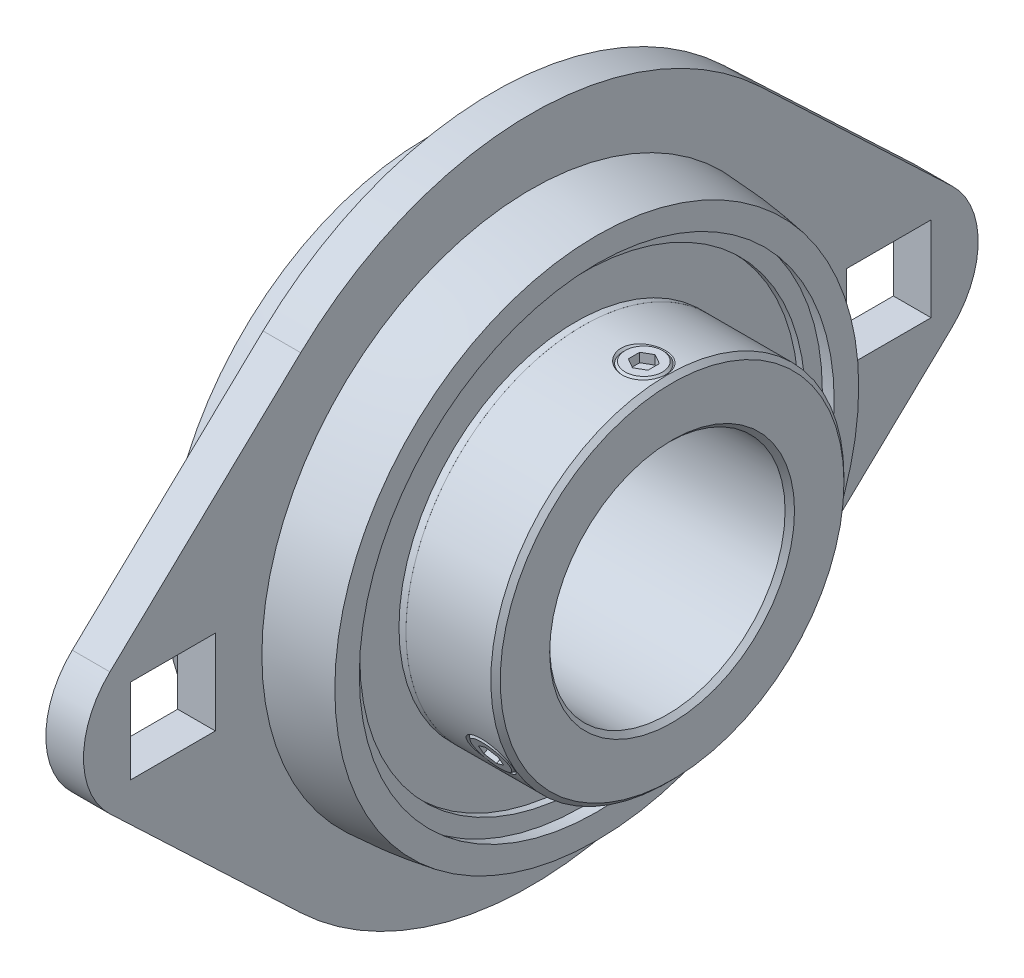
ISO-10303-21;
HEADER;
FILE_DESCRIPTION(('STEP AP214'),'2;1');
FILE_NAME('part.step','',(''),(''),'','','');
FILE_SCHEMA(('AUTOMOTIVE_DESIGN { 1 0 10303 214 1 1 1 1 }'));
ENDSEC;
DATA;
#1=APPLICATION_CONTEXT('core data for automotive mechanical design processes');
#2=APPLICATION_PROTOCOL_DEFINITION('international standard','automotive_design',2000,#1);
#3=PRODUCT_CONTEXT('',#1,'mechanical');
#4=PRODUCT('Part','Part','',(#3));
#5=PRODUCT_RELATED_PRODUCT_CATEGORY('part','',(#4));
#6=PRODUCT_DEFINITION_FORMATION('','',#4);
#7=PRODUCT_DEFINITION_CONTEXT('part definition',#1,'design');
#8=PRODUCT_DEFINITION('design','',#6,#7);
#9=PRODUCT_DEFINITION_SHAPE('','',#8);
#10=(LENGTH_UNIT() NAMED_UNIT(*) SI_UNIT(.MILLI.,.METRE.));
#11=(NAMED_UNIT(*) PLANE_ANGLE_UNIT() SI_UNIT($,.RADIAN.));
#12=(NAMED_UNIT(*) SI_UNIT($,.STERADIAN.) SOLID_ANGLE_UNIT());
#13=UNCERTAINTY_MEASURE_WITH_UNIT(LENGTH_MEASURE(1.E-05),#10,'distance_accuracy_value','');
#14=(GEOMETRIC_REPRESENTATION_CONTEXT(3) GLOBAL_UNCERTAINTY_ASSIGNED_CONTEXT((#13)) GLOBAL_UNIT_ASSIGNED_CONTEXT((#10,
#11,#12)) REPRESENTATION_CONTEXT('',''));
#15=CARTESIAN_POINT('',(0.,0.,0.));
#16=DIRECTION('',(0.,0.,1.));
#17=DIRECTION('',(1.,0.,0.));
#18=AXIS2_PLACEMENT_3D('',#15,#16,#17);
#19=CARTESIAN_POINT('',(6.,0.,0.));
#20=DIRECTION('',(1.,0.,0.));
#21=DIRECTION('',(0.,1.,0.));
#22=AXIS2_PLACEMENT_3D('',#19,#20,#21);
#23=CYLINDRICAL_SURFACE('',#22,12.5);
#24=CARTESIAN_POINT('',(16.5,0.,0.));
#25=DIRECTION('',(1.,0.,0.));
#26=DIRECTION('',(0.,0.,-1.));
#27=AXIS2_PLACEMENT_3D('',#24,#25,#26);
#28=CIRCLE('',#27,12.5);
#29=CARTESIAN_POINT('',(16.5,0.,-12.5));
#30=VERTEX_POINT('',#29);
#31=EDGE_CURVE('E65',#30,#30,#28,.T.);
#32=ORIENTED_EDGE('',*,*,#31,.T.);
#33=EDGE_LOOP('',(#32));
#34=FACE_BOUND('',#33,.T.);
#35=CARTESIAN_POINT('',(-7.,0.,0.));
#36=DIRECTION('',(-1.,0.,0.));
#37=DIRECTION('',(0.,1.,0.));
#38=AXIS2_PLACEMENT_3D('',#35,#36,#37);
#39=CIRCLE('',#38,12.5);
#40=CARTESIAN_POINT('',(-7.,12.5,0.));
#41=VERTEX_POINT('',#40);
#42=EDGE_CURVE('E583',#41,#41,#39,.T.);
#43=ORIENTED_EDGE('',*,*,#42,.T.);
#44=EDGE_LOOP('',(#43));
#45=FACE_BOUND('',#44,.T.);
#46=CARTESIAN_POINT('',(14.,12.3421878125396,1.98));
#47=CARTESIAN_POINT('',(14.030779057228,12.3421885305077,1.9799938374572));
#48=CARTESIAN_POINT('',(14.0615592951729,12.3423009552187,1.97929466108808));
#49=CARTESIAN_POINT('',(14.1228438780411,12.3427494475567,1.97649686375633));
#50=CARTESIAN_POINT('',(14.1533486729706,12.3430839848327,1.97440781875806));
#51=CARTESIAN_POINT('',(14.2140827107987,12.3439748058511,1.96883047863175));
#52=CARTESIAN_POINT('',(14.2443125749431,12.3445300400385,1.9653488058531));
#53=CARTESIAN_POINT('',(14.3044964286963,12.3458580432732,1.9569893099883));
#54=CARTESIAN_POINT('',(14.3344509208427,12.3466302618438,1.95211501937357));
#55=CARTESIAN_POINT('',(14.3940842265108,12.3483868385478,1.94097249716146));
#56=CARTESIAN_POINT('',(14.4237631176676,12.3493711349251,1.93470467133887));
#57=CARTESIAN_POINT('',(14.482845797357,12.3515450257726,1.92077724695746));
#58=CARTESIAN_POINT('',(14.5122489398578,12.3527350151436,1.91311496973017));
#59=CARTESIAN_POINT('',(14.5707804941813,12.3553120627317,1.89640069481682));
#60=CARTESIAN_POINT('',(14.5999072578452,12.3566999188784,1.8873430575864));
#61=CARTESIAN_POINT('',(14.6578886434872,12.3596632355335,1.86783901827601));
#62=CARTESIAN_POINT('',(14.6867403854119,12.3612398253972,1.85738420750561));
#63=CARTESIAN_POINT('',(14.7297176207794,12.3637315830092,1.84069909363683));
#64=CARTESIAN_POINT('',(14.7440361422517,12.3645860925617,1.83495132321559));
#65=CARTESIAN_POINT('',(14.7795799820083,12.3667655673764,1.8202167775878));
#66=CARTESIAN_POINT('',(14.8007226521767,12.3681143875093,1.81103272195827));
#67=CARTESIAN_POINT('',(14.8425677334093,12.3708865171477,1.79199853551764));
#68=CARTESIAN_POINT('',(14.8632718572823,12.372309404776,1.78215209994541));
#69=CARTESIAN_POINT('',(14.9110414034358,12.3757088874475,1.75841311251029));
#70=CARTESIAN_POINT('',(14.9379714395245,12.3777143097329,1.74425090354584));
#71=CARTESIAN_POINT('',(14.9910496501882,12.3818368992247,1.714740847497));
#72=CARTESIAN_POINT('',(15.0172000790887,12.3839536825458,1.69939699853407));
#73=CARTESIAN_POINT('',(15.0687210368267,12.3882856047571,1.66752454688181));
#74=CARTESIAN_POINT('',(15.094092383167,12.3905006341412,1.65099725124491));
#75=CARTESIAN_POINT('',(15.144056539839,12.3950146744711,1.61675899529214));
#76=CARTESIAN_POINT('',(15.1686484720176,12.3973137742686,1.59904676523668));
#77=CARTESIAN_POINT('',(15.217055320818,12.4019806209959,1.56243983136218));
#78=CARTESIAN_POINT('',(15.2408674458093,12.4043485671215,1.54354146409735));
#79=CARTESIAN_POINT('',(15.2877176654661,12.4091369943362,1.50456193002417));
#80=CARTESIAN_POINT('',(15.3107508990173,12.4115576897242,1.48447493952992));
#81=CARTESIAN_POINT('',(15.3446535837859,12.4152079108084,1.45352031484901));
#82=CARTESIAN_POINT('',(15.3558757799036,12.4164311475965,1.44303557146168));
#83=CARTESIAN_POINT('',(15.3781268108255,12.4188842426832,1.4217697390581));
#84=CARTESIAN_POINT('',(15.3891546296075,12.4201141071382,1.41098758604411));
#85=CARTESIAN_POINT('',(15.4109465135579,12.4225702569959,1.38919697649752));
#86=CARTESIAN_POINT('',(15.4217110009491,12.4237965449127,1.378188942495));
#87=CARTESIAN_POINT('',(15.4429447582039,12.4262405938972,1.35597531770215));
#88=CARTESIAN_POINT('',(15.4534150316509,12.4274583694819,1.34477068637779));
#89=CARTESIAN_POINT('',(15.4843345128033,12.4310908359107,1.31091349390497));
#90=CARTESIAN_POINT('',(15.5044015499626,12.433496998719,1.28790854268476));
#91=CARTESIAN_POINT('',(15.5433523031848,12.4382557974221,1.24110566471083));
#92=CARTESIAN_POINT('',(15.5622413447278,12.4406086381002,1.21731218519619));
#93=CARTESIAN_POINT('',(15.598839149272,12.4452474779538,1.16893285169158));
#94=CARTESIAN_POINT('',(15.6165510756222,12.4475336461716,1.14434940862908));
#95=CARTESIAN_POINT('',(15.6507966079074,12.4520253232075,1.09439200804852));
#96=CARTESIAN_POINT('',(15.6673309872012,12.4542308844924,1.06901858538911));
#97=CARTESIAN_POINT('',(15.6992238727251,12.4585471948,1.01748288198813));
#98=CARTESIAN_POINT('',(15.7145805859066,12.4606577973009,0.99131947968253));
#99=CARTESIAN_POINT('',(15.7441209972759,12.4647697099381,0.93820470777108));
#100=CARTESIAN_POINT('',(15.7583002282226,12.4667705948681,0.911250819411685));
#101=CARTESIAN_POINT('',(15.7820707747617,12.4701607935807,0.86343174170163));
#102=CARTESIAN_POINT('',(15.7919318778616,12.4715793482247,0.842702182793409));
#103=CARTESIAN_POINT('',(15.8109961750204,12.4743400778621,0.800801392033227));
#104=CARTESIAN_POINT('',(15.8201954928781,12.4756817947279,0.779628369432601));
#105=CARTESIAN_POINT('',(15.8437592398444,12.4791359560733,0.722793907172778));
#106=CARTESIAN_POINT('',(15.8574896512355,12.4811675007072,0.686862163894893));
#107=CARTESIAN_POINT('',(15.8827516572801,12.4849358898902,0.614553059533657));
#108=CARTESIAN_POINT('',(15.8943005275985,12.4866750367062,0.578181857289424));
#109=CARTESIAN_POINT('',(15.9131238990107,12.4895320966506,0.512291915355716));
#110=CARTESIAN_POINT('',(15.9207898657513,12.4907043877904,0.482886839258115));
#111=CARTESIAN_POINT('',(15.9347244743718,12.4928486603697,0.423797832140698));
#112=CARTESIAN_POINT('',(15.9409957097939,12.4938210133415,0.39411452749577));
#113=CARTESIAN_POINT('',(15.9521435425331,12.4955599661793,0.334471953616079));
#114=CARTESIAN_POINT('',(15.9570197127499,12.4963265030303,0.30451260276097));
#115=CARTESIAN_POINT('',(15.9653805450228,12.4976484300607,0.244319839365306));
#116=CARTESIAN_POINT('',(15.9688617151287,12.4982032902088,0.21408593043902));
#117=CARTESIAN_POINT('',(15.9744355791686,12.4990964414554,0.153345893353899));
#118=CARTESIAN_POINT('',(15.9765217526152,12.499433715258,0.122839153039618));
#119=CARTESIAN_POINT('',(15.9793087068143,12.4998862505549,0.0615552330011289));
#120=CARTESIAN_POINT('',(15.9800000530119,12.5000000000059,0.0307776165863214));
#121=CARTESIAN_POINT('',(15.9799999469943,12.4999999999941,-0.0307740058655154));
#122=CARTESIAN_POINT('',(15.9793086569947,12.4998862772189,-0.0615480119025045));
#123=CARTESIAN_POINT('',(15.976521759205,12.4994338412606,-0.122825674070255));
#124=CARTESIAN_POINT('',(15.974435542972,12.4990966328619,-0.153329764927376));
#125=CARTESIAN_POINT('',(15.9688616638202,12.498203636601,-0.214065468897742));
#126=CARTESIAN_POINT('',(15.9653804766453,12.4976488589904,-0.244297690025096));
#127=CARTESIAN_POINT('',(15.9570196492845,12.4963270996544,-0.304488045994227));
#128=CARTESIAN_POINT('',(15.952143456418,12.4955606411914,-0.334446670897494));
#129=CARTESIAN_POINT('',(15.9409956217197,12.4938218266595,-0.394088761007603));
#130=CARTESIAN_POINT('',(15.9347243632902,12.4928495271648,-0.42377229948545));
#131=CARTESIAN_POINT('',(15.9207897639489,12.4907053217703,-0.482862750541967));
#132=CARTESIAN_POINT('',(15.9131237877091,12.4895330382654,-0.512269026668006));
#133=CARTESIAN_POINT('',(15.8943003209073,12.4866759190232,-0.578162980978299));
#134=CARTESIAN_POINT('',(15.882751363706,12.4849366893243,-0.614536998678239));
#135=CARTESIAN_POINT('',(15.8574895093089,12.4811679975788,-0.686853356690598));
#136=CARTESIAN_POINT('',(15.8437592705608,12.4791362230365,-0.722789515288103));
#137=CARTESIAN_POINT('',(15.8201984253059,12.4756820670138,-0.779623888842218));
#138=CARTESIAN_POINT('',(15.8110022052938,12.4743406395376,-0.800792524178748));
#139=CARTESIAN_POINT('',(15.7919434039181,12.4715804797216,-0.84268535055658));
#140=CARTESIAN_POINT('',(15.7820846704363,12.4701622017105,-0.863411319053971));
#141=CARTESIAN_POINT('',(15.7583188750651,12.4667725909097,-0.911223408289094));
#142=CARTESIAN_POINT('',(15.7441419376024,12.4647720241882,-0.938173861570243));
#143=CARTESIAN_POINT('',(15.7146051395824,12.4606606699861,-0.991283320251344));
#144=CARTESIAN_POINT('',(15.699249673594,12.4585503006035,-1.01744480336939));
#145=CARTESIAN_POINT('',(15.6673583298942,12.4542343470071,-1.06897823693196));
#146=CARTESIAN_POINT('',(15.6508241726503,12.4520289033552,-1.09435126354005));
#147=CARTESIAN_POINT('',(15.6165781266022,12.4475373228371,-1.14430944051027));
#148=CARTESIAN_POINT('',(15.5988653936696,12.4452511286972,-1.16889400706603));
#149=CARTESIAN_POINT('',(15.5622650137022,12.4406120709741,-1.21727715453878));
#150=CARTESIAN_POINT('',(15.5433741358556,12.438259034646,-1.2410732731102));
#151=CARTESIAN_POINT('',(15.5044187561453,12.4334996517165,-1.28788300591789));
#152=CARTESIAN_POINT('',(15.4843488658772,12.4310930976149,-1.31089212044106));
#153=CARTESIAN_POINT('',(15.4534247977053,12.4274599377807,-1.34475621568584));
#154=CARTESIAN_POINT('',(15.4429527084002,12.4262418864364,-1.35596349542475));
#155=CARTESIAN_POINT('',(15.4217151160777,12.4237972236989,-1.3781828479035));
#156=CARTESIAN_POINT('',(15.4109486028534,12.4225705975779,-1.38919395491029));
#157=CARTESIAN_POINT('',(15.3891576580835,12.4201143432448,-1.41098549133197));
#158=CARTESIAN_POINT('',(15.3781329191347,12.4188847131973,-1.42176561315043));
#159=CARTESIAN_POINT('',(15.3558876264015,12.4164320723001,-1.44302760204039));
#160=CARTESIAN_POINT('',(15.3446680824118,12.4152090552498,-1.45351052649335));
#161=CARTESIAN_POINT('',(15.3107723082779,12.4115594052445,-1.48446055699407));
#162=CARTESIAN_POINT('',(15.2877432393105,12.4091390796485,-1.50454469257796));
#163=CARTESIAN_POINT('',(15.2408998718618,12.4043512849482,-1.5435196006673));
#164=CARTESIAN_POINT('',(15.2170903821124,12.4019836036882,-1.56241613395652));
#165=CARTESIAN_POINT('',(15.1686873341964,12.397317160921,-1.5990204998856));
#166=CARTESIAN_POINT('',(15.1440965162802,12.3950182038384,-1.6167319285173));
#167=CARTESIAN_POINT('',(15.0941331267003,12.3905043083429,-1.65096967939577));
#168=CARTESIAN_POINT('',(15.0687613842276,12.38828928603,-1.66749720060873));
#169=CARTESIAN_POINT('',(15.0172381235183,12.3839572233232,-1.69937120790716));
#170=CARTESIAN_POINT('',(14.9910857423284,12.3818402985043,-1.71471631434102));
#171=CARTESIAN_POINT('',(14.9380022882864,12.3777172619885,-1.74422997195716));
#172=CARTESIAN_POINT('',(14.9110689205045,12.3757115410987,-1.75839445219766));
#173=CARTESIAN_POINT('',(14.8632921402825,12.3723114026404,-1.7821382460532));
#174=CARTESIAN_POINT('',(14.8425841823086,12.3708881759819,-1.79198710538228));
#175=CARTESIAN_POINT('',(14.8007318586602,12.3681152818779,-1.81102662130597));
#176=CARTESIAN_POINT('',(14.7795857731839,12.3667660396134,-1.82021355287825));
#177=CARTESIAN_POINT('',(14.7227744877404,12.3632821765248,-1.84376662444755));
#178=CARTESIAN_POINT('',(14.6868385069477,12.3612244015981,-1.85749713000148));
#179=CARTESIAN_POINT('',(14.6145263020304,12.3574024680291,-1.88275495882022));
#180=CARTESIAN_POINT('',(14.5781563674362,12.3556359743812,-1.89429992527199));
#181=CARTESIAN_POINT('',(14.512271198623,12.3527349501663,-1.91311534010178));
#182=CARTESIAN_POINT('',(14.4828697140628,12.3515449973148,-1.92077741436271));
#183=CARTESIAN_POINT('',(14.4237888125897,12.3493711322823,-1.93470470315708));
#184=CARTESIAN_POINT('',(14.3941100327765,12.3483868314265,-1.94097255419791));
#185=CARTESIAN_POINT('',(14.3344761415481,12.3466302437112,-1.95211512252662));
#186=CARTESIAN_POINT('',(14.3045209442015,12.3458580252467,-1.95698939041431));
#187=CARTESIAN_POINT('',(14.2443347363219,12.3445300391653,-1.96534884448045));
#188=CARTESIAN_POINT('',(14.2141032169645,12.343974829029,-1.96883045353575));
#189=CARTESIAN_POINT('',(14.1533647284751,12.3430839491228,-1.97440792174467));
#190=CARTESIAN_POINT('',(14.122857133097,12.3427493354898,-1.97649711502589));
#191=CARTESIAN_POINT('',(14.0615667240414,12.3423010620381,-1.97929444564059));
#192=CARTESIAN_POINT('',(14.0307834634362,12.3421889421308,-1.97999295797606));
#193=CARTESIAN_POINT('',(13.9692552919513,12.3421866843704,-1.98000703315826));
#194=CARTESIAN_POINT('',(13.938510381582,12.3422962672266,-1.97932433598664));
#195=CARTESIAN_POINT('',(13.8772864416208,12.3427403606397,-1.97655314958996));
#196=CARTESIAN_POINT('',(13.8468069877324,12.3430733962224,-1.9744738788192));
#197=CARTESIAN_POINT('',(13.7861145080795,12.3439615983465,-1.96891339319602));
#198=CARTESIAN_POINT('',(13.7559009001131,12.3445157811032,-1.96543838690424));
#199=CARTESIAN_POINT('',(13.6957402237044,12.3458422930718,-1.95708862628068));
#200=CARTESIAN_POINT('',(13.6657927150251,12.3466141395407,-1.95221696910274));
#201=CARTESIAN_POINT('',(13.6061638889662,12.3483705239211,-1.9410762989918));
#202=CARTESIAN_POINT('',(13.5764825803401,12.3493550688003,-1.93480724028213));
#203=CARTESIAN_POINT('',(13.5173862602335,12.3515299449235,-1.92087422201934));
#204=CARTESIAN_POINT('',(13.4879720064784,12.3527207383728,-1.91320712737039));
#205=CARTESIAN_POINT('',(13.4220435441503,12.3556243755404,-1.89437563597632));
#206=CARTESIAN_POINT('',(13.3856434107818,12.3573927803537,-1.88281861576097));
#207=CARTESIAN_POINT('',(13.3132541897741,12.3612191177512,-1.8575324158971));
#208=CARTESIAN_POINT('',(13.2772717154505,12.3632795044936,-1.84378468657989));
#209=CARTESIAN_POINT('',(13.2204188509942,12.3667656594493,-1.82021612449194));
#210=CARTESIAN_POINT('',(13.1992770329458,12.3681144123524,-1.81103254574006));
#211=CARTESIAN_POINT('',(13.1574325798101,12.3708864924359,-1.79199871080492));
#212=CARTESIAN_POINT('',(13.1367282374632,12.3723093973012,-1.78215215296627));
#213=CARTESIAN_POINT('',(13.0889584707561,12.3757088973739,-1.75841304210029));
#214=CARTESIAN_POINT('',(13.0620285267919,12.3777143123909,-1.74425088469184));
#215=CARTESIAN_POINT('',(13.0089503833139,12.381836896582,-1.71474086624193));
#216=CARTESIAN_POINT('',(12.9827999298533,12.3839536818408,-1.69939700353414));
#217=CARTESIAN_POINT('',(12.9312789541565,12.388285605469,-1.66752454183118));
#218=CARTESIAN_POINT('',(12.9059076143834,12.3905006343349,-1.65099724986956));
#219=CARTESIAN_POINT('',(12.8559434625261,12.3950146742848,-1.61675899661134));
#220=CARTESIAN_POINT('',(12.8313515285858,12.3973137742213,-1.59904676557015));
#221=CARTESIAN_POINT('',(12.7829446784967,12.4019806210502,-1.56243983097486));
#222=CARTESIAN_POINT('',(12.7591325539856,12.4043485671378,-1.54354146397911));
#223=CARTESIAN_POINT('',(12.7122823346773,12.4091369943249,-1.50456193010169));
#224=CARTESIAN_POINT('',(12.689249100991,12.4115576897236,-1.48447493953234));
#225=CARTESIAN_POINT('',(12.6553464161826,12.4152079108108,-1.45352031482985));
#226=CARTESIAN_POINT('',(12.6441242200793,12.4164311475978,-1.4430355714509));
#227=CARTESIAN_POINT('',(12.6218731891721,12.4188842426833,-1.42176973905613));
#228=CARTESIAN_POINT('',(12.6108453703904,12.4201141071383,-1.41098758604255));
#229=CARTESIAN_POINT('',(12.5890534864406,12.4225702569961,-1.38919697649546));
#230=CARTESIAN_POINT('',(12.57828899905,12.423796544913,-1.37818894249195));
#231=CARTESIAN_POINT('',(12.5570552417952,12.4262405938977,-1.35597531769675));
#232=CARTESIAN_POINT('',(12.5465849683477,12.4274583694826,-1.34477068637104));
#233=CARTESIAN_POINT('',(12.5156654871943,12.4310908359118,-1.31091349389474));
#234=CARTESIAN_POINT('',(12.4955984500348,12.4334969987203,-1.28790854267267));
#235=CARTESIAN_POINT('',(12.456647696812,12.4382557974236,-1.24110566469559));
#236=CARTESIAN_POINT('',(12.4377586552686,12.4406086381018,-1.21731218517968));
#237=CARTESIAN_POINT('',(12.401160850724,12.4452474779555,-1.16893285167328));
#238=CARTESIAN_POINT('',(12.3834489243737,12.4475336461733,-1.14434940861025));
#239=CARTESIAN_POINT('',(12.3492033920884,12.4520253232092,-1.09439200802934));
#240=CARTESIAN_POINT('',(12.3326690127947,12.454230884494,-1.06901858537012));
#241=CARTESIAN_POINT('',(12.300776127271,12.4585471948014,-1.01748288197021));
#242=CARTESIAN_POINT('',(12.2854194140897,12.4606577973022,-0.991319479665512));
#243=CARTESIAN_POINT('',(12.255879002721,12.4647697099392,-0.938204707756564));
#244=CARTESIAN_POINT('',(12.2416997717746,12.466770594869,-0.911250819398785));
#245=CARTESIAN_POINT('',(12.2179292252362,12.4701607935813,-0.863431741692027));
#246=CARTESIAN_POINT('',(12.2080681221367,12.4715793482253,-0.842702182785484));
#247=CARTESIAN_POINT('',(12.1890038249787,12.4743400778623,-0.800801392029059));
#248=CARTESIAN_POINT('',(12.1798045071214,12.475681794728,-0.779628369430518));
#249=CARTESIAN_POINT('',(12.1562407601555,12.4791359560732,-0.722793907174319));
#250=CARTESIAN_POINT('',(12.1425103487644,12.481167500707,-0.686862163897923));
#251=CARTESIAN_POINT('',(12.1172483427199,12.4849358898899,-0.614553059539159));
#252=CARTESIAN_POINT('',(12.1056994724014,12.4866750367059,-0.578181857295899));
#253=CARTESIAN_POINT('',(12.0868761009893,12.4895320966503,-0.512291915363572));
#254=CARTESIAN_POINT('',(12.0792101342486,12.4907043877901,-0.482886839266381));
#255=CARTESIAN_POINT('',(12.0652755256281,12.4928486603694,-0.423797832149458));
#256=CARTESIAN_POINT('',(12.059004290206,12.4938210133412,-0.39411452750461));
#257=CARTESIAN_POINT('',(12.0478564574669,12.4955599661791,-0.334471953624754));
#258=CARTESIAN_POINT('',(12.0429802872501,12.4963265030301,-0.304512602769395));
#259=CARTESIAN_POINT('',(12.0346194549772,12.4976484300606,-0.244319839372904));
#260=CARTESIAN_POINT('',(12.0311382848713,12.4982032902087,-0.214085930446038));
#261=CARTESIAN_POINT('',(12.0255644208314,12.4990964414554,-0.15334589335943));
#262=CARTESIAN_POINT('',(12.0234782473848,12.499433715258,-0.122839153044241));
#263=CARTESIAN_POINT('',(12.0206912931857,12.4998862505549,-0.0615552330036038));
#264=CARTESIAN_POINT('',(12.0199999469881,12.5000000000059,-0.0307776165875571));
#265=CARTESIAN_POINT('',(12.0200000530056,12.4999999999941,0.0307740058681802));
#266=CARTESIAN_POINT('',(12.0206913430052,12.4998862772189,0.0615480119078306));
#267=CARTESIAN_POINT('',(12.023478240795,12.4994338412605,0.122825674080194));
#268=CARTESIAN_POINT('',(12.0255644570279,12.4990966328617,0.153329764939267));
#269=CARTESIAN_POINT('',(12.0311383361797,12.4982036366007,0.214065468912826));
#270=CARTESIAN_POINT('',(12.0346195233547,12.4976488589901,0.244297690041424));
#271=CARTESIAN_POINT('',(12.0429803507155,12.4963270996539,0.30448804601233));
#272=CARTESIAN_POINT('',(12.047856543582,12.4955606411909,0.334446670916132));
#273=CARTESIAN_POINT('',(12.0590043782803,12.4938218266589,0.394088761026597));
#274=CARTESIAN_POINT('',(12.0652756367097,12.4928495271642,0.423772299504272));
#275=CARTESIAN_POINT('',(12.079210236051,12.4907053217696,0.482862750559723));
#276=CARTESIAN_POINT('',(12.0868762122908,12.4895330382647,0.512269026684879));
#277=CARTESIAN_POINT('',(12.1056996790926,12.4866759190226,0.578162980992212));
#278=CARTESIAN_POINT('',(12.1172486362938,12.4849366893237,0.614536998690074));
#279=CARTESIAN_POINT('',(12.142510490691,12.4811679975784,0.686853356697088));
#280=CARTESIAN_POINT('',(12.1562407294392,12.4791362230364,0.722789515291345));
#281=CARTESIAN_POINT('',(12.179801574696,12.4756820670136,0.779623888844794));
#282=CARTESIAN_POINT('',(12.1889977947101,12.4743406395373,0.800792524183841));
#283=CARTESIAN_POINT('',(12.2080565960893,12.4715804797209,0.842685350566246));
#284=CARTESIAN_POINT('',(12.2179153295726,12.4701622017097,0.863411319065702));
#285=CARTESIAN_POINT('',(12.2416811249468,12.4667725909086,0.911223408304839));
#286=CARTESIAN_POINT('',(12.2558580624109,12.4647720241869,0.93817386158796));
#287=CARTESIAN_POINT('',(12.2853948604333,12.4606606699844,0.991283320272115));
#288=CARTESIAN_POINT('',(12.3007503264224,12.4585503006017,1.01744480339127));
#289=CARTESIAN_POINT('',(12.3326416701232,12.4542343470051,1.06897823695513));
#290=CARTESIAN_POINT('',(12.3491758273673,12.4520289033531,1.09435126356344));
#291=CARTESIAN_POINT('',(12.3834218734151,12.447537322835,1.14430944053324));
#292=CARTESIAN_POINT('',(12.4011346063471,12.445251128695,1.16889400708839));
#293=CARTESIAN_POINT('',(12.437734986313,12.4406120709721,1.21727715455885));
#294=CARTESIAN_POINT('',(12.4566258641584,12.4382590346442,1.24107327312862));
#295=CARTESIAN_POINT('',(12.4955812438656,12.433499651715,1.28788300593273));
#296=CARTESIAN_POINT('',(12.5156511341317,12.4310930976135,1.310892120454));
#297=CARTESIAN_POINT('',(12.5465752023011,12.4274599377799,1.34475621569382));
#298=CARTESIAN_POINT('',(12.5570472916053,12.4262418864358,1.35596349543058));
#299=CARTESIAN_POINT('',(12.5782848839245,12.4237972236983,1.37818284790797));
#300=CARTESIAN_POINT('',(12.5890513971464,12.4225705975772,1.38919395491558));
#301=CARTESIAN_POINT('',(12.6108423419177,12.4201143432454,1.41098549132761));
#302=CARTESIAN_POINT('',(12.6218670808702,12.4188847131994,1.42176561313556));
#303=CARTESIAN_POINT('',(12.6441123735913,12.4164320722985,1.44302760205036));
#304=CARTESIAN_POINT('',(12.6553319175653,12.415209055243,1.45351052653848));
#305=CARTESIAN_POINT('',(12.6892276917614,12.4115594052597,1.48446055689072));
#306=CARTESIAN_POINT('',(12.7122567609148,12.4091390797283,1.50454469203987));
#307=CARTESIAN_POINT('',(12.7591001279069,12.4043512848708,1.54351960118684));
#308=CARTESIAN_POINT('',(12.7829096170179,12.4019836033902,1.5624161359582));
#309=CARTESIAN_POINT('',(12.8313126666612,12.3973171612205,1.59902049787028));
#310=CARTESIAN_POINT('',(12.8559034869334,12.3950182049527,1.61673192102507));
#311=CARTESIAN_POINT('',(12.9058668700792,12.3905043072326,1.6509696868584));
#312=CARTESIAN_POINT('',(12.9312386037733,12.3882892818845,1.66749722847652));
#313=CARTESIAN_POINT('',(12.9827618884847,12.3839572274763,1.699371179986));
#314=CARTESIAN_POINT('',(13.008914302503,12.3818403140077,1.71471621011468));
#315=CARTESIAN_POINT('',(13.061997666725,12.3777172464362,1.74423007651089));
#316=CARTESIAN_POINT('',(13.0889309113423,12.3757114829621,1.75839484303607));
#317=CARTESIAN_POINT('',(13.1367079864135,12.3723114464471,1.7821379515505));
#318=CARTESIAN_POINT('',(13.157416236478,12.3708883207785,1.79198613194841));
#319=CARTESIAN_POINT('',(13.1992677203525,12.3681151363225,1.81102759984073));
#320=CARTESIAN_POINT('',(13.2204126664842,12.3667655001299,1.8202171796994));
#321=CARTESIAN_POINT('',(13.2774840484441,12.3632673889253,1.84386663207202));
#322=CARTESIAN_POINT('',(13.3136922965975,12.3611991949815,1.85766508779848));
#323=CARTESIAN_POINT('',(13.3867643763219,12.357355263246,1.88306552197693));
#324=CARTESIAN_POINT('',(13.4236259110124,12.3555786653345,1.89467397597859));
#325=CARTESIAN_POINT('',(13.4868273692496,12.3528212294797,1.91255402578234));
#326=CARTESIAN_POINT('',(13.5130078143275,12.3517615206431,1.91938213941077));
#327=CARTESIAN_POINT('',(13.5656864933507,12.3497982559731,1.93197406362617));
#328=CARTESIAN_POINT('',(13.5921852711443,12.3488950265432,1.93773565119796));
#329=CARTESIAN_POINT('',(13.6520754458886,12.3470458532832,1.94948776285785));
#330=CARTESIAN_POINT('',(13.6855285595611,12.3461460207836,1.95517322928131));
#331=CARTESIAN_POINT('',(13.7525783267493,12.3446177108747,1.9647995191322));
#332=CARTESIAN_POINT('',(13.7861741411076,12.3439883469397,1.96874604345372));
#333=CARTESIAN_POINT('',(13.8497663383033,12.3430600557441,1.97455729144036));
#334=CARTESIAN_POINT('',(13.8797456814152,12.3427320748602,1.97660528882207));
#335=CARTESIAN_POINT('',(13.9398165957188,12.3422948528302,1.9793327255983));
#336=CARTESIAN_POINT('',(13.9699082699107,12.3421859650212,1.98000995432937));
#337=CARTESIAN_POINT('',(14.,12.3421878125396,1.98));
#338=B_SPLINE_CURVE_WITH_KNOTS('',3,(#46,#47,#48,#49,#50,#51,#52,#53,#54,#55,#56,#57,#58,#59,
#60,#61,#62,#63,#64,#65,#66,#67,#68,#69,#70,#71,#72,#73,#74,#75,#76,#77,#78,#79,#80,#81,#82,#83,
#84,#85,#86,#87,#88,#89,#90,#91,#92,#93,#94,#95,#96,#97,#98,#99,#100,#101,#102,#103,#104,#105,
#106,#107,#108,#109,#110,#111,#112,#113,#114,#115,#116,#117,#118,#119,#120,#121,#122,#123,#124,
#125,#126,#127,#128,#129,#130,#131,#132,#133,#134,#135,#136,#137,#138,#139,#140,#141,#142,#143,
#144,#145,#146,#147,#148,#149,#150,#151,#152,#153,#154,#155,#156,#157,#158,#159,#160,#161,#162,
#163,#164,#165,#166,#167,#168,#169,#170,#171,#172,#173,#174,#175,#176,#177,#178,#179,#180,#181,
#182,#183,#184,#185,#186,#187,#188,#189,#190,#191,#192,#193,#194,#195,#196,#197,#198,#199,#200,
#201,#202,#203,#204,#205,#206,#207,#208,#209,#210,#211,#212,#213,#214,#215,#216,#217,#218,#219,
#220,#221,#222,#223,#224,#225,#226,#227,#228,#229,#230,#231,#232,#233,#234,#235,#236,#237,#238,
#239,#240,#241,#242,#243,#244,#245,#246,#247,#248,#249,#250,#251,#252,#253,#254,#255,#256,#257,
#258,#259,#260,#261,#262,#263,#264,#265,#266,#267,#268,#269,#270,#271,#272,#273,#274,#275,#276,
#277,#278,#279,#280,#281,#282,#283,#284,#285,#286,#287,#288,#289,#290,#291,#292,#293,#294,#295,
#296,#297,#298,#299,#300,#301,#302,#303,#304,#305,#306,#307,#308,#309,#310,#311,#312,#313,#314,
#315,#316,#317,#318,#319,#320,#321,#322,#323,#324,#325,#326,#327,#328,#329,#330,#331,#332,#333,
#334,#335,#336,#337),.UNSPECIFIED.,.F.,.F.,(4,2,2,2,2,2,2,2,2,2,2,2,2,2,2,2,2,2,2,2,2,2,2,2,2,2,
2,2,2,2,2,2,2,2,2,2,2,2,2,2,2,2,2,2,2,2,2,2,2,2,2,2,2,2,2,2,2,2,2,2,2,2,2,2,2,2,2,2,2,2,2,2,2,2,
2,2,2,2,2,2,2,2,2,2,2,2,2,2,2,2,2,2,2,2,2,2,2,2,2,2,2,2,2,2,2,2,2,2,2,2,2,2,2,2,2,2,2,2,2,2,2,2,
2,2,2,2,2,2,2,2,2,2,2,2,2,2,2,2,2,2,2,2,2,2,2,4),(0.,0.0923311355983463,0.184032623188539,
0.275303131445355,0.36634415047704,0.45735869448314,0.548549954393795,0.640119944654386,
0.732268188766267,0.778623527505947,0.847880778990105,0.916779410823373,1.00822381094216,
1.09937135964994,1.19041974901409,1.28156731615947,1.37301175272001,1.46494883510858,
1.51116545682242,1.55757714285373,1.60390875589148,1.65005616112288,1.74188692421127,
1.83326687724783,1.92439040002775,2.01545351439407,2.10665263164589,2.19818328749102,
2.26716797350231,2.3365284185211,2.45201991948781,2.56655451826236,2.65775360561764,
2.74878166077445,2.83983755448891,2.93111997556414,3.02282614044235,3.11515055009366,
3.20746412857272,3.29916236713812,3.39043976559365,3.48149352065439,3.57252228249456,
3.66372486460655,3.77826763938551,3.89377137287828,3.96311601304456,4.03208788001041,
4.12360616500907,4.21479838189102,4.30586011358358,4.39698778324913,4.4883773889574,
4.58022325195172,4.62638022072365,4.67272272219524,4.71912351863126,4.76533057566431,
4.85725255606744,4.94868733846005,5.03983075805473,5.13088053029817,5.22203498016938,
5.31349175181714,5.38240320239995,5.45167625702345,5.5671838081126,5.68171492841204,
5.77290269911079,5.86391653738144,5.9549596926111,6.0462352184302,6.13794462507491,
6.23028658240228,6.3225122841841,6.41413513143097,6.50535485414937,6.59637383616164,
6.6873958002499,6.77862444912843,6.89325306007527,7.00890961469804,7.07816686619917,
7.14706549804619,7.23850989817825,7.32965744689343,7.42070583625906,7.5118534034,
7.60329783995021,7.69523492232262,7.74145154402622,7.78786323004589,7.83419484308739,
7.88034224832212,7.97217301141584,8.06355296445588,8.15467648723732,8.24573960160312,
8.33693871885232,8.42846937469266,8.49745406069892,8.56681450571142,8.68230600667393,
8.79684060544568,8.88803969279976,8.97906774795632,9.07012364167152,9.16140606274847,
9.2531122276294,9.34543663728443,9.43775021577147,9.52944845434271,9.62072585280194,
9.71177960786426,9.80280836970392,9.89401095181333,10.0085537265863,10.12405746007,
10.1934021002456,10.262373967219,10.353892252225,10.445084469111,10.5361462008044,
10.6272738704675,10.71866347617,10.8105093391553,10.8566663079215,10.9030088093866,
10.94940960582,10.9956166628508,11.0875386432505,11.1789734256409,11.2701168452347,
11.3611666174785,11.4523210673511,11.5437778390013,11.6126892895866,11.6819623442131,
11.7983022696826,11.9142926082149,11.9955016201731,12.0768780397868,12.1786657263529,
12.280117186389,12.3702384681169,12.4605049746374),.UNSPECIFIED.);
#339=CARTESIAN_POINT('',(14.,12.3421878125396,1.98));
#340=VERTEX_POINT('',#339);
#341=EDGE_CURVE('E587',#340,#340,#338,.T.);
#342=ORIENTED_EDGE('',*,*,#341,.T.);
#343=EDGE_LOOP('',(#342));
#344=FACE_BOUND('',#343,.T.);
#345=CARTESIAN_POINT('',(14.,-7.88582420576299,9.69864818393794));
#346=CARTESIAN_POINT('',(14.0307790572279,-7.88581922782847,9.69865188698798));
#347=CARTESIAN_POINT('',(14.0615592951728,-7.8852699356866,9.69909883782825));
#348=CARTESIAN_POINT('',(14.122843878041,-7.88307121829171,9.70088614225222));
#349=CARTESIAN_POINT('',(14.1533486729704,-7.88142932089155,9.70222038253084));
#350=CARTESIAN_POINT('',(14.2140827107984,-7.87704461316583,9.70578052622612));
#351=CARTESIAN_POINT('',(14.2443125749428,-7.87430701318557,9.70800220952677));
#352=CARTESIAN_POINT('',(14.304496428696,-7.8677314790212,9.71333204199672));
#353=CARTESIAN_POINT('',(14.3344509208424,-7.86389632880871,9.71643794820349));
#354=CARTESIAN_POINT('',(14.3940842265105,-7.85512490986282,9.72353044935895));
#355=CARTESIAN_POINT('',(14.4237631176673,-7.85018896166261,9.72751678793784));
#356=CARTESIAN_POINT('',(14.4828457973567,-7.83921440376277,9.73636314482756));
#357=CARTESIAN_POINT('',(14.5122489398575,-7.83317367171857,9.74122484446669));
#358=CARTESIAN_POINT('',(14.570780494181,-7.81998720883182,9.75181377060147));
#359=CARTESIAN_POINT('',(14.599907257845,-7.81283699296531,9.75754450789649));
#360=CARTESIAN_POINT('',(14.657888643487,-7.79742765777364,9.76986283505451));
#361=CARTESIAN_POINT('',(14.6867403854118,-7.78916182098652,9.776455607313));
#362=CARTESIAN_POINT('',(14.7297176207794,-7.77595796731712,9.78695608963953));
#363=CARTESIAN_POINT('',(14.7440361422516,-7.77140750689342,9.79057000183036));
#364=CARTESIAN_POINT('',(14.7795799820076,-7.75973675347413,9.79982475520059));
#365=CARTESIAN_POINT('',(14.8007226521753,-7.75245753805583,9.80558489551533));
#366=CARTESIAN_POINT('',(14.8425677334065,-7.73735951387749,9.81750272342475));
#367=CARTESIAN_POINT('',(14.863271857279,-7.72954369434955,9.82365819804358));
#368=CARTESIAN_POINT('',(14.9110414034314,-7.71068486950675,9.83847173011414));
#369=CARTESIAN_POINT('',(14.9379714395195,-7.69942274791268,9.84728958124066));
#370=CARTESIAN_POINT('',(14.9910496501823,-7.67592758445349,9.86561487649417));
#371=CARTESIAN_POINT('',(15.0172000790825,-7.6636978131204,9.87511998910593));
#372=CARTESIAN_POINT('',(15.0687210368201,-7.63826142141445,9.89480776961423));
#373=CARTESIAN_POINT('',(15.0940923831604,-7.6250558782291,9.9049896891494));
#374=CARTESIAN_POINT('',(15.1440565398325,-7.59766169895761,9.92601809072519));
#375=CARTESIAN_POINT('',(15.1686484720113,-7.58347200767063,9.93686528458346));
#376=CARTESIAN_POINT('',(15.2170553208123,-7.55410289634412,9.9592103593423));
#377=CARTESIAN_POINT('',(15.240867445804,-7.53892040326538,9.97071024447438));
#378=CARTESIAN_POINT('',(15.2877176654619,-7.50755735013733,9.99434691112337));
#379=CARTESIAN_POINT('',(15.3107508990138,-7.49137185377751,10.0064867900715));
#380=CARTESIAN_POINT('',(15.3446535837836,-7.46638947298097,10.0251252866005));
#381=CARTESIAN_POINT('',(15.3558757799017,-7.4579210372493,10.0314270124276));
#382=CARTESIAN_POINT('',(15.3781268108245,-7.44073083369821,10.0441843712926));
#383=CARTESIAN_POINT('',(15.389154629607,-7.43200814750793,10.0506405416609));
#384=CARTESIAN_POINT('',(15.4109465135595,-7.41436500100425,10.0636629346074));
#385=CARTESIAN_POINT('',(15.4217110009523,-7.40544490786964,10.0702289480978));
#386=CARTESIAN_POINT('',(15.4429447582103,-7.38742936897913,10.0834523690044));
#387=CARTESIAN_POINT('',(15.453415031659,-7.37833476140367,10.0901093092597));
#388=CARTESIAN_POINT('',(15.4843345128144,-7.35082980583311,10.1101837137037));
#389=CARTESIAN_POINT('',(15.504401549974,-7.33211001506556,10.123769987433));
#390=CARTESIAN_POINT('',(15.5433523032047,-7.29395693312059,10.151292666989));
#391=CARTESIAN_POINT('',(15.5622413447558,-7.27452759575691,10.1652270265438));
#392=CARTESIAN_POINT('',(15.598839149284,-7.23494928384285,10.1934340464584));
#393=CARTESIAN_POINT('',(15.6165510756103,-7.21480248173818,10.2077056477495));
#394=CARTESIAN_POINT('',(15.650796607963,-7.17378394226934,10.2365742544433));
#395=CARTESIAN_POINT('',(15.667330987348,-7.15291269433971,10.2511710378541));
#396=CARTESIAN_POINT('',(15.6992238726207,-7.1104396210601,10.2806769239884));
#397=CARTESIAN_POINT('',(15.7145805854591,-7.08883675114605,10.2955864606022));
#398=CARTESIAN_POINT('',(15.7441209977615,-7.04489396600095,10.3257048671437));
#399=CARTESIAN_POINT('',(15.7583002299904,-7.02255165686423,10.3409146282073));
#400=CARTESIAN_POINT('',(15.7820707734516,-6.9828342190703,10.367760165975));
#401=CARTESIAN_POINT('',(15.7919318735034,-6.96559117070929,10.3793534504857));
#402=CARTESIAN_POINT('',(15.8109961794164,-6.93068438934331,10.4026947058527));
#403=CARTESIAN_POINT('',(15.8201955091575,-6.91301887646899,10.4144431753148));
#404=CARTESIAN_POINT('',(15.8437584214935,-6.86552744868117,10.4458507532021));
#405=CARTESIAN_POINT('',(15.8574880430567,-6.83542702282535,10.4655749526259));
#406=CARTESIAN_POINT('',(15.8827487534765,-6.77469237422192,10.5049913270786));
#407=CARTESIAN_POINT('',(15.8942970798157,-6.74406462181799,10.5246824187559));
#408=CARTESIAN_POINT('',(15.913119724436,-6.68843232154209,10.5601007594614));
#409=CARTESIAN_POINT('',(15.9207854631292,-6.66355338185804,10.5758182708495));
#410=CARTESIAN_POINT('',(15.9347198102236,-6.61345350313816,10.6072194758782));
#411=CARTESIAN_POINT('',(15.9409909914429,-6.58823328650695,10.6229031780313));
#412=CARTESIAN_POINT('',(15.9521389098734,-6.53745063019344,10.6542305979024));
#413=CARTESIAN_POINT('',(15.9570151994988,-6.51188808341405,10.6698743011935));
#414=CARTESIAN_POINT('',(15.9653764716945,-6.46041971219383,10.7011160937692));
#415=CARTESIAN_POINT('',(15.9688579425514,-6.43451318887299,10.7167139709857));
#416=CARTESIAN_POINT('',(15.9744325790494,-6.38235574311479,10.7478584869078));
#417=CARTESIAN_POINT('',(15.9765192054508,-6.35610377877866,10.7634045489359));
#418=CARTESIAN_POINT('',(15.9793073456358,-6.3032542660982,10.7944398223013));
#419=CARTESIAN_POINT('',(15.9799994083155,-6.27665558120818,10.8099279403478));
#420=CARTESIAN_POINT('',(15.9800005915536,-6.22335031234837,10.8407037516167));
#421=CARTESIAN_POINT('',(15.979310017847,-6.19664375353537,10.855991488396));
#422=CARTESIAN_POINT('',(15.9765243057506,-6.14335191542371,10.8862371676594));
#423=CARTESIAN_POINT('',(15.9744385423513,-6.11676701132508,10.9011966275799));
#424=CARTESIAN_POINT('',(15.9688654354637,-6.06372352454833,10.9307902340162));
#425=CARTESIAN_POINT('',(15.9653845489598,-6.03726492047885,10.9454255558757));
#426=CARTESIAN_POINT('',(15.9570241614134,-5.98447860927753,10.974375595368));
#427=CARTESIAN_POINT('',(15.9521480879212,-5.95815074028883,10.9886910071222));
#428=CARTESIAN_POINT('',(15.9410003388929,-5.90562997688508,11.0170061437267));
#429=CARTESIAN_POINT('',(15.9347290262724,-5.87943704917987,11.0310059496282));
#430=CARTESIAN_POINT('',(15.9207941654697,-5.82719057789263,11.058694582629));
#431=CARTESIAN_POINT('',(15.9131279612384,-5.80113739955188,11.0723827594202));
#432=CARTESIAN_POINT('',(15.8943037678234,-5.74264144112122,11.1028562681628));
#433=CARTESIAN_POINT('',(15.8827542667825,-5.7102699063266,11.1195376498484));
#434=CARTESIAN_POINT('',(15.8574911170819,-5.6457549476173,11.1524335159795));
#435=CARTESIAN_POINT('',(15.8437600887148,-5.6136157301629,11.1686428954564));
#436=CARTESIAN_POINT('',(15.8201984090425,-5.56266694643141,11.1940695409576));
#437=CARTESIAN_POINT('',(15.8110022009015,-5.54366365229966,11.2034921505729));
#438=CARTESIAN_POINT('',(15.7919434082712,-5.50600331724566,11.2220481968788));
#439=CARTESIAN_POINT('',(15.7820846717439,-5.48734496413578,11.231182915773));
#440=CARTESIAN_POINT('',(15.7583188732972,-5.44424367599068,11.2521534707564));
#441=CARTESIAN_POINT('',(15.7441419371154,-5.41990361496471,11.2638961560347));
#442=CARTESIAN_POINT('',(15.7146051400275,-5.37185379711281,11.2868903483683));
#443=CARTESIAN_POINT('',(15.6992496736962,-5.34814210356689,11.2981434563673));
#444=CARTESIAN_POINT('',(15.6673583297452,-5.30135486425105,11.3201724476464));
#445=CARTESIAN_POINT('',(15.6508241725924,-5.27827845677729,11.3309489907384));
#446=CARTESIAN_POINT('',(15.6165781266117,-5.23276761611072,11.3520382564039));
#447=CARTESIAN_POINT('',(15.5988653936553,-5.21033365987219,11.3623506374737));
#448=CARTESIAN_POINT('',(15.5622650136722,-5.16611309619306,11.3825246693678));
#449=CARTESIAN_POINT('',(15.5433741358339,-5.14432853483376,11.3923849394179));
#450=CARTESIAN_POINT('',(15.5044187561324,-5.10141042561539,11.4116680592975));
#451=CARTESIAN_POINT('',(15.4843488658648,-5.08028067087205,11.42108847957));
#452=CARTESIAN_POINT('',(15.4534247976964,-5.04913692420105,11.4348741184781));
#453=CARTESIAN_POINT('',(15.4429527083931,-5.03882210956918,11.4394228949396));
#454=CARTESIAN_POINT('',(15.4217151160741,-5.01835725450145,11.4484154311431));
#455=CARTESIAN_POINT('',(15.4109486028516,-5.0082080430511,11.452858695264));
#456=CARTESIAN_POINT('',(15.3891576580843,-4.98810789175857,11.4616272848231));
#457=CARTESIAN_POINT('',(15.3781329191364,-4.97815721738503,11.4659524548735));
#458=CARTESIAN_POINT('',(15.3558876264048,-4.95851747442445,11.4744593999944));
#459=CARTESIAN_POINT('',(15.3446680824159,-4.94882748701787,11.4786416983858));
#460=CARTESIAN_POINT('',(15.3107723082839,-4.92019914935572,11.4909560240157));
#461=CARTESIAN_POINT('',(15.2877432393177,-4.90159561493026,11.4989020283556));
#462=CARTESIAN_POINT('',(15.2408998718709,-4.86544845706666,11.5142431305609));
#463=CARTESIAN_POINT('',(15.2170903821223,-4.84789973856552,11.5216409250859));
#464=CARTESIAN_POINT('',(15.1686873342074,-4.81386620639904,11.5359018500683));
#465=CARTESIAN_POINT('',(15.1440965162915,-4.79737818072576,11.5427666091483));
#466=CARTESIAN_POINT('',(15.0941331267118,-4.76547047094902,11.5559763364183));
#467=CARTESIAN_POINT('',(15.068761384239,-4.75004970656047,11.5623218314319));
#468=CARTESIAN_POINT('',(15.0172381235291,-4.72027997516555,11.5745071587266));
#469=CARTESIAN_POINT('',(14.9910857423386,-4.70593226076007,11.5803464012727));
#470=CARTESIAN_POINT('',(14.9380022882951,-4.67831116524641,11.591532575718));
#471=CARTESIAN_POINT('',(14.9110689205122,-4.66504150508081,11.5968778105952));
#472=CARTESIAN_POINT('',(14.8632921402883,-4.64277870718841,11.6058051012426));
#473=CARTESIAN_POINT('',(14.8425841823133,-4.63353773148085,11.6094969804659));
#474=CARTESIAN_POINT('',(14.8007318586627,-4.61566257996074,11.6166153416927));
#475=CARTESIAN_POINT('',(14.7795857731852,-4.6070318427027,11.6200403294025));
#476=CARTESIAN_POINT('',(14.7227744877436,-4.58489235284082,11.6287997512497));
#477=CARTESIAN_POINT('',(14.6868385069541,-4.57197249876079,11.6338829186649));
#478=CARTESIAN_POINT('',(14.614526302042,-4.54818761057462,11.6432019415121));
#479=CARTESIAN_POINT('',(14.5781563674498,-4.53730612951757,11.6474445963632));
#480=CARTESIAN_POINT('',(14.5122711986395,-4.51956099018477,11.654339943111));
#481=CARTESIAN_POINT('',(14.4828697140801,-4.51233046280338,11.6571404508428));
#482=CARTESIAN_POINT('',(14.4237888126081,-4.49918214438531,11.6622214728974));
#483=CARTESIAN_POINT('',(14.3941100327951,-4.49326187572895,11.6645029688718));
#484=CARTESIAN_POINT('',(14.3344761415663,-4.48273383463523,11.6685530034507));
#485=CARTESIAN_POINT('',(14.3045209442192,-4.47812648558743,11.670321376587));
#486=CARTESIAN_POINT('',(14.2443347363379,-4.47022299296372,11.6733510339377));
#487=CARTESIAN_POINT('',(14.2141032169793,-4.4669302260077,11.6746110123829));
#488=CARTESIAN_POINT('',(14.1533647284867,-4.46165455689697,11.6766282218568));
#489=CARTESIAN_POINT('',(14.1228571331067,-4.4596779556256,11.6773830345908));
#490=CARTESIAN_POINT('',(14.0615667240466,-4.45703125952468,11.678393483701));
#491=CARTESIAN_POINT('',(14.0307834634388,-4.45637027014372,11.6786456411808));
#492=CARTESIAN_POINT('',(13.9692552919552,-4.45635695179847,11.6786507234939));
#493=CARTESIAN_POINT('',(13.9385103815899,-4.45700297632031,11.6784042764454));
#494=CARTESIAN_POINT('',(13.8772864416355,-4.45962494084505,11.6774032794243));
#495=CARTESIAN_POINT('',(13.84680698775,-4.46159215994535,11.676652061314));
#496=CARTESIAN_POINT('',(13.7861145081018,-4.46685178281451,11.6746410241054));
#497=CARTESIAN_POINT('',(13.7559009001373,-4.47013831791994,11.6733834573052));
#498=CARTESIAN_POINT('',(13.6957402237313,-4.4780326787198,11.6703573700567));
#499=CARTESIAN_POINT('',(13.6657927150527,-4.48263758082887,11.6685899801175));
#500=CARTESIAN_POINT('',(13.6061638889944,-4.49316387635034,11.6645407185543));
#501=CARTESIAN_POINT('',(13.576482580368,-4.49908531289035,11.662258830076));
#502=CARTESIAN_POINT('',(13.5173862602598,-4.51223909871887,11.6571758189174));
#503=CARTESIAN_POINT('',(13.4879720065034,-4.51947439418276,11.6543735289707));
#504=CARTESIAN_POINT('',(13.422043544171,-4.53723476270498,11.6474724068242));
#505=CARTESIAN_POINT('',(13.3856434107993,-4.54812763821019,11.643225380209));
#506=CARTESIAN_POINT('',(13.3132541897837,-4.57193929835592,11.6338959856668));
#507=CARTESIAN_POINT('',(13.2772717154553,-4.58487537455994,11.6288064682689));
#508=CARTESIAN_POINT('',(13.220418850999,-4.60702942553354,11.6200412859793));
#509=CARTESIAN_POINT('',(13.1992770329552,-4.61565701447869,11.6166175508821));
#510=CARTESIAN_POINT('',(13.1574325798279,-4.63352683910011,11.6095013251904));
#511=CARTESIAN_POINT('',(13.1367282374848,-4.64276566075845,11.6058103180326));
#512=CARTESIAN_POINT('',(13.0889584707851,-4.66502408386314,11.5968848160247));
#513=CARTESIAN_POINT('',(13.0620285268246,-4.67829157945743,11.5915404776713));
#514=CARTESIAN_POINT('',(13.0089503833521,-4.70590929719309,11.5803557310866));
#515=CARTESIAN_POINT('',(12.9827999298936,-4.72025586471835,11.5745169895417));
#516=CARTESIAN_POINT('',(12.9312789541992,-4.75002418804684,11.5623323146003));
#517=CARTESIAN_POINT('',(12.9059076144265,-4.7654447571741,11.5559869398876));
#518=CARTESIAN_POINT('',(12.8559434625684,-4.79735297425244,11.5427770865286));
#519=CARTESIAN_POINT('',(12.8313515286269,-4.81384176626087,11.5359120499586));
#520=CARTESIAN_POINT('',(12.7829446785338,-4.84787772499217,11.5216501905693));
#521=CARTESIAN_POINT('',(12.7591325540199,-4.86542816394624,11.5142517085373));
#522=CARTESIAN_POINT('',(12.7122823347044,-4.90157964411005,11.498908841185));
#523=CARTESIAN_POINT('',(12.6892491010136,-4.92018583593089,11.4909617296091));
#524=CARTESIAN_POINT('',(12.655346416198,-4.94881843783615,11.4786456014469));
#525=CARTESIAN_POINT('',(12.6441242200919,-4.95851011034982,11.474462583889));
#526=CARTESIAN_POINT('',(12.6218731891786,-4.97815340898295,11.4659541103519));
#527=CARTESIAN_POINT('',(12.6108453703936,-4.98810595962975,11.4616281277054));
#528=CARTESIAN_POINT('',(12.5890534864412,-5.00820525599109,11.4528599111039));
#529=CARTESIAN_POINT('',(12.5782889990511,-5.01835163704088,11.4484178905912));
#530=CARTESIAN_POINT('',(12.5570552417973,-5.03881122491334,11.4394276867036));
#531=CARTESIAN_POINT('',(12.54658496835,-5.04912360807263,11.434879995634));
#532=CARTESIAN_POINT('',(12.5156654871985,-5.08026103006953,11.4210972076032));
#533=CARTESIAN_POINT('',(12.4955984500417,-5.10138698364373,11.4116785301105));
#534=CARTESIAN_POINT('',(12.4566476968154,-5.14429886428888,11.3923983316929));
#535=CARTESIAN_POINT('',(12.4377586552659,-5.16608104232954,11.3825392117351));
#536=CARTESIAN_POINT('',(12.4011608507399,-5.21029819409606,11.3623668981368));
#537=CARTESIAN_POINT('',(12.3834489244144,-5.2327311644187,11.3520550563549));
#538=CARTESIAN_POINT('',(12.3492033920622,-5.27824138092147,11.3309662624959));
#539=CARTESIAN_POINT('',(12.332669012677,-5.30131819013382,11.3201896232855));
#540=CARTESIAN_POINT('',(12.3007761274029,-5.34810757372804,11.2981598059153));
#541=CARTESIAN_POINT('',(12.2854194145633,-5.37182104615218,11.2869059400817));
#542=CARTESIAN_POINT('',(12.2558790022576,-5.41987574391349,11.2639095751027));
#543=CARTESIAN_POINT('',(12.2416997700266,-5.44421893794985,11.2521654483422));
#544=CARTESIAN_POINT('',(12.2179292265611,-5.48732657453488,11.2311919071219));
#545=CARTESIAN_POINT('',(12.2080681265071,-5.50598817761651,11.2220556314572));
#546=CARTESIAN_POINT('',(12.1890038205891,-5.54365568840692,11.2034960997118));
#547=CARTESIAN_POINT('',(12.1798044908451,-5.56266291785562,11.1940715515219));
#548=CARTESIAN_POINT('',(12.1562415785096,-5.61360839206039,11.1686465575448));
#549=CARTESIAN_POINT('',(12.1425119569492,-5.64574026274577,11.1524409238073));
#550=CARTESIAN_POINT('',(12.1172512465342,-5.71024316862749,11.1195513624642));
#551=CARTESIAN_POINT('',(12.1057029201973,-5.74261003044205,11.1028724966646));
#552=CARTESIAN_POINT('',(12.0868802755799,-5.80109936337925,11.072402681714));
#553=CARTESIAN_POINT('',(12.0792145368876,-5.8271505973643,11.0587156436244));
#554=CARTESIAN_POINT('',(12.0652801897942,-5.87939477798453,11.0310284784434));
#555=CARTESIAN_POINT('',(12.0590090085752,-5.90558737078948,11.0170289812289));
#556=CARTESIAN_POINT('',(12.0478610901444,-5.95810904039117,10.9887136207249));
#557=CARTESIAN_POINT('',(12.0429848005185,-5.98443815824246,10.9743976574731));
#558=CARTESIAN_POINT('',(12.0346235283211,-6.03722852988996,10.9454456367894));
#559=CARTESIAN_POINT('',(12.0311420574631,-6.06368994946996,10.9308088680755));
#560=CARTESIAN_POINT('',(12.0255674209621,-6.11674061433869,10.9012114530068));
#561=CARTESIAN_POINT('',(12.023480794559,-6.14332988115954,10.8862496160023));
#562=CARTESIAN_POINT('',(12.0206926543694,-6.19663197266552,10.8559982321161));
#563=CARTESIAN_POINT('',(12.0200005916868,-6.22334441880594,10.8407071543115));
#564=CARTESIAN_POINT('',(12.019999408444,-6.27664968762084,10.8099313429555));
#565=CARTESIAN_POINT('',(12.0206899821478,-6.30324253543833,10.7944466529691));
#566=CARTESIAN_POINT('',(12.0234756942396,-6.35608198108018,10.7634174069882));
#567=CARTESIAN_POINT('',(12.0255614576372,-6.38232970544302,10.7478739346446));
#568=CARTESIAN_POINT('',(12.0311345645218,-6.43448026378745,10.7167337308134));
#569=CARTESIAN_POINT('',(12.0346154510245,-6.46038412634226,10.7011375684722));
#570=CARTESIAN_POINT('',(12.0429758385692,-6.5118487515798,10.6698983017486));
#571=CARTESIAN_POINT('',(12.0478519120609,-6.53741019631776,10.6542554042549));
#572=CARTESIAN_POINT('',(12.0589996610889,-6.58819220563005,10.622928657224));
#573=CARTESIAN_POINT('',(12.0652709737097,-6.61341285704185,10.6072448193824));
#574=CARTESIAN_POINT('',(12.0792058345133,-6.66351515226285,10.5758423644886));
#575=CARTESIAN_POINT('',(12.0868720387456,-6.68839605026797,10.5601237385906));
#576=CARTESIAN_POINT('',(12.1056962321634,-6.74403486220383,10.524701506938));
#577=CARTESIAN_POINT('',(12.1172457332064,-6.77466712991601,10.5050076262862));
#578=CARTESIAN_POINT('',(12.1425088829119,-6.83541326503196,10.4655839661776));
#579=CARTESIAN_POINT('',(12.1562399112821,-6.86552060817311,10.445855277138));
#580=CARTESIAN_POINT('',(12.1798015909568,-6.91301512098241,10.414445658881));
#581=CARTESIAN_POINT('',(12.188997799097,-6.93067698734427,10.4026996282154));
#582=CARTESIAN_POINT('',(12.2080565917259,-6.96557716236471,10.3793628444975));
#583=CARTESIAN_POINT('',(12.2179153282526,-6.98281723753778,10.367771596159));
#584=CARTESIAN_POINT('',(12.2416811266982,-7.02252891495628,10.3409300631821));
#585=CARTESIAN_POINT('',(12.2558580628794,-7.04486840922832,10.3257222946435));
#586=CARTESIAN_POINT('',(12.2853948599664,-7.08880687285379,10.295607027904));
#587=CARTESIAN_POINT('',(12.3007503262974,-7.11040819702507,10.2806986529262));
#588=CARTESIAN_POINT('',(12.332641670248,-7.15287948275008,10.2511942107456));
#589=CARTESIAN_POINT('',(12.3491758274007,-7.17375044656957,10.2365977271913));
#590=CARTESIAN_POINT('',(12.3834218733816,-7.2147697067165,10.2077288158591));
#591=CARTESIAN_POINT('',(12.4011346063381,-7.23491746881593,10.1934566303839));
#592=CARTESIAN_POINT('',(12.4377349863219,-7.27449897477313,10.1652475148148));
#593=CARTESIAN_POINT('',(12.4566258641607,-7.29393049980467,10.1513116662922));
#594=CARTESIAN_POINT('',(12.4955812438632,-7.33208922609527,10.1237850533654));
#595=CARTESIAN_POINT('',(12.5156511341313,-7.35081242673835,10.1101963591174));
#596=CARTESIAN_POINT('',(12.5465752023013,-7.37832301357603,10.0901179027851));
#597=CARTESIAN_POINT('',(12.5570472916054,-7.38741977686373,10.0834593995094));
#598=CARTESIAN_POINT('',(12.5782848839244,-7.40543996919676,10.0702325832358));
#599=CARTESIAN_POINT('',(12.5890513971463,-7.41436255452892,10.0636647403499));
#600=CARTESIAN_POINT('',(12.6108423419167,-7.43200645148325,10.0506417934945));
#601=CARTESIAN_POINT('',(12.6218670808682,-7.44072749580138,10.0441868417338));
#602=CARTESIAN_POINT('',(12.6441123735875,-7.45791459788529,10.0314317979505));
#603=CARTESIAN_POINT('',(12.6553319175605,-7.46638156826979,10.0251311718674));
#604=CARTESIAN_POINT('',(12.6892276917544,-7.49136025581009,10.0064954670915));
#605=CARTESIAN_POINT('',(12.7122567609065,-7.50754346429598,9.99435733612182));
#606=CARTESIAN_POINT('',(12.7591001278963,-7.53890282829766,9.97072352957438));
#607=CARTESIAN_POINT('',(12.7829096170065,-7.55408386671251,9.95922478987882));
#608=CARTESIAN_POINT('',(12.8313126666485,-7.58345095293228,9.93688135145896));
#609=CARTESIAN_POINT('',(12.8559034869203,-7.59764001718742,9.92603468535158));
#610=CARTESIAN_POINT('',(12.9058668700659,-7.62503384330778,9.90500665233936));
#611=CARTESIAN_POINT('',(12.9312386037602,-7.63823960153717,9.89482461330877));
#612=CARTESIAN_POINT('',(12.9827618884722,-7.6636772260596,9.87513596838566));
#613=CARTESIAN_POINT('',(13.0089143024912,-7.67590795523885,9.86563015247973));
#614=CARTESIAN_POINT('',(13.0619976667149,-7.69940617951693,9.84730253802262));
#615=CARTESIAN_POINT('',(13.0889309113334,-7.71067034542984,9.83848311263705));
#616=CARTESIAN_POINT('',(13.1367079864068,-7.72953246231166,9.82366704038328));
#617=CARTESIAN_POINT('',(13.1574162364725,-7.73734967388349,9.81751048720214));
#618=CARTESIAN_POINT('',(13.1992677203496,-7.75245347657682,9.80558810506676));
#619=CARTESIAN_POINT('',(13.2204126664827,-7.75973706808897,9.79982449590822));
#620=CARTESIAN_POINT('',(13.2774840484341,-7.7784690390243,9.78497031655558));
#621=CARTESIAN_POINT('',(13.3136922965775,-7.78938475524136,9.77627998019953));
#622=CARTESIAN_POINT('',(13.3867643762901,-7.80946021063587,9.76025082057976));
#623=CARTESIAN_POINT('',(13.423625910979,-7.81862512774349,9.75290801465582));
#624=CARTESIAN_POINT('',(13.4868273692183,-7.83273098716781,9.74157998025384));
#625=CARTESIAN_POINT('',(13.5130078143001,-7.8381144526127,9.73724818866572));
#626=CARTESIAN_POINT('',(13.5656864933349,-7.84803774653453,9.72925198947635));
#627=CARTESIAN_POINT('',(13.5921852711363,-7.85257581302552,9.72558897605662));
#628=CARTESIAN_POINT('',(13.6520754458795,-7.86182885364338,9.71811148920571));
#629=CARTESIAN_POINT('',(13.685528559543,-7.86630269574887,9.71448947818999));
#630=CARTESIAN_POINT('',(13.7525783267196,-7.87387515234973,9.70835277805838));
#631=CARTESIAN_POINT('',(13.7861741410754,-7.8769782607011,9.70583447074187));
#632=CARTESIAN_POINT('',(13.8497663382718,-7.88154680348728,9.70212492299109));
#633=CARTESIAN_POINT('',(13.8797456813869,-7.88315643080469,9.70081688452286));
#634=CARTESIAN_POINT('',(13.9398165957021,-7.88529984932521,9.69907452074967));
#635=CARTESIAN_POINT('',(13.9699082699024,-7.88583190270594,9.69864160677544));
#636=CARTESIAN_POINT('',(14.,-7.88582420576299,9.69864818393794));
#637=B_SPLINE_CURVE_WITH_KNOTS('',3,(#345,#346,#347,#348,#349,#350,#351,#352,#353,#354,#355,
#356,#357,#358,#359,#360,#361,#362,#363,#364,#365,#366,#367,#368,#369,#370,#371,#372,#373,#374,
#375,#376,#377,#378,#379,#380,#381,#382,#383,#384,#385,#386,#387,#388,#389,#390,#391,#392,#393,
#394,#395,#396,#397,#398,#399,#400,#401,#402,#403,#404,#405,#406,#407,#408,#409,#410,#411,#412,
#413,#414,#415,#416,#417,#418,#419,#420,#421,#422,#423,#424,#425,#426,#427,#428,#429,#430,#431,
#432,#433,#434,#435,#436,#437,#438,#439,#440,#441,#442,#443,#444,#445,#446,#447,#448,#449,#450,
#451,#452,#453,#454,#455,#456,#457,#458,#459,#460,#461,#462,#463,#464,#465,#466,#467,#468,#469,
#470,#471,#472,#473,#474,#475,#476,#477,#478,#479,#480,#481,#482,#483,#484,#485,#486,#487,#488,
#489,#490,#491,#492,#493,#494,#495,#496,#497,#498,#499,#500,#501,#502,#503,#504,#505,#506,#507,
#508,#509,#510,#511,#512,#513,#514,#515,#516,#517,#518,#519,#520,#521,#522,#523,#524,#525,#526,
#527,#528,#529,#530,#531,#532,#533,#534,#535,#536,#537,#538,#539,#540,#541,#542,#543,#544,#545,
#546,#547,#548,#549,#550,#551,#552,#553,#554,#555,#556,#557,#558,#559,#560,#561,#562,#563,#564,
#565,#566,#567,#568,#569,#570,#571,#572,#573,#574,#575,#576,#577,#578,#579,#580,#581,#582,#583,
#584,#585,#586,#587,#588,#589,#590,#591,#592,#593,#594,#595,#596,#597,#598,#599,#600,#601,#602,
#603,#604,#605,#606,#607,#608,#609,#610,#611,#612,#613,#614,#615,#616,#617,#618,#619,#620,#621,
#622,#623,#624,#625,#626,#627,#628,#629,#630,#631,#632,#633,#634,#635,#636),.UNSPECIFIED.,.F.,
.F.,(4,2,2,2,2,2,2,2,2,2,2,2,2,2,2,2,2,2,2,2,2,2,2,2,2,2,2,2,2,2,2,2,2,2,2,2,2,2,2,2,2,2,2,2,2,
2,2,2,2,2,2,2,2,2,2,2,2,2,2,2,2,2,2,2,2,2,2,2,2,2,2,2,2,2,2,2,2,2,2,2,2,2,2,2,2,2,2,2,2,2,2,2,2,
2,2,2,2,2,2,2,2,2,2,2,2,2,2,2,2,2,2,2,2,2,2,2,2,2,2,2,2,2,2,2,2,2,2,2,2,2,2,2,2,2,2,2,2,2,2,2,2,
2,2,2,2,4),(0.,0.0923311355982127,0.184032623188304,0.275303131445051,0.366344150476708,
0.457358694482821,0.548549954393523,0.640119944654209,0.732268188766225,0.778623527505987,
0.847880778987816,0.916779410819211,1.0082238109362,1.09937135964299,1.19041974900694,
1.2815673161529,1.37301175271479,1.46494883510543,1.51116545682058,1.55757714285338,
1.60390875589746,1.6500561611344,1.74188692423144,1.83326687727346,1.9243904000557,
2.01545351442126,2.10665263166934,2.19818328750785,2.26716797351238,2.33652841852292,
2.45201371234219,2.56654425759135,2.65774164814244,2.74876936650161,2.83982626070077,
2.93111098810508,3.02282072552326,3.11514992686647,3.20745871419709,3.29915338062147,
3.39042847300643,3.48148122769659,3.57251032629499,3.66371460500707,3.77826143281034,
3.89377137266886,3.96311601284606,4.03208787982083,4.12360616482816,4.21479838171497,
4.30586011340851,4.3969877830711,4.4883773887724,4.58022325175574,4.62638022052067,
4.67272272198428,4.7191235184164,4.76533057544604,4.85725255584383,4.94868733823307,
5.03983075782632,5.13088053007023,5.22203497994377,5.31349175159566,5.3824032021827,
5.45167625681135,5.5671838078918,5.68171492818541,5.77290269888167,5.86391653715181,
5.954959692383,6.0462352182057,6.13794462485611,6.23028658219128,6.32251228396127,
6.41413513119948,6.50535485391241,6.59637383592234,6.68739580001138,6.77862444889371,
6.89325305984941,7.00890961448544,7.07816686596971,7.14706549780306,7.23850989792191,
7.32965744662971,7.42070583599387,7.51185340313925,7.60329783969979,7.69523492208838,
7.74145154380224,7.78786322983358,7.83419484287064,7.88034224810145,7.9721730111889,
8.0635529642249,8.15467648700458,8.24573960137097,8.33693871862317,8.42846937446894,
8.49745406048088,8.56681450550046,8.68229979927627,8.79683034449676,8.88802773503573,
8.97905545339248,9.0701123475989,9.16139707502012,9.25310681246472,9.34543601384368,
9.43774480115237,9.52943946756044,9.6207145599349,9.71176731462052,9.80279641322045,
9.89400069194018,10.0085475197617,10.1240574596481,10.1934020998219,10.2623739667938,
10.3538922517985,10.4450844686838,10.536146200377,10.6272738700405,10.718663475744,
10.8105093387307,10.8566663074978,10.9030088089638,10.949409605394,10.9956166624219,
11.0875386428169,11.1789734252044,11.2701168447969,11.3611666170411,11.4523210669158,
11.5437778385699,11.6126892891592,11.6819623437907,11.7983022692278,11.9142926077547,
11.9955016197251,12.0768780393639,12.1786657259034,12.280117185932,12.3702384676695,
12.460504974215),.UNSPECIFIED.);
#638=CARTESIAN_POINT('',(14.,-7.88582420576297,9.69864818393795));
#639=VERTEX_POINT('',#638);
#640=EDGE_CURVE('E461',#639,#639,#637,.T.);
#641=ORIENTED_EDGE('',*,*,#640,.T.);
#642=EDGE_LOOP('',(#641));
#643=FACE_BOUND('',#642,.T.);
#644=ADVANCED_FACE('F54',(#34,#45,#344,#643),#23,.F.);
#645=CARTESIAN_POINT('',(13.25,0.,0.));
#646=DIRECTION('',(1.,0.,0.));
#647=DIRECTION('',(0.,1.,0.));
#648=AXIS2_PLACEMENT_3D('',#645,#646,#647);
#649=CYLINDRICAL_SURFACE('',#648,18.75);
#650=CARTESIAN_POINT('',(16.5,0.,0.));
#651=DIRECTION('',(1.,0.,0.));
#652=DIRECTION('',(0.,0.,-1.));
#653=AXIS2_PLACEMENT_3D('',#650,#651,#652);
#654=CIRCLE('',#653,18.75);
#655=CARTESIAN_POINT('',(16.5,0.,-18.75));
#656=VERTEX_POINT('',#655);
#657=EDGE_CURVE('E11',#656,#656,#654,.F.);
#658=ORIENTED_EDGE('',*,*,#657,.T.);
#659=EDGE_LOOP('',(#658));
#660=FACE_BOUND('',#659,.T.);
#661=CARTESIAN_POINT('',(7.5,0.,0.));
#662=DIRECTION('',(-1.,0.,0.));
#663=DIRECTION('',(0.,1.,0.));
#664=AXIS2_PLACEMENT_3D('',#661,#662,#663);
#665=CIRCLE('',#664,18.75);
#666=CARTESIAN_POINT('',(7.5,18.75,0.));
#667=VERTEX_POINT('',#666);
#668=EDGE_CURVE('E406',#667,#667,#665,.T.);
#669=ORIENTED_EDGE('',*,*,#668,.F.);
#670=EDGE_LOOP('',(#669));
#671=FACE_BOUND('',#670,.T.);
#672=CARTESIAN_POINT('',(16.413,18.75,0.));
#673=CARTESIAN_POINT('',(16.4130050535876,18.7500005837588,0.0402300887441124));
#674=CARTESIAN_POINT('',(16.4118750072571,18.7498705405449,0.0804601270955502));
#675=CARTESIAN_POINT('',(16.4073515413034,18.749353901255,0.16071675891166));
#676=CARTESIAN_POINT('',(16.4039622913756,18.7489677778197,0.200743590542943));
#677=CARTESIAN_POINT('',(16.3949211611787,18.7479429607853,0.280593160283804));
#678=CARTESIAN_POINT('',(16.3892662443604,18.7473039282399,0.320415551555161));
#679=CARTESIAN_POINT('',(16.3774074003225,18.7459698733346,0.389876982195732));
#680=CARTESIAN_POINT('',(16.371684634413,18.7453277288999,0.419600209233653));
#681=CARTESIAN_POINT('',(16.3599443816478,18.7440146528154,0.47439476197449));
#682=CARTESIAN_POINT('',(16.3540961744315,18.7433620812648,0.499502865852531));
#683=CARTESIAN_POINT('',(16.3415122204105,18.7419638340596,0.549468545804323));
#684=CARTESIAN_POINT('',(16.3347773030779,18.7412182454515,0.57432633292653));
#685=CARTESIAN_POINT('',(16.3218579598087,18.7397952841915,0.618841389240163));
#686=CARTESIAN_POINT('',(16.3158323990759,18.7391340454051,0.63854540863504));
#687=CARTESIAN_POINT('',(16.3032151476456,18.7377555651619,0.677792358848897));
#688=CARTESIAN_POINT('',(16.2966228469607,18.7370382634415,0.697335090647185));
#689=CARTESIAN_POINT('',(16.2759707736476,18.7348018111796,0.75579395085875));
#690=CARTESIAN_POINT('',(16.2610721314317,18.7332021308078,0.794415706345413));
#691=CARTESIAN_POINT('',(16.2370803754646,18.7306535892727,0.851754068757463));
#692=CARTESIAN_POINT('',(16.2287867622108,18.7297769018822,0.870813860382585));
#693=CARTESIAN_POINT('',(16.2117355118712,18.7279842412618,0.908548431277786));
#694=CARTESIAN_POINT('',(16.2029818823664,18.7270686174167,0.92722503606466));
#695=CARTESIAN_POINT('',(16.1759488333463,18.7242583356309,0.982867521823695));
#696=CARTESIAN_POINT('',(16.1568928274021,18.72229979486,1.01945664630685));
#697=CARTESIAN_POINT('',(16.1167323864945,18.7182326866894,1.09159226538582));
#698=CARTESIAN_POINT('',(16.0956232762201,18.7161237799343,1.12713612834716));
#699=CARTESIAN_POINT('',(16.051358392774,18.7117736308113,1.19719075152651));
#700=CARTESIAN_POINT('',(16.0281922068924,18.7095317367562,1.23169491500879));
#701=CARTESIAN_POINT('',(15.9980626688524,18.7066672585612,1.27403797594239));
#702=CARTESIAN_POINT('',(15.9919556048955,18.7060891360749,1.28249775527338));
#703=CARTESIAN_POINT('',(15.9679934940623,18.7038309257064,1.31521937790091));
#704=CARTESIAN_POINT('',(15.9497175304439,18.7021301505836,1.33917399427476));
#705=CARTESIAN_POINT('',(15.9059740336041,18.6981185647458,1.3942228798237));
#706=CARTESIAN_POINT('',(15.8801438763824,18.6957937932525,1.42502851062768));
#707=CARTESIAN_POINT('',(15.8268237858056,18.6910989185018,1.48534146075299));
#708=CARTESIAN_POINT('',(15.7993287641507,18.6887286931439,1.51484426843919));
#709=CARTESIAN_POINT('',(15.7426841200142,18.6839611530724,1.57255814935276));
#710=CARTESIAN_POINT('',(15.7135256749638,18.6815637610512,1.60076055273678));
#711=CARTESIAN_POINT('',(15.6541046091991,18.6768040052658,1.65536566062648));
#712=CARTESIAN_POINT('',(15.6238559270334,18.6744415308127,1.68178352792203));
#713=CARTESIAN_POINT('',(15.5620288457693,18.669751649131,1.73307162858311));
#714=CARTESIAN_POINT('',(15.530449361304,18.6674242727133,1.75794055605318));
#715=CARTESIAN_POINT('',(15.4659636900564,18.6628227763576,1.80613790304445));
#716=CARTESIAN_POINT('',(15.4330533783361,18.6605488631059,1.82946082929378));
#717=CARTESIAN_POINT('',(15.374354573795,18.6566343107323,1.86889975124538));
#718=CARTESIAN_POINT('',(15.3488078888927,18.6549756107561,1.88537621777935));
#719=CARTESIAN_POINT('',(15.2788355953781,18.6505608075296,1.92868749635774));
#720=CARTESIAN_POINT('',(15.2338344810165,18.6478581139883,1.95460810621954));
#721=CARTESIAN_POINT('',(15.1514112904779,18.6431832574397,1.99865099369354));
#722=CARTESIAN_POINT('',(15.1142691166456,18.64117295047,2.01729717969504));
#723=CARTESIAN_POINT('',(15.0389602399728,18.6373022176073,2.05275062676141));
#724=CARTESIAN_POINT('',(15.000790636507,18.6354422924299,2.06955180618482));
#725=CARTESIAN_POINT('',(14.9428631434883,18.6327804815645,2.09333594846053));
#726=CARTESIAN_POINT('',(14.9234017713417,18.6319129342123,2.10104185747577));
#727=CARTESIAN_POINT('',(14.8845572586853,18.6302343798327,2.11587378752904));
#728=CARTESIAN_POINT('',(14.8651765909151,18.6294227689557,2.1230062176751));
#729=CARTESIAN_POINT('',(14.806972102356,18.627064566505,2.14363167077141));
#730=CARTESIAN_POINT('',(14.7678966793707,18.6255859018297,2.15643031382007));
#731=CARTESIAN_POINT('',(14.689339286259,18.6228365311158,2.18004593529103));
#732=CARTESIAN_POINT('',(14.6498599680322,18.6215649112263,2.19087164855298));
#733=CARTESIAN_POINT('',(14.5704952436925,18.6192392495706,2.21054919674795));
#734=CARTESIAN_POINT('',(14.5306108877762,18.6181847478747,2.21940520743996));
#735=CARTESIAN_POINT('',(14.4504380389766,18.6163013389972,2.2351481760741));
#736=CARTESIAN_POINT('',(14.4101494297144,18.6154724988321,2.24203454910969));
#737=CARTESIAN_POINT('',(14.3291690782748,18.6140462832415,2.25384481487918));
#738=CARTESIAN_POINT('',(14.2884765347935,18.6134495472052,2.2587632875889));
#739=CARTESIAN_POINT('',(14.2066888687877,18.6124920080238,2.26664004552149));
#740=CARTESIAN_POINT('',(14.1655927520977,18.6121324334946,2.26958812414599));
#741=CARTESIAN_POINT('',(14.0829982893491,18.6116500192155,2.2735407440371));
#742=CARTESIAN_POINT('',(14.0414992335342,18.6115289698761,2.27453058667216));
#743=CARTESIAN_POINT('',(13.9595365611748,18.6115293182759,2.27452774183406));
#744=CARTESIAN_POINT('',(13.9190729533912,18.611644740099,2.27358392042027));
#745=CARTESIAN_POINT('',(13.8383064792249,18.612111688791,2.26975816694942));
#746=CARTESIAN_POINT('',(13.7980034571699,18.6124628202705,2.26687948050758));
#747=CARTESIAN_POINT('',(13.7175566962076,18.6133966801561,2.25919878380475));
#748=CARTESIAN_POINT('',(13.6774130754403,18.6139795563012,2.25439554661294));
#749=CARTESIAN_POINT('',(13.6073359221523,18.6151973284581,2.24431436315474));
#750=CARTESIAN_POINT('',(13.5773408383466,18.6157834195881,2.23945002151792));
#751=CARTESIAN_POINT('',(13.4960354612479,18.6175444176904,2.22477607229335));
#752=CARTESIAN_POINT('',(13.4449101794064,18.6188396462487,2.21392590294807));
#753=CARTESIAN_POINT('',(13.3537237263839,18.6214806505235,2.19158780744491));
#754=CARTESIAN_POINT('',(13.3135182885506,18.622763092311,2.18067382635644));
#755=CARTESIAN_POINT('',(13.233708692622,18.6255363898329,2.15685838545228));
#756=CARTESIAN_POINT('',(13.1941044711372,18.6270272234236,2.14395713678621));
#757=CARTESIAN_POINT('',(13.1351957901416,18.6294082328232,2.12313391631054));
#758=CARTESIAN_POINT('',(13.1156274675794,18.6302267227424,2.11594144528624));
#759=CARTESIAN_POINT('',(13.076604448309,18.6319123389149,2.1010471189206));
#760=CARTESIAN_POINT('',(13.0571504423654,18.6327796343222,2.09334347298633));
#761=CARTESIAN_POINT('',(12.9992379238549,18.6354408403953,2.06956487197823));
#762=CARTESIAN_POINT('',(12.9610754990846,18.6373002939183,2.05276807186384));
#763=CARTESIAN_POINT('',(12.8857727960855,18.6411706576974,2.01731835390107));
#764=CARTESIAN_POINT('',(12.8486298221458,18.643181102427,1.99867108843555));
#765=CARTESIAN_POINT('',(12.7661922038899,18.6478567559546,1.95462116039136));
#766=CARTESIAN_POINT('',(12.7211776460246,18.6505601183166,1.92869425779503));
#767=CARTESIAN_POINT('',(12.6512005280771,18.6549749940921,1.88538226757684));
#768=CARTESIAN_POINT('',(12.6256619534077,18.6566330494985,1.86891228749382));
#769=CARTESIAN_POINT('',(12.5669757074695,18.660546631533,1.82948353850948));
#770=CARTESIAN_POINT('',(12.5340701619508,18.6628202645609,1.80616381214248));
#771=CARTESIAN_POINT('',(12.4695864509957,18.6674217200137,1.75796769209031));
#772=CARTESIAN_POINT('',(12.4380044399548,18.6697493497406,1.73309641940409));
#773=CARTESIAN_POINT('',(12.3761642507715,18.6744401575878,1.68179889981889));
#774=CARTESIAN_POINT('',(12.3459052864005,18.6768033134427,1.65537359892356));
#775=CARTESIAN_POINT('',(12.2864830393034,18.6815629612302,1.60076972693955));
#776=CARTESIAN_POINT('',(12.2573328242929,18.683959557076,1.57257693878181));
#777=CARTESIAN_POINT('',(12.2006987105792,18.6887261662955,1.51487538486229));
#778=CARTESIAN_POINT('',(12.1732063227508,18.6910962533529,1.48537496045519));
#779=CARTESIAN_POINT('',(12.1198846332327,18.6957913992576,1.42506000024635));
#780=CARTESIAN_POINT('',(12.0940506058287,18.6981165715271,1.39424965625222));
#781=CARTESIAN_POINT('',(12.0502966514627,18.7021290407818,1.33918965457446));
#782=CARTESIAN_POINT('',(12.0320142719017,18.7038303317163,1.31522802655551));
#783=CARTESIAN_POINT('',(11.9988260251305,18.7069577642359,1.26991123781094));
#784=CARTESIAN_POINT('',(11.9837992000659,18.7083898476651,1.24864502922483));
#785=CARTESIAN_POINT('',(11.9545480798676,18.711206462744,1.20570049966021));
#786=CARTESIAN_POINT('',(11.940320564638,18.7125911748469,1.18402438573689));
#787=CARTESIAN_POINT('',(11.9154259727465,18.7150377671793,1.14462576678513));
#788=CARTESIAN_POINT('',(11.9046210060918,18.7161082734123,1.12699081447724));
#789=CARTESIAN_POINT('',(11.883523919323,18.7182139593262,1.09145886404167));
#790=CARTESIAN_POINT('',(11.8732309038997,18.7192491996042,1.0735623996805));
#791=CARTESIAN_POINT('',(11.8431286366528,18.7222978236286,1.01949289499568));
#792=CARTESIAN_POINT('',(11.8240677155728,18.7242569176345,0.982894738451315));
#793=CARTESIAN_POINT('',(11.7970257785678,18.7270679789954,0.927238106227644));
#794=CARTESIAN_POINT('',(11.7882682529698,18.727983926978,0.908555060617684));
#795=CARTESIAN_POINT('',(11.771215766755,18.729776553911,0.870821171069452));
#796=CARTESIAN_POINT('',(11.7629244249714,18.7306529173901,0.851768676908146));
#797=CARTESIAN_POINT('',(11.7389371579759,18.7332008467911,0.794445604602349));
#798=CARTESIAN_POINT('',(11.7240414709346,18.7348002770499,0.755831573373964));
#799=CARTESIAN_POINT('',(11.7033922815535,18.7370365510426,0.697381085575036));
#800=CARTESIAN_POINT('',(11.6968001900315,18.7377538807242,0.677838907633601));
#801=CARTESIAN_POINT('',(11.6841825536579,18.7391324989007,0.638590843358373));
#802=CARTESIAN_POINT('',(11.6781564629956,18.7397938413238,0.618885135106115));
#803=CARTESIAN_POINT('',(11.6652348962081,18.7412171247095,0.574363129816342));
#804=CARTESIAN_POINT('',(11.6584983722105,18.7419629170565,0.549500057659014));
#805=CARTESIAN_POINT('',(11.6459096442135,18.7433616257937,0.499520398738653));
#806=CARTESIAN_POINT('',(11.6400583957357,18.7440144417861,0.474403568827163));
#807=CARTESIAN_POINT('',(11.6283154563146,18.7453276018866,0.419605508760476));
#808=CARTESIAN_POINT('',(11.622592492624,18.7459696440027,0.389887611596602));
#809=CARTESIAN_POINT('',(11.6107332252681,18.7473035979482,0.320434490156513));
#810=CARTESIAN_POINT('',(11.6050785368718,18.7479426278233,0.280614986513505));
#811=CARTESIAN_POINT('',(11.5960374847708,18.7489675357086,0.200766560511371));
#812=CARTESIAN_POINT('',(11.5926483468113,18.7493537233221,0.160737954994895));
#813=CARTESIAN_POINT('',(11.588124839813,18.7498704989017,0.0804730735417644));
#814=CARTESIAN_POINT('',(11.5869949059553,18.7500005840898,0.0402365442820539));
#815=CARTESIAN_POINT('',(11.587,18.75,0.));
#816=B_SPLINE_CURVE_WITH_KNOTS('',3,(#672,#673,#674,#675,#676,#677,#678,#679,#680,#681,#682,
#683,#684,#685,#686,#687,#688,#689,#690,#691,#692,#693,#694,#695,#696,#697,#698,#699,#700,#701,
#702,#703,#704,#705,#706,#707,#708,#709,#710,#711,#712,#713,#714,#715,#716,#717,#718,#719,#720,
#721,#722,#723,#724,#725,#726,#727,#728,#729,#730,#731,#732,#733,#734,#735,#736,#737,#738,#739,
#740,#741,#742,#743,#744,#745,#746,#747,#748,#749,#750,#751,#752,#753,#754,#755,#756,#757,#758,
#759,#760,#761,#762,#763,#764,#765,#766,#767,#768,#769,#770,#771,#772,#773,#774,#775,#776,#777,
#778,#779,#780,#781,#782,#783,#784,#785,#786,#787,#788,#789,#790,#791,#792,#793,#794,#795,#796,
#797,#798,#799,#800,#801,#802,#803,#804,#805,#806,#807,#808,#809,#810,#811,#812,#813,#814,#815),
.UNSPECIFIED.,.F.,.F.,(4,2,2,2,2,2,2,2,2,2,2,2,2,2,2,2,2,2,2,2,2,2,2,2,2,2,2,2,2,2,2,2,2,2,2,2,
2,2,2,2,2,2,2,2,2,2,2,2,2,2,2,2,2,2,2,2,2,2,2,2,2,2,2,2,2,2,2,2,2,2,2,4),(0.,0.120673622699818,
0.241125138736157,0.361738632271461,0.452540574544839,0.529889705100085,0.607166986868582,
0.669004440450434,0.730909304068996,0.855109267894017,0.917516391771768,0.979449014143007,
1.10327989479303,1.22739967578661,1.35218808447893,1.38353725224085,1.47404696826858,
1.59479715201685,1.71593709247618,1.83779335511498,1.95843243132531,2.07917187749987,
2.20031958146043,2.29163592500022,2.44752567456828,2.57230243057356,2.69747886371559,
2.76032166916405,2.82231862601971,2.94569953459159,3.06852016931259,3.19107788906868,
3.31367196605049,3.43660140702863,3.56016278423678,3.68464815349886,3.80602644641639,
3.92720164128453,4.04845421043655,4.13961669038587,4.29634320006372,4.42133649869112,
4.54631652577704,4.60890405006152,4.67172374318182,4.79687522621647,4.92165555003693,
5.07758980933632,5.16887508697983,5.2900054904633,5.4107553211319,5.53143239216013,
5.65325068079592,5.77438024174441,5.89514771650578,5.98568847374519,6.06391019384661,
6.1417900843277,6.20391056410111,6.2659182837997,6.38977398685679,6.45172959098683,
6.51411377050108,6.63828895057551,6.70019204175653,6.76203481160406,6.83932868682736,
6.91670540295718,7.00749173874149,7.12809649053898,7.2485532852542,7.369246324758),.UNSPECIFIED.);
#817=CARTESIAN_POINT('',(16.413,18.75,0.));
#818=VERTEX_POINT('',#817);
#819=CARTESIAN_POINT('',(11.587,18.75,0.));
#820=VERTEX_POINT('',#819);
#821=EDGE_CURVE('E837',#818,#820,#816,.T.);
#822=ORIENTED_EDGE('',*,*,#821,.T.);
#823=CARTESIAN_POINT('',(11.587,18.75,0.));
#824=CARTESIAN_POINT('',(11.5869949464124,18.7500005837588,-0.0402300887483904));
#825=CARTESIAN_POINT('',(11.5881249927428,18.7498705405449,-0.0804601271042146));
#826=CARTESIAN_POINT('',(11.5926484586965,18.7493539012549,-0.16071675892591));
#827=CARTESIAN_POINT('',(11.5960377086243,18.7489677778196,-0.2007435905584));
#828=CARTESIAN_POINT('',(11.6050788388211,18.747942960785,-0.280593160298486));
#829=CARTESIAN_POINT('',(11.6107337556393,18.7473039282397,-0.320415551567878));
#830=CARTESIAN_POINT('',(11.6225925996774,18.7459698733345,-0.38987698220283));
#831=CARTESIAN_POINT('',(11.628315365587,18.7453277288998,-0.419600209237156));
#832=CARTESIAN_POINT('',(11.6400556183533,18.7440146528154,-0.474394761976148));
#833=CARTESIAN_POINT('',(11.6459038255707,18.7433620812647,-0.499502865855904));
#834=CARTESIAN_POINT('',(11.6584877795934,18.7419638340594,-0.549468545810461));
#835=CARTESIAN_POINT('',(11.6652226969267,18.7412182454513,-0.574326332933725));
#836=CARTESIAN_POINT('',(11.6781420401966,18.7397952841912,-0.618841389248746));
#837=CARTESIAN_POINT('',(11.6841676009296,18.7391340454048,-0.638545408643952));
#838=CARTESIAN_POINT('',(11.6967848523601,18.7377555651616,-0.677792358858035));
#839=CARTESIAN_POINT('',(11.7033771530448,18.7370382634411,-0.697335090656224));
#840=CARTESIAN_POINT('',(11.7240292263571,18.7348018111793,-0.755793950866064));
#841=CARTESIAN_POINT('',(11.738927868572,18.7332021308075,-0.794415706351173));
#842=CARTESIAN_POINT('',(11.7629196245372,18.7306535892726,-0.851754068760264));
#843=CARTESIAN_POINT('',(11.7712132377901,18.7297769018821,-0.870813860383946));
#844=CARTESIAN_POINT('',(11.7882644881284,18.7279842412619,-0.908548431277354));
#845=CARTESIAN_POINT('',(11.7970181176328,18.7270686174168,-0.927225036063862));
#846=CARTESIAN_POINT('',(11.824051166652,18.724258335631,-0.982867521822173));
#847=CARTESIAN_POINT('',(11.8431071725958,18.7222997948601,-1.01945664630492));
#848=CARTESIAN_POINT('',(11.8832676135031,18.7182326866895,-1.09159226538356));
#849=CARTESIAN_POINT('',(11.9043767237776,18.7161237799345,-1.12713612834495));
#850=CARTESIAN_POINT('',(11.9486416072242,18.7117736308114,-1.1971907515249));
#851=CARTESIAN_POINT('',(11.9718077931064,18.7095317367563,-1.23169491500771));
#852=CARTESIAN_POINT('',(12.0019373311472,18.7066672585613,-1.27403797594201));
#853=CARTESIAN_POINT('',(12.0080443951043,18.7060891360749,-1.2824977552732));
#854=CARTESIAN_POINT('',(12.0320065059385,18.7038309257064,-1.31521937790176));
#855=CARTESIAN_POINT('',(12.0502824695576,18.7021301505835,-1.33917399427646));
#856=CARTESIAN_POINT('',(12.0940259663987,18.6981185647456,-1.3942228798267));
#857=CARTESIAN_POINT('',(12.1198561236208,18.6957937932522,-1.42502851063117));
#858=CARTESIAN_POINT('',(12.1731762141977,18.6910989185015,-1.48534146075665));
#859=CARTESIAN_POINT('',(12.2006712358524,18.6887286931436,-1.51484426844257));
#860=CARTESIAN_POINT('',(12.2573158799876,18.6839611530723,-1.57255814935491));
#861=CARTESIAN_POINT('',(12.286474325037,18.6815637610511,-1.60076055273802));
#862=CARTESIAN_POINT('',(12.3458953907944,18.6768040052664,-1.65536566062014));
#863=CARTESIAN_POINT('',(12.3761440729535,18.6744415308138,-1.68178352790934));
#864=CARTESIAN_POINT('',(12.437971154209,18.6697516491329,-1.73307162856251));
#865=CARTESIAN_POINT('',(12.4695506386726,18.6674242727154,-1.75794055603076));
#866=CARTESIAN_POINT('',(12.5340363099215,18.6628227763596,-1.80613790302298));
#867=CARTESIAN_POINT('',(12.566946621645,18.6605488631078,-1.82946082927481));
#868=CARTESIAN_POINT('',(12.6256454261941,18.6566343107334,-1.86889975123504));
#869=CARTESIAN_POINT('',(12.6511921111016,18.6549756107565,-1.88537621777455));
#870=CARTESIAN_POINT('',(12.7211644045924,18.6505608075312,-1.92868749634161));
#871=CARTESIAN_POINT('',(12.7661655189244,18.6478581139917,-1.95460810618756));
#872=CARTESIAN_POINT('',(12.8485887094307,18.6431832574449,-1.99865099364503));
#873=CARTESIAN_POINT('',(12.885730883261,18.6411729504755,-2.01729717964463));
#874=CARTESIAN_POINT('',(12.9610397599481,18.6373022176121,-2.05275062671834));
#875=CARTESIAN_POINT('',(12.9992093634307,18.6354422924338,-2.06955180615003));
#876=CARTESIAN_POINT('',(13.057136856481,18.6327804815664,-2.09333594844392));
#877=CARTESIAN_POINT('',(13.0765982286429,18.6319129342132,-2.10104185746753));
#878=CARTESIAN_POINT('',(13.115442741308,18.6302343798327,-2.11587378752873));
#879=CARTESIAN_POINT('',(13.1348234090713,18.6294227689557,-2.12300621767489));
#880=CARTESIAN_POINT('',(13.1930278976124,18.627064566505,-2.14363167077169));
#881=CARTESIAN_POINT('',(13.2321033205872,18.6255859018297,-2.15643031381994));
#882=CARTESIAN_POINT('',(13.3106607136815,18.6228365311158,-2.18004593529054));
#883=CARTESIAN_POINT('',(13.3501400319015,18.6215649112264,-2.19087164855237));
#884=CARTESIAN_POINT('',(13.4295047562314,18.6192392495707,-2.21054919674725));
#885=CARTESIAN_POINT('',(13.4693891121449,18.6181847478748,-2.21940520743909));
#886=CARTESIAN_POINT('',(13.5495619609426,18.6163013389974,-2.23514817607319));
#887=CARTESIAN_POINT('',(13.5898505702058,18.6154724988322,-2.24203454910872));
#888=CARTESIAN_POINT('',(13.6708309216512,18.6140462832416,-2.2538448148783));
#889=CARTESIAN_POINT('',(13.7115234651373,18.6134495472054,-2.25876328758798));
#890=CARTESIAN_POINT('',(13.7933111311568,18.6124920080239,-2.26664004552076));
#891=CARTESIAN_POINT('',(13.8344072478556,18.6121324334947,-2.26958812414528));
#892=CARTESIAN_POINT('',(13.9170017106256,18.6116500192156,-2.27354074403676));
#893=CARTESIAN_POINT('',(13.9585007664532,18.6115289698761,-2.27453058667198));
#894=CARTESIAN_POINT('',(14.0404634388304,18.6115293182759,-2.27452774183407));
#895=CARTESIAN_POINT('',(14.0809270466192,18.6116447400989,-2.27358392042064));
#896=CARTESIAN_POINT('',(14.1616935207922,18.612111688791,-2.26975816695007));
#897=CARTESIAN_POINT('',(14.2019965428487,18.6124628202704,-2.26687948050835));
#898=CARTESIAN_POINT('',(14.2824433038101,18.613396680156,-2.25919878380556));
#899=CARTESIAN_POINT('',(14.322586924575,18.6139795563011,-2.25439554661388));
#900=CARTESIAN_POINT('',(14.3926640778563,18.6151973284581,-2.24431436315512));
#901=CARTESIAN_POINT('',(14.4226591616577,18.6157834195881,-2.23945002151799));
#902=CARTESIAN_POINT('',(14.5039645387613,18.6175444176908,-2.2247760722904));
#903=CARTESIAN_POINT('',(14.5550898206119,18.6188396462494,-2.21392590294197));
#904=CARTESIAN_POINT('',(14.6462762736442,18.6214806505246,-2.19158780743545));
#905=CARTESIAN_POINT('',(14.6864817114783,18.6227630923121,-2.18067382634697));
#906=CARTESIAN_POINT('',(14.7662913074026,18.6255363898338,-2.15685838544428));
#907=CARTESIAN_POINT('',(14.8058955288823,18.6270272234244,-2.14395713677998));
#908=CARTESIAN_POINT('',(14.8648042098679,18.6294082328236,-2.12313391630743));
#909=CARTESIAN_POINT('',(14.8843725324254,18.6302267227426,-2.11594144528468));
#910=CARTESIAN_POINT('',(14.9233955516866,18.6319123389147,-2.10104711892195));
#911=CARTESIAN_POINT('',(14.9428495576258,18.6327796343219,-2.09334347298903));
#912=CARTESIAN_POINT('',(15.0007620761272,18.6354408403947,-2.06956487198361));
#913=CARTESIAN_POINT('',(15.0389245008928,18.6373002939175,-2.05276807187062));
#914=CARTESIAN_POINT('',(15.1142272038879,18.6411706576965,-2.0173183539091));
#915=CARTESIAN_POINT('',(15.1513701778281,18.6431811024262,-1.99867108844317));
#916=CARTESIAN_POINT('',(15.233807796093,18.6478567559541,-1.95462116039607));
#917=CARTESIAN_POINT('',(15.2788223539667,18.6505601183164,-1.9286942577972));
#918=CARTESIAN_POINT('',(15.3487994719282,18.6549749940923,-1.88538226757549));
#919=CARTESIAN_POINT('',(15.3743380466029,18.6566330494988,-1.86891228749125));
#920=CARTESIAN_POINT('',(15.4330242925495,18.6605466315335,-1.82948353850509));
#921=CARTESIAN_POINT('',(15.465929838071,18.6628202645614,-1.80616381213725));
#922=CARTESIAN_POINT('',(15.5304135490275,18.6674217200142,-1.75796769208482));
#923=CARTESIAN_POINT('',(15.5619955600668,18.669749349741,-1.73309641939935));
#924=CARTESIAN_POINT('',(15.6238357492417,18.6744401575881,-1.68179889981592));
#925=CARTESIAN_POINT('',(15.6540947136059,18.6768033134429,-1.65537359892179));
#926=CARTESIAN_POINT('',(15.7135169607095,18.6815629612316,-1.60076972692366));
#927=CARTESIAN_POINT('',(15.7426671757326,18.6839595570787,-1.57257693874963));
#928=CARTESIAN_POINT('',(15.7993012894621,18.6887261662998,-1.51487538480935));
#929=CARTESIAN_POINT('',(15.8267936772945,18.6910962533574,-1.48537496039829));
#930=CARTESIAN_POINT('',(15.8801153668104,18.6957913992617,-1.42506000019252));
#931=CARTESIAN_POINT('',(15.905949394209,18.6981165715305,-1.3942496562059));
#932=CARTESIAN_POINT('',(15.9497033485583,18.7021290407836,-1.33918965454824));
#933=CARTESIAN_POINT('',(15.9679857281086,18.7038303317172,-1.31522802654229));
#934=CARTESIAN_POINT('',(16.0011739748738,18.7069577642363,-1.26991123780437));
#935=CARTESIAN_POINT('',(16.0162007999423,18.708389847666,-1.24864502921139));
#936=CARTESIAN_POINT('',(16.0454519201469,18.7112064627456,-1.20570049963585));
#937=CARTESIAN_POINT('',(16.0596794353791,18.7125911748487,-1.18402438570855));
#938=CARTESIAN_POINT('',(16.0845740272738,18.7150377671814,-1.14462576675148));
#939=CARTESIAN_POINT('',(16.0953789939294,18.7161082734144,-1.12699081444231));
#940=CARTESIAN_POINT('',(16.1164760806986,18.7182139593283,-1.09145886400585));
#941=CARTESIAN_POINT('',(16.1267690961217,18.7192491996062,-1.07356239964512));
#942=CARTESIAN_POINT('',(16.1568713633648,18.7222978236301,-1.01949289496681));
#943=CARTESIAN_POINT('',(16.1759322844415,18.7242569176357,-0.982894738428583));
#944=CARTESIAN_POINT('',(16.202974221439,18.7270679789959,-0.927238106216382));
#945=CARTESIAN_POINT('',(16.2117317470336,18.7279839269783,-0.908555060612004));
#946=CARTESIAN_POINT('',(16.2287842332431,18.7297765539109,-0.870821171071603));
#947=CARTESIAN_POINT('',(16.2370755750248,18.7306529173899,-0.851768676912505));
#948=CARTESIAN_POINT('',(16.261062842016,18.7332008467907,-0.794445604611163));
#949=CARTESIAN_POINT('',(16.2759585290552,18.7348002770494,-0.755831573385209));
#950=CARTESIAN_POINT('',(16.2966077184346,18.7370365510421,-0.697381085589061));
#951=CARTESIAN_POINT('',(16.3031998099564,18.7377538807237,-0.677838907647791));
#952=CARTESIAN_POINT('',(16.3158174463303,18.7391324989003,-0.63859084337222));
#953=CARTESIAN_POINT('',(16.321843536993,18.7397938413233,-0.618885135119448));
#954=CARTESIAN_POINT('',(16.3347651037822,18.7412171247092,-0.574363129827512));
#955=CARTESIAN_POINT('',(16.341501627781,18.7419629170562,-0.549500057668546));
#956=CARTESIAN_POINT('',(16.3540903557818,18.7433616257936,-0.499520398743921));
#957=CARTESIAN_POINT('',(16.359941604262,18.744014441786,-0.474403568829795));
#958=CARTESIAN_POINT('',(16.3716845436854,18.7453276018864,-0.419605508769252));
#959=CARTESIAN_POINT('',(16.3774075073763,18.7459696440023,-0.389887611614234));
#960=CARTESIAN_POINT('',(16.3892667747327,18.7473035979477,-0.320434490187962));
#961=CARTESIAN_POINT('',(16.3949214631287,18.7479426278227,-0.280614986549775));
#962=CARTESIAN_POINT('',(16.4039625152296,18.7489675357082,-0.20076656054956));
#963=CARTESIAN_POINT('',(16.4073516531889,18.7493537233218,-0.160737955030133));
#964=CARTESIAN_POINT('',(16.4118751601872,18.7498704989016,-0.0804730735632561));
#965=CARTESIAN_POINT('',(16.4130050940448,18.7500005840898,-0.040236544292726));
#966=CARTESIAN_POINT('',(16.413,18.75,0.));
#967=B_SPLINE_CURVE_WITH_KNOTS('',3,(#823,#824,#825,#826,#827,#828,#829,#830,#831,#832,#833,
#834,#835,#836,#837,#838,#839,#840,#841,#842,#843,#844,#845,#846,#847,#848,#849,#850,#851,#852,
#853,#854,#855,#856,#857,#858,#859,#860,#861,#862,#863,#864,#865,#866,#867,#868,#869,#870,#871,
#872,#873,#874,#875,#876,#877,#878,#879,#880,#881,#882,#883,#884,#885,#886,#887,#888,#889,#890,
#891,#892,#893,#894,#895,#896,#897,#898,#899,#900,#901,#902,#903,#904,#905,#906,#907,#908,#909,
#910,#911,#912,#913,#914,#915,#916,#917,#918,#919,#920,#921,#922,#923,#924,#925,#926,#927,#928,
#929,#930,#931,#932,#933,#934,#935,#936,#937,#938,#939,#940,#941,#942,#943,#944,#945,#946,#947,
#948,#949,#950,#951,#952,#953,#954,#955,#956,#957,#958,#959,#960,#961,#962,#963,#964,#965,#966),
.UNSPECIFIED.,.F.,.F.,(4,2,2,2,2,2,2,2,2,2,2,2,2,2,2,2,2,2,2,2,2,2,2,2,2,2,2,2,2,2,2,2,2,2,2,2,
2,2,2,2,2,2,2,2,2,2,2,2,2,2,2,2,2,2,2,2,2,2,2,2,2,2,2,2,2,2,2,2,2,2,2,4),(0.,0.120673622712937,
0.24112513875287,0.36173863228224,0.45254057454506,0.529889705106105,0.607166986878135,
0.669004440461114,0.730909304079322,0.85510926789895,0.917516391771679,0.979449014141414,
1.10327989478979,1.22739967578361,1.35218808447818,1.38353725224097,1.47404696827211,
1.59479715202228,1.71593709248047,1.83779335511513,1.95843243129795,2.07917187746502,
2.20031958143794,2.29163592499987,2.44752567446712,2.57230243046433,2.69747886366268,
2.76032166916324,2.82231862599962,2.94569953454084,3.06852016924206,3.19107788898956,
3.31367196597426,3.43660140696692,3.56016278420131,3.68464815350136,3.8060264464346,
3.927201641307,4.04845421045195,4.13961669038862,4.29634320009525,4.42133649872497,
4.54631652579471,4.60890405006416,4.67172374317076,4.79687522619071,4.92165555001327,
5.07758980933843,5.16887508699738,5.2900054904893,5.4107553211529,5.53143239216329,
5.65325068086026,5.77438024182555,5.89514771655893,5.98568847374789,6.06391019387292,
6.14179008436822,6.20391056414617,6.26591828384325,6.38977398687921,6.4517295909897,
6.51411377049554,6.63828895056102,6.70019204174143,6.76203481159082,6.83932868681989,
6.91670540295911,7.00749173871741,7.12809649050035,7.24855328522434,7.3692463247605),.UNSPECIFIED.);
#968=EDGE_CURVE('E600',#820,#818,#967,.T.);
#969=ORIENTED_EDGE('',*,*,#968,.T.);
#970=EDGE_LOOP('',(#822,#969));
#971=FACE_BOUND('',#970,.T.);
#972=CARTESIAN_POINT('',(16.413,-9.37499999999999,16.2379763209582));
#973=CARTESIAN_POINT('',(16.4130050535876,-9.40984057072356,16.2178617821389));
#974=CARTESIAN_POINT('',(16.411875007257,-9.4446157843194,16.1976341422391));
#975=CARTESIAN_POINT('',(16.4073515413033,-9.51386174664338,16.157058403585));
#976=CARTESIAN_POINT('',(16.4039622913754,-9.54833293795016,16.1367105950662));
#977=CARTESIAN_POINT('',(16.3949211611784,-9.61697228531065,16.0958982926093));
#978=CARTESIAN_POINT('',(16.38926624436,-9.65113997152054,16.0754336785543));
#979=CARTESIAN_POINT('',(16.3774074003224,-9.71062830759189,16.0395476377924));
#980=CARTESIAN_POINT('',(16.371684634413,-9.73604830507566,16.0241299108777));
#981=CARTESIAN_POINT('',(16.3599443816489,-9.78284524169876,15.9955954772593));
#982=CARTESIAN_POINT('',(16.3540961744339,-9.80426321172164,15.9824762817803));
#983=CARTESIAN_POINT('',(16.3415122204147,-9.84683563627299,15.956282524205));
#984=CARTESIAN_POINT('',(16.3347773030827,-9.86799031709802,15.943207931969));
#985=CARTESIAN_POINT('',(16.3218579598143,-9.90583000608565,15.9197180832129));
#986=CARTESIAN_POINT('',(16.3158323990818,-9.92256356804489,15.9092934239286));
#987=CARTESIAN_POINT('',(16.3032151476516,-9.95586318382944,15.8884761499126));
#988=CARTESIAN_POINT('',(16.2966228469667,-9.97242903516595,15.8780835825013));
#989=CARTESIAN_POINT('',(16.2759707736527,-10.0219376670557,15.8469173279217));
#990=CARTESIAN_POINT('',(16.2610721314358,-10.0545852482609,15.8262210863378));
#991=CARTESIAN_POINT('',(16.2370803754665,-10.1029674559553,15.7953448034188));
#992=CARTESIAN_POINT('',(16.2287867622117,-10.1190353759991,15.7850556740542));
#993=CARTESIAN_POINT('',(16.2117355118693,-10.1508181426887,15.7646358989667));
#994=CARTESIAN_POINT('',(16.2029818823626,-10.1665347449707,15.7545046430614));
#995=CARTESIAN_POINT('',(16.1759488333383,-10.2133174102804,15.7242496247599));
#996=CARTESIAN_POINT('',(16.1568928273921,-10.2440252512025,15.7042589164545));
#997=CARTESIAN_POINT('',(16.1167323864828,-10.3044629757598,15.6646688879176));
#998=CARTESIAN_POINT('',(16.0956232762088,-10.334190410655,15.6450705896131));
#999=CARTESIAN_POINT('',(16.0513583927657,-10.3926844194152,15.6062759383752));
#1000=CARTESIAN_POINT('',(16.0281922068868,-10.421444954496,15.5870823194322));
#1001=CARTESIAN_POINT('',(15.9980626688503,-10.4566828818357,15.5634300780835));
#1002=CARTESIAN_POINT('',(15.9919556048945,-10.4637202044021,15.5586995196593));
#1003=CARTESIAN_POINT('',(15.9679934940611,-10.4909288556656,15.5403830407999));
#1004=CARTESIAN_POINT('',(15.9497175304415,-10.5108237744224,15.5269328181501));
#1005=CARTESIAN_POINT('',(15.9059740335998,-10.5564917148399,15.49593424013));
#1006=CARTESIAN_POINT('',(15.8801438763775,-10.5820077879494,15.4785181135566));
#1007=CARTESIAN_POINT('',(15.8268237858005,-10.6318928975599,15.4442957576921));
#1008=CARTESIAN_POINT('',(15.799328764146,-10.65625796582,15.4274916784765));
#1009=CARTESIAN_POINT('',(15.7426841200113,-10.7038558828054,15.3945059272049));
#1010=CARTESIAN_POINT('',(15.7135256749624,-10.7270811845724,15.3783285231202));
#1011=CARTESIAN_POINT('',(15.6541046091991,-10.7719907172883,15.3469038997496));
#1012=CARTESIAN_POINT('',(15.6238559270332,-10.7936880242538,15.3316490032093));
#1013=CARTESIAN_POINT('',(15.5620288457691,-10.8357598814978,15.3019433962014));
#1014=CARTESIAN_POINT('',(15.5304493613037,-10.856133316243,15.2874933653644));
#1015=CARTESIAN_POINT('',(15.4659636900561,-10.8955726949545,15.2594096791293));
#1016=CARTESIAN_POINT('',(15.4330533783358,-10.9146339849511,15.2457789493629));
#1017=CARTESIAN_POINT('',(15.3743545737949,-10.9468318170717,15.2226693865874));
#1018=CARTESIAN_POINT('',(15.3488078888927,-10.9602715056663,15.2129946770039));
#1019=CARTESIAN_POINT('',(15.2788355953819,-10.9955727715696,15.1875157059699));
#1020=CARTESIAN_POINT('',(15.2338344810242,-11.0166693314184,15.1722147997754));
#1021=CARTESIAN_POINT('',(15.15141129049,-11.0524741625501,15.14614481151));
#1022=CARTESIAN_POINT('',(15.1142691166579,-11.0676170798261,15.1350807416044));
#1023=CARTESIAN_POINT('',(15.0389602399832,-11.096385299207,15.11400186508));
#1024=CARTESIAN_POINT('',(15.0007906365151,-11.1100055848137,15.1039905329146));
#1025=CARTESIAN_POINT('',(14.9428631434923,-11.1292723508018,15.0897932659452));
#1026=CARTESIAN_POINT('',(14.9234017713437,-11.1355120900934,15.0851889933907));
#1027=CARTESIAN_POINT('',(14.8845572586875,-11.147517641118,15.0763193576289));
#1028=CARTESIAN_POINT('',(14.8651765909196,-11.1532887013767,15.0720502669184));
#1029=CARTESIAN_POINT('',(14.8069721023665,-11.1699717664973,15.0596952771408));
#1030=CARTESIAN_POINT('',(14.7678966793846,-11.1803163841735,15.0520153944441));
#1031=CARTESIAN_POINT('',(14.6893392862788,-11.1993934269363,15.0378265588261));
#1032=CARTESIAN_POINT('',(14.6498599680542,-11.2081329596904,15.0313124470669));
#1033=CARTESIAN_POINT('',(14.5704952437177,-11.2240113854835,15.0194595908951));
#1034=CARTESIAN_POINT('',(14.5306108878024,-11.2311536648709,15.0141183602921));
#1035=CARTESIAN_POINT('',(14.4504380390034,-11.2438457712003,15.0046157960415));
#1036=CARTESIAN_POINT('',(14.4101494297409,-11.2493951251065,15.000454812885));
#1037=CARTESIAN_POINT('',(14.3291690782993,-11.2589100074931,14.9933145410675));
#1038=CARTESIAN_POINT('',(14.2884765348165,-11.2628711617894,14.9903385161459));
#1039=CARTESIAN_POINT('',(14.2066888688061,-11.269213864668,14.9855708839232));
#1040=CARTESIAN_POINT('',(14.1655927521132,-11.2715871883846,14.9837854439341));
#1041=CARTESIAN_POINT('',(14.0829982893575,-11.2747690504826,14.9813913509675));
#1042=CARTESIAN_POINT('',(14.0414992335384,-11.2755657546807,14.9807915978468));
#1043=CARTESIAN_POINT('',(13.9595365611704,-11.2755634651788,14.9807933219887));
#1044=CARTESIAN_POINT('',(13.9190729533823,-11.2748038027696,14.9813651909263));
#1045=CARTESIAN_POINT('',(13.8383064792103,-11.2717240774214,14.9836824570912));
#1046=CARTESIAN_POINT('',(13.7980034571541,-11.2694066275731,14.9854258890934));
#1047=CARTESIAN_POINT('',(13.7175566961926,-11.2632218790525,14.9900749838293));
#1048=CARTESIAN_POINT('',(13.6774130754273,-11.2593535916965,14.9929813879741));
#1049=CARTESIAN_POINT('',(13.6073359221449,-11.2512319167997,14.9990766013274));
#1050=CARTESIAN_POINT('',(13.5773408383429,-11.2473123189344,15.0020163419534));
#1051=CARTESIAN_POINT('',(13.4960354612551,-11.2354848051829,15.0108783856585));
#1052=CARTESIAN_POINT('',(13.444910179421,-11.2267358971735,15.0174251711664));
#1053=CARTESIAN_POINT('',(13.3537237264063,-11.2087110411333,15.0308813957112));
#1054=CARTESIAN_POINT('',(13.3135182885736,-11.199900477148,15.0374490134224));
#1055=CARTESIAN_POINT('',(13.2337086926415,-11.1806623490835,15.0517584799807));
#1056=CARTESIAN_POINT('',(13.1941044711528,-11.1702349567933,15.0595002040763));
#1057=CARTESIAN_POINT('',(13.1351957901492,-11.153392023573,15.0719738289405));
#1058=CARTESIAN_POINT('',(13.1156274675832,-11.1475724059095,15.0762788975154));
#1059=CARTESIAN_POINT('',(13.0766044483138,-11.1355163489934,15.0851858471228));
#1060=CARTESIAN_POINT('',(13.0571504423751,-11.1292784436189,15.0897887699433));
#1061=CARTESIAN_POINT('',(12.9992379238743,-11.1100161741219,15.1039827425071));
#1062=CARTESIAN_POINT('',(12.9610754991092,-11.0963994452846,15.1139914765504));
#1063=CARTESIAN_POINT('',(12.8857727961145,-11.0676342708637,15.1350681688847));
#1064=CARTESIAN_POINT('',(12.8486298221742,-11.0524904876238,15.1461328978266));
#1065=CARTESIAN_POINT('',(12.7661922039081,-11.0166799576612,15.1722070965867));
#1066=CARTESIAN_POINT('',(12.7211776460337,-10.9955782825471,15.1875117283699));
#1067=CARTESIAN_POINT('',(12.6512005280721,-10.9602764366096,15.2129911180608));
#1068=CARTESIAN_POINT('',(12.6256619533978,-10.9468420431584,15.2226620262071));
#1069=CARTESIAN_POINT('',(12.5669757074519,-10.9146525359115,15.245765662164));
#1070=CARTESIAN_POINT('',(12.5340701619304,-10.8955938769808,15.2593945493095));
#1071=CARTESIAN_POINT('',(12.4695864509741,-10.8561555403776,15.2874775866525));
#1072=CARTESIAN_POINT('',(12.4380044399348,-10.8357802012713,15.3019290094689));
#1073=CARTESIAN_POINT('',(12.3761642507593,-10.7937006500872,15.3316401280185));
#1074=CARTESIAN_POINT('',(12.3459052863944,-10.7719972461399,15.3468993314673));
#1075=CARTESIAN_POINT('',(12.2864830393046,-10.7270887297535,15.3783232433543));
#1076=CARTESIAN_POINT('',(12.2573328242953,-10.7038713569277,15.3944951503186));
#1077=CARTESIAN_POINT('',(12.2006987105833,-10.6562836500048,15.4274739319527));
#1078=CARTESIAN_POINT('',(12.1732063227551,-10.6319205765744,15.4442766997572));
#1079=CARTESIAN_POINT('',(12.1198846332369,-10.5820338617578,15.4785002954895));
#1080=CARTESIAN_POINT('',(12.0940506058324,-10.5565139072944,15.49591912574));
#1081=CARTESIAN_POINT('',(12.0502966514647,-10.510836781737,15.5269240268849));
#1082=CARTESIAN_POINT('',(12.0320142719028,-10.4909360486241,15.5403782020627));
#1083=CARTESIAN_POINT('',(11.9988260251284,-10.4532542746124,15.5657450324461));
#1084=CARTESIAN_POINT('',(11.9837992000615,-10.4355532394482,15.57761835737));
#1085=CARTESIAN_POINT('',(11.9545480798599,-10.3997704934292,15.6015298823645));
#1086=CARTESIAN_POINT('',(11.9403205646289,-10.381690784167,15.6135671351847));
#1087=CARTESIAN_POINT('',(11.9154259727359,-10.348793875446,15.6353852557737));
#1088=CARTESIAN_POINT('',(11.9046210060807,-10.3340568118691,15.6451298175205));
#1089=CARTESIAN_POINT('',(11.8835239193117,-10.3043380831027,15.6647193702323));
#1090=CARTESIAN_POINT('',(11.8732309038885,-10.2893569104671,15.6745641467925));
#1091=CARTESIAN_POINT('',(11.8431286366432,-10.2440556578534,15.7042390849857));
#1092=CARTESIAN_POINT('',(11.8240677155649,-10.2133402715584,15.7242347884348));
#1093=CARTESIAN_POINT('',(11.7970257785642,-10.1665457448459,15.7544975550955));
#1094=CARTESIAN_POINT('',(11.788268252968,-10.1508237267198,15.7646323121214));
#1095=CARTESIAN_POINT('',(11.7712157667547,-10.1190415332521,15.7850517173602));
#1096=CARTESIAN_POINT('',(11.7629244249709,-10.1029797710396,15.7953369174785));
#1097=CARTESIAN_POINT('',(11.7389371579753,-10.0546104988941,15.8262050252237));
#1098=CARTESIAN_POINT('',(11.7240414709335,-10.0219694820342,15.8468971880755));
#1099=CARTESIAN_POINT('',(11.7033922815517,-9.97246801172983,15.8780591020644));
#1100=CARTESIAN_POINT('',(11.6968001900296,-9.95590265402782,15.8884514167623));
#1101=CARTESIAN_POINT('',(11.6841825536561,-9.92260214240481,15.9092693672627));
#1102=CARTESIAN_POINT('',(11.6781564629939,-9.90586716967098,15.9196949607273));
#1103=CARTESIAN_POINT('',(11.6652348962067,-9.8680216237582,15.9431885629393));
#1104=CARTESIAN_POINT('',(11.6584983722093,-9.84686246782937,15.9562659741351));
#1105=CARTESIAN_POINT('',(11.6459096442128,-9.80427816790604,15.9824671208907));
#1106=CARTESIAN_POINT('',(11.6400583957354,-9.78285276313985,15.9955908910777));
#1107=CARTESIAN_POINT('',(11.6283154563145,-9.73605283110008,16.0241271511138));
#1108=CARTESIAN_POINT('',(11.6225924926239,-9.71063739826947,16.0395421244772));
#1109=CARTESIAN_POINT('',(11.6107332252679,-9.6511562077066,16.0754239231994));
#1110=CARTESIAN_POINT('',(11.6050785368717,-9.61699102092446,16.0958870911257));
#1111=CARTESIAN_POINT('',(11.5960374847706,-9.54835270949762,16.1366989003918));
#1112=CARTESIAN_POINT('',(11.5926483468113,-9.51388001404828,16.1570476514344));
#1113=CARTESIAN_POINT('',(11.5881248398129,-9.44462697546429,16.1976276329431));
#1114=CARTESIAN_POINT('',(11.5869949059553,-9.40984616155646,16.2178585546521));
#1115=CARTESIAN_POINT('',(11.587,-9.37499999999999,16.2379763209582));
#1116=B_SPLINE_CURVE_WITH_KNOTS('',3,(#972,#973,#974,#975,#976,#977,#978,#979,#980,#981,#982,
#983,#984,#985,#986,#987,#988,#989,#990,#991,#992,#993,#994,#995,#996,#997,#998,#999,#1000,
#1001,#1002,#1003,#1004,#1005,#1006,#1007,#1008,#1009,#1010,#1011,#1012,#1013,#1014,#1015,#1016,
#1017,#1018,#1019,#1020,#1021,#1022,#1023,#1024,#1025,#1026,#1027,#1028,#1029,#1030,#1031,#1032,
#1033,#1034,#1035,#1036,#1037,#1038,#1039,#1040,#1041,#1042,#1043,#1044,#1045,#1046,#1047,#1048,
#1049,#1050,#1051,#1052,#1053,#1054,#1055,#1056,#1057,#1058,#1059,#1060,#1061,#1062,#1063,#1064,
#1065,#1066,#1067,#1068,#1069,#1070,#1071,#1072,#1073,#1074,#1075,#1076,#1077,#1078,#1079,#1080,
#1081,#1082,#1083,#1084,#1085,#1086,#1087,#1088,#1089,#1090,#1091,#1092,#1093,#1094,#1095,#1096,
#1097,#1098,#1099,#1100,#1101,#1102,#1103,#1104,#1105,#1106,#1107,#1108,#1109,#1110,#1111,#1112,
#1113,#1114,#1115),.UNSPECIFIED.,.F.,.F.,(4,2,2,2,2,2,2,2,2,2,2,2,2,2,2,2,2,2,2,2,2,2,2,2,2,2,2,
2,2,2,2,2,2,2,2,2,2,2,2,2,2,2,2,2,2,2,2,2,2,2,2,2,2,2,2,2,2,2,2,2,2,2,2,2,2,2,2,2,2,2,2,4),(0.,
0.120673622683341,0.241125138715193,0.361738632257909,0.452540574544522,0.529889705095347,
0.60716698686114,0.669004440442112,0.730909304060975,0.855109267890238,0.917516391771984,
0.979449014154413,1.10327989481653,1.22739967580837,1.35218808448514,1.38353725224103,
1.47404696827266,1.59479715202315,1.71593709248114,1.837793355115,1.95843243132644,
2.07917187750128,2.20031958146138,2.29163592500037,2.44752567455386,2.57230243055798,
2.69747886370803,2.76032166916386,2.82231862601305,2.94569953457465,3.06852016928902,
3.19107788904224,3.31367196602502,3.436601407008,3.56016278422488,3.68464815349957,
3.80602644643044,3.92720164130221,4.04845421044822,4.1396166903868,4.29634320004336,
4.42133649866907,4.54631652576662,4.60890405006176,4.67172374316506,4.79687522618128,
4.9216555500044,5.07758980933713,5.16887508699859,5.29000549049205,5.41075532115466,
5.5314323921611,5.65325068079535,5.77438024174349,5.89514771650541,5.98568847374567,
6.06391019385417,6.14179008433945,6.20391056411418,6.26591828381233,6.38977398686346,
6.45172959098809,6.51411377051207,6.63828895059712,6.70019204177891,6.76203481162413,
6.83932868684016,6.91670540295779,7.00749173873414,7.1280964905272,7.24855328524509,
7.36924632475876),.UNSPECIFIED.);
#1117=CARTESIAN_POINT('',(16.413,-9.375,16.2379763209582));
#1118=VERTEX_POINT('',#1117);
#1119=CARTESIAN_POINT('',(11.587,-9.375,16.2379763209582));
#1120=VERTEX_POINT('',#1119);
#1121=EDGE_CURVE('E588',#1118,#1120,#1116,.T.);
#1122=ORIENTED_EDGE('',*,*,#1121,.T.);
#1123=CARTESIAN_POINT('',(11.587,-9.37499999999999,16.2379763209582));
#1124=CARTESIAN_POINT('',(11.5869949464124,-9.34016001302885,16.2580918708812));
#1125=CARTESIAN_POINT('',(11.5881249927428,-9.30525475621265,16.278094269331));
#1126=CARTESIAN_POINT('',(11.5926484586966,-9.23549215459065,16.3177751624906));
#1127=CARTESIAN_POINT('',(11.5960377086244,-9.20063483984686,16.3374541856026));
#1128=CARTESIAN_POINT('',(11.6050788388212,-9.13097067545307,16.3764914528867));
#1129=CARTESIAN_POINT('',(11.6107337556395,-9.0961639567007,16.3958492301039));
#1130=CARTESIAN_POINT('',(11.6225925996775,-9.03534156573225,16.4294246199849));
#1131=CARTESIAN_POINT('',(11.628315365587,-9.00927942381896,16.4437301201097));
#1132=CARTESIAN_POINT('',(11.6400556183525,-8.96116941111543,16.4699902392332));
#1133=CARTESIAN_POINT('',(11.6459038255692,-8.93909886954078,16.4819791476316));
#1134=CARTESIAN_POINT('',(11.6584877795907,-8.89512819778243,16.5057510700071));
#1135=CARTESIAN_POINT('',(11.6652226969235,-8.87322792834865,16.5175342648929));
#1136=CARTESIAN_POINT('',(11.678142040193,-8.83396527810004,16.53855947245));
#1137=CARTESIAN_POINT('',(11.6841676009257,-8.81657047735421,16.5478388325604));
#1138=CARTESIAN_POINT('',(11.6967848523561,-8.78189238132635,16.5662685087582));
#1139=CARTESIAN_POINT('',(11.703377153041,-8.76460922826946,16.5754186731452));
#1140=CARTESIAN_POINT('',(11.7240292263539,-8.71286414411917,16.6027112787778));
#1141=CARTESIAN_POINT('',(11.7389278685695,-8.67861688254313,16.6206367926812));
#1142=CARTESIAN_POINT('',(11.762919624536,-8.62768613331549,16.6470988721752));
#1143=CARTESIAN_POINT('',(11.7712132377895,-8.61074152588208,16.6558695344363));
#1144=CARTESIAN_POINT('',(11.7882644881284,-8.57716609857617,16.6731843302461));
#1145=CARTESIAN_POINT('',(11.7970181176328,-8.56053387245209,16.6817296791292));
#1146=CARTESIAN_POINT('',(11.8240511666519,-8.51094092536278,16.7071171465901));
#1147=CARTESIAN_POINT('',(11.8431071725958,-8.47827454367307,16.7237155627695));
#1148=CARTESIAN_POINT('',(11.8832676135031,-8.41376971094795,16.7562611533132));
#1149=CARTESIAN_POINT('',(11.9043767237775,-8.38193336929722,16.7722067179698));
#1150=CARTESIAN_POINT('',(11.9486416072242,-8.31908921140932,16.8034666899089));
#1151=CARTESIAN_POINT('',(11.9718077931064,-8.28808678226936,16.818777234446));
#1152=CARTESIAN_POINT('',(12.0019373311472,-8.24998437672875,16.8374680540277));
#1153=CARTESIAN_POINT('',(12.0080443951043,-8.24236893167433,16.8411972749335));
#1154=CARTESIAN_POINT('',(12.0320065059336,-8.21290207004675,16.8556024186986));
#1155=CARTESIAN_POINT('',(12.050282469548,-8.19130637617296,16.8661068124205));
#1156=CARTESIAN_POINT('',(12.0940259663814,-8.14162684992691,16.8901571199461));
#1157=CARTESIAN_POINT('',(12.1198561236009,-8.11378600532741,16.9035466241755));
#1158=CARTESIAN_POINT('',(12.1731762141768,-8.05920602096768,16.9296372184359));
#1159=CARTESIAN_POINT('',(12.2006712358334,-8.03247072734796,16.9423359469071));
#1160=CARTESIAN_POINT('',(12.257315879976,-7.98010527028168,16.9670640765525));
#1161=CARTESIAN_POINT('',(12.2864743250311,-7.95448257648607,16.9790890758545));
#1162=CARTESIAN_POINT('',(12.345895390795,-7.90481328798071,17.0022695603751));
#1163=CARTESIAN_POINT('',(12.3761440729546,-7.88075350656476,17.0134325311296));
#1164=CARTESIAN_POINT('',(12.437971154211,-7.83399176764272,17.0350150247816));
#1165=CARTESIAN_POINT('',(12.4695506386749,-7.81129095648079,17.0454339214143));
#1166=CARTESIAN_POINT('',(12.5340363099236,-7.76725008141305,17.0655475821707));
#1167=CARTESIAN_POINT('',(12.5669466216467,-7.74591487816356,17.075239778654));
#1168=CARTESIAN_POINT('',(12.6256454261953,-7.70980249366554,17.0915691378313));
#1169=CARTESIAN_POINT('',(12.6511921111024,-7.69470410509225,17.0983708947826));
#1170=CARTESIAN_POINT('',(12.7211644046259,-7.65498803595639,17.1162032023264));
#1171=CARTESIAN_POINT('',(12.7661655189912,-7.6311887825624,17.1268229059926));
#1172=CARTESIAN_POINT('',(12.8485887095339,-7.59070909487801,17.1447958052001));
#1173=CARTESIAN_POINT('',(12.8857308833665,-7.57355587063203,17.1523779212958));
#1174=CARTESIAN_POINT('',(12.9610397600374,-7.54091691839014,17.1667524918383));
#1175=CARTESIAN_POINT('',(12.9992093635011,-7.52543670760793,17.1735423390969));
#1176=CARTESIAN_POINT('',(13.0571368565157,-7.5035081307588,17.1831292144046));
#1177=CARTESIAN_POINT('',(13.0765982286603,-7.496400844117,17.1862308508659));
#1178=CARTESIAN_POINT('',(13.1154427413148,-7.48271673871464,17.1921931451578));
#1179=CARTESIAN_POINT('',(13.134823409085,-7.47613406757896,17.1950564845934));
#1180=CARTESIAN_POINT('',(13.1930278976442,-7.45709280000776,17.203326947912));
#1181=CARTESIAN_POINT('',(13.2321033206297,-7.44526951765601,17.2084457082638));
#1182=CARTESIAN_POINT('',(13.3106607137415,-7.42344310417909,17.2178724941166));
#1183=CARTESIAN_POINT('',(13.3501400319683,-7.41343195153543,17.2221840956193));
#1184=CARTESIAN_POINT('',(13.4295047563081,-7.39522786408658,17.2300087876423));
#1185=CARTESIAN_POINT('',(13.4693891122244,-7.38703108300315,17.2335235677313));
#1186=CARTESIAN_POINT('',(13.5495619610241,-7.3724555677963,17.2397639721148));
#1187=CARTESIAN_POINT('',(13.5898505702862,-7.36607737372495,17.2424893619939));
#1188=CARTESIAN_POINT('',(13.6708309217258,-7.35513627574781,17.2471593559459));
#1189=CARTESIAN_POINT('',(13.711523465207,-7.35057838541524,17.249101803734));
#1190=CARTESIAN_POINT('',(13.7933111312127,-7.34327814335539,17.2522109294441));
#1191=CARTESIAN_POINT('',(13.8344072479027,-7.34054524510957,17.2533735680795));
#1192=CARTESIAN_POINT('',(13.9170017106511,-7.33688096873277,17.2549320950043));
#1193=CARTESIAN_POINT('',(13.9585007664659,-7.33596321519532,17.2553221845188));
#1194=CARTESIAN_POINT('',(14.0404634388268,-7.33596585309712,17.2553210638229));
#1195=CARTESIAN_POINT('',(14.0809270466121,-7.3368409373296,17.2549491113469));
#1196=CARTESIAN_POINT('',(14.1616935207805,-7.34038761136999,17.2534406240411));
#1197=CARTESIAN_POINT('',(14.201996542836,-7.34305619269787,17.2523053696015));
#1198=CARTESIAN_POINT('',(14.282443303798,-7.35017480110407,17.2492737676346));
#1199=CARTESIAN_POINT('',(14.3225869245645,-7.35462596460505,17.2473769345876));
#1200=CARTESIAN_POINT('',(14.3926640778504,-7.36396541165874,17.2433909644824));
#1201=CARTESIAN_POINT('',(14.4226591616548,-7.36847110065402,17.2414663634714));
#1202=CARTESIAN_POINT('',(14.503964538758,-7.38205961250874,17.2356544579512));
#1203=CARTESIAN_POINT('',(14.5550898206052,-7.39210374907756,17.2313510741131));
#1204=CARTESIAN_POINT('',(14.646276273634,-7.41276960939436,17.2224692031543));
#1205=CARTESIAN_POINT('',(14.6864817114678,-7.42286261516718,17.218122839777));
#1206=CARTESIAN_POINT('',(14.7662913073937,-7.44487404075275,17.2086168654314));
#1207=CARTESIAN_POINT('',(14.8058955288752,-7.45679226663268,17.2034573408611));
#1208=CARTESIAN_POINT('',(14.8648042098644,-7.47601620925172,17.1951077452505));
#1209=CARTESIAN_POINT('',(14.8843725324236,-7.48265431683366,17.1922203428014));
#1210=CARTESIAN_POINT('',(14.923395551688,-7.49639598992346,17.1862329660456));
#1211=CARTESIAN_POINT('',(14.9428495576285,-7.5035011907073,17.1831322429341));
#1212=CARTESIAN_POINT('',(15.0007620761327,-7.52542466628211,17.1735476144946));
#1213=CARTESIAN_POINT('',(15.0389245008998,-7.54090084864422,17.1667595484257));
#1214=CARTESIAN_POINT('',(15.114227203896,-7.57353638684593,17.1523865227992));
#1215=CARTESIAN_POINT('',(15.1513701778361,-7.59069061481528,17.1448039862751));
#1216=CARTESIAN_POINT('',(15.2338077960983,-7.63117679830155,17.1268282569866));
#1217=CARTESIAN_POINT('',(15.2788223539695,-7.65498183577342,17.1162059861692));
#1218=CARTESIAN_POINT('',(15.3487994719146,-7.69469855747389,17.0983733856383));
#1219=CARTESIAN_POINT('',(15.3743380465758,-7.70979100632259,17.0915743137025));
#1220=CARTESIAN_POINT('',(15.4330242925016,-7.74589409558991,17.0752492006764));
#1221=CARTESIAN_POINT('',(15.4659298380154,-7.76722638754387,17.0655583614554));
#1222=CARTESIAN_POINT('',(15.5304135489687,-7.81126617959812,17.0454452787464));
#1223=CARTESIAN_POINT('',(15.5619955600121,-7.83396914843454,17.0350254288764));
#1224=CARTESIAN_POINT('',(15.6238357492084,-7.88073950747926,17.0134390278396));
#1225=CARTESIAN_POINT('',(15.6540947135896,-7.904806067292,17.002272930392));
#1226=CARTESIAN_POINT('',(15.7135169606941,-7.95447423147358,16.9790929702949));
#1227=CARTESIAN_POINT('',(15.7426671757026,-7.98008820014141,16.9670720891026));
#1228=CARTESIAN_POINT('',(15.7993012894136,-8.03244251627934,16.9423493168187));
#1229=CARTESIAN_POINT('',(15.8267936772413,-8.05917567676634,16.9296516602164));
#1230=CARTESIAN_POINT('',(15.8801153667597,-8.11375753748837,16.9035602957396));
#1231=CARTESIAN_POINT('',(15.9059493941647,-8.14160266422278,16.8901687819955));
#1232=CARTESIAN_POINT('',(15.9497033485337,-8.19129225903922,16.8661136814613));
#1233=CARTESIAN_POINT('',(15.9679857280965,-8.2128942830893,16.8556062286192));
#1234=CARTESIAN_POINT('',(16.0011739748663,-8.25370348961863,16.8356562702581));
#1235=CARTESIAN_POINT('',(16.0162007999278,-8.27283660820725,16.8262633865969));
#1236=CARTESIAN_POINT('',(16.0454519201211,-8.31143596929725,16.8072303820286));
#1237=CARTESIAN_POINT('',(16.0596794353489,-8.33090039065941,16.7975915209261));
#1238=CARTESIAN_POINT('',(16.0845740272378,-8.36624389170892,16.7800110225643));
#1239=CARTESIAN_POINT('',(16.095378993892,-8.38205146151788,16.7721206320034));
#1240=CARTESIAN_POINT('',(16.1164760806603,-8.41387587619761,16.7561782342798));
#1241=CARTESIAN_POINT('',(16.1267690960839,-8.42989228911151,16.7481265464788));
#1242=CARTESIAN_POINT('',(16.1568713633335,-8.47824216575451,16.7237319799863));
#1243=CARTESIAN_POINT('',(16.1759322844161,-8.51091664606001,16.70712952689));
#1244=CARTESIAN_POINT('',(16.2029742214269,-8.56052223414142,16.6817356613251));
#1245=CARTESIAN_POINT('',(16.2117317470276,-8.57716020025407,16.6731873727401));
#1246=CARTESIAN_POINT('',(16.2287842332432,-8.61073502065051,16.6558728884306));
#1247=CARTESIAN_POINT('',(16.2370755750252,-8.62767314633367,16.6471055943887));
#1248=CARTESIAN_POINT('',(16.2610628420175,-8.67859034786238,16.6206506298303));
#1249=CARTESIAN_POINT('',(16.2759585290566,-8.71283079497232,16.6027287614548));
#1250=CARTESIAN_POINT('',(16.2966077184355,-8.76456853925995,16.5754401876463));
#1251=CARTESIAN_POINT('',(16.3031998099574,-8.7818512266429,16.5662903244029));
#1252=CARTESIAN_POINT('',(16.3158174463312,-8.81653035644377,16.547860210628));
#1253=CARTESIAN_POINT('',(16.3218435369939,-8.83392667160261,16.5385800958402));
#1254=CARTESIAN_POINT('',(16.3347651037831,-8.8731955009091,16.5175516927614));
#1255=CARTESIAN_POINT('',(16.3415016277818,-8.89510044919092,16.505766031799));
#1256=CARTESIAN_POINT('',(16.3540903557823,-8.93908345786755,16.4819875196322));
#1257=CARTESIAN_POINT('',(16.3599416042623,-8.96116167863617,16.4699944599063));
#1258=CARTESIAN_POINT('',(16.3716845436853,-9.00927477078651,16.443732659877));
#1259=CARTESIAN_POINT('',(16.3774075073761,-9.03533224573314,16.4294297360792));
#1260=CARTESIAN_POINT('',(16.3892667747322,-9.09614739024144,16.3958584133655));
#1261=CARTESIAN_POINT('',(16.3949214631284,-9.13095160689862,16.3765020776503));
#1262=CARTESIAN_POINT('',(16.4039625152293,-9.20061482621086,16.3374654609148));
#1263=CARTESIAN_POINT('',(16.4073516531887,-9.23547370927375,16.3177856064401));
#1264=CARTESIAN_POINT('',(16.4118751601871,-9.30524352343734,16.2781007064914));
#1265=CARTESIAN_POINT('',(16.4130050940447,-9.34015442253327,16.2580950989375));
#1266=CARTESIAN_POINT('',(16.413,-9.37499999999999,16.2379763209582));
#1267=B_SPLINE_CURVE_WITH_KNOTS('',3,(#1123,#1124,#1125,#1126,#1127,#1128,#1129,#1130,#1131,
#1132,#1133,#1134,#1135,#1136,#1137,#1138,#1139,#1140,#1141,#1142,#1143,#1144,#1145,#1146,#1147,
#1148,#1149,#1150,#1151,#1152,#1153,#1154,#1155,#1156,#1157,#1158,#1159,#1160,#1161,#1162,#1163,
#1164,#1165,#1166,#1167,#1168,#1169,#1170,#1171,#1172,#1173,#1174,#1175,#1176,#1177,#1178,#1179,
#1180,#1181,#1182,#1183,#1184,#1185,#1186,#1187,#1188,#1189,#1190,#1191,#1192,#1193,#1194,#1195,
#1196,#1197,#1198,#1199,#1200,#1201,#1202,#1203,#1204,#1205,#1206,#1207,#1208,#1209,#1210,#1211,
#1212,#1213,#1214,#1215,#1216,#1217,#1218,#1219,#1220,#1221,#1222,#1223,#1224,#1225,#1226,#1227,
#1228,#1229,#1230,#1231,#1232,#1233,#1234,#1235,#1236,#1237,#1238,#1239,#1240,#1241,#1242,#1243,
#1244,#1245,#1246,#1247,#1248,#1249,#1250,#1251,#1252,#1253,#1254,#1255,#1256,#1257,#1258,#1259,
#1260,#1261,#1262,#1263,#1264,#1265,#1266),.UNSPECIFIED.,.F.,.F.,(4,2,2,2,2,2,2,2,2,2,2,2,2,2,2,
2,2,2,2,2,2,2,2,2,2,2,2,2,2,2,2,2,2,2,2,2,2,2,2,2,2,2,2,2,2,2,2,2,2,2,2,2,2,2,2,2,2,2,2,2,2,2,2,
2,2,2,2,2,2,2,2,4),(0.,0.120673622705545,0.241125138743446,0.361738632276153,0.452540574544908,
0.529889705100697,0.60716698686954,0.669004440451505,0.730909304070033,0.855109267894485,
0.917516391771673,0.979449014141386,1.10327989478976,1.22739967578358,1.35218808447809,
1.38353725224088,1.47404696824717,1.59479715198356,1.71593709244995,1.83779335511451,
1.95843243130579,2.07917187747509,2.2003195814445,2.29163592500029,2.44752567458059,
2.57230243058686,2.69747886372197,2.760321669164,2.82231862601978,2.94569953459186,
3.06852016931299,3.19107788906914,3.31367196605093,3.43660140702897,3.56016278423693,
3.68464815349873,3.80602644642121,3.9272016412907,4.04845421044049,4.13961669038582,
4.29634320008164,4.42133649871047,4.54631652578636,4.60890405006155,4.67172374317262,
4.79687522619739,4.92165555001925,5.07758980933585,5.16887508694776,5.29000549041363,
5.41075532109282,5.53143239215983,5.65325068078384,5.77438024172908,5.89514771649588,
5.98568847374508,6.06391019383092,6.14179008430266,6.20391056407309,6.26591828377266,
6.38977398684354,6.45172959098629,6.51411377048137,6.63828895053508,6.70019204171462,
6.76203481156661,6.83932868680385,6.9167054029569,7.00749173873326,7.12809649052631,
7.2485532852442,7.36924632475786),.UNSPECIFIED.);
#1268=EDGE_CURVE('E866',#1120,#1118,#1267,.T.);
#1269=ORIENTED_EDGE('',*,*,#1268,.T.);
#1270=EDGE_LOOP('',(#1122,#1269));
#1271=FACE_BOUND('',#1270,.T.);
#1272=ADVANCED_FACE('F686',(#660,#671,#971,#1271),#649,.T.);
#1273=CARTESIAN_POINT('',(-5.5,0.,-42.5));
#1274=DIRECTION('',(0.,0.,-1.));
#1275=DIRECTION('',(-1.,0.,0.));
#1276=AXIS2_PLACEMENT_3D('',#1273,#1274,#1275);
#1277=PLANE('',#1276);
#1278=DIRECTION('',(0.,-1.,0.));
#1279=VECTOR('',#1278,1.);
#1280=CARTESIAN_POINT('',(2.,0.,-42.5));
#1281=LINE('',#1280,#1279);
#1282=CARTESIAN_POINT('',(2.,4.5,-42.5));
#1283=VERTEX_POINT('',#1282);
#1284=CARTESIAN_POINT('',(2.,-4.5,-42.5));
#1285=VERTEX_POINT('',#1284);
#1286=EDGE_CURVE('E73',#1283,#1285,#1281,.T.);
#1287=ORIENTED_EDGE('',*,*,#1286,.F.);
#1288=DIRECTION('',(1.,0.,0.));
#1289=VECTOR('',#1288,1.);
#1290=CARTESIAN_POINT('',(-5.5,4.5,-42.5));
#1291=LINE('',#1290,#1289);
#1292=CARTESIAN_POINT('',(-2.,4.5,-42.5));
#1293=VERTEX_POINT('',#1292);
#1294=EDGE_CURVE('E436',#1293,#1283,#1291,.T.);
#1295=ORIENTED_EDGE('',*,*,#1294,.F.);
#1296=DIRECTION('',(0.,1.,0.));
#1297=VECTOR('',#1296,1.);
#1298=CARTESIAN_POINT('',(-2.,0.,-42.5));
#1299=LINE('',#1298,#1297);
#1300=CARTESIAN_POINT('',(-2.,-4.5,-42.5));
#1301=VERTEX_POINT('',#1300);
#1302=EDGE_CURVE('E538',#1301,#1293,#1299,.T.);
#1303=ORIENTED_EDGE('',*,*,#1302,.F.);
#1304=DIRECTION('',(-1.,0.,0.));
#1305=VECTOR('',#1304,1.);
#1306=CARTESIAN_POINT('',(-5.5,-4.5,-42.5));
#1307=LINE('',#1306,#1305);
#1308=EDGE_CURVE('E556',#1285,#1301,#1307,.T.);
#1309=ORIENTED_EDGE('',*,*,#1308,.F.);
#1310=EDGE_LOOP('',(#1287,#1295,#1303,#1309));
#1311=FACE_BOUND('',#1310,.T.);
#1312=ADVANCED_FACE('F813',(#1311),#1277,.F.);
#1313=CARTESIAN_POINT('',(-5.5,-4.5,-38.));
#1314=DIRECTION('',(0.,1.,0.));
#1315=DIRECTION('',(0.,0.,-1.));
#1316=AXIS2_PLACEMENT_3D('',#1313,#1314,#1315);
#1317=PLANE('',#1316);
#1318=DIRECTION('',(0.,0.,1.));
#1319=VECTOR('',#1318,1.);
#1320=CARTESIAN_POINT('',(2.,-4.5,-19.));
#1321=LINE('',#1320,#1319);
#1322=CARTESIAN_POINT('',(2.,-4.5,-33.5));
#1323=VERTEX_POINT('',#1322);
#1324=EDGE_CURVE('E488',#1285,#1323,#1321,.T.);
#1325=ORIENTED_EDGE('',*,*,#1324,.F.);
#1326=ORIENTED_EDGE('',*,*,#1308,.T.);
#1327=DIRECTION('',(0.,0.,-1.));
#1328=VECTOR('',#1327,1.);
#1329=CARTESIAN_POINT('',(-2.,-4.5,-19.));
#1330=LINE('',#1329,#1328);
#1331=CARTESIAN_POINT('',(-2.,-4.5,-33.5));
#1332=VERTEX_POINT('',#1331);
#1333=EDGE_CURVE('E293',#1332,#1301,#1330,.T.);
#1334=ORIENTED_EDGE('',*,*,#1333,.F.);
#1335=DIRECTION('',(1.,0.,0.));
#1336=VECTOR('',#1335,1.);
#1337=CARTESIAN_POINT('',(-5.5,-4.5,-33.5));
#1338=LINE('',#1337,#1336);
#1339=EDGE_CURVE('E435',#1332,#1323,#1338,.T.);
#1340=ORIENTED_EDGE('',*,*,#1339,.T.);
#1341=EDGE_LOOP('',(#1325,#1326,#1334,#1340));
#1342=FACE_BOUND('',#1341,.T.);
#1343=ADVANCED_FACE('F724',(#1342),#1317,.T.);
#1344=CARTESIAN_POINT('',(-5.5,0.,-33.5));
#1345=DIRECTION('',(0.,0.,-1.));
#1346=DIRECTION('',(-1.,0.,0.));
#1347=AXIS2_PLACEMENT_3D('',#1344,#1345,#1346);
#1348=PLANE('',#1347);
#1349=DIRECTION('',(0.,1.,0.));
#1350=VECTOR('',#1349,1.);
#1351=CARTESIAN_POINT('',(2.,0.,-33.5));
#1352=LINE('',#1351,#1350);
#1353=CARTESIAN_POINT('',(2.,4.5,-33.5));
#1354=VERTEX_POINT('',#1353);
#1355=EDGE_CURVE('E465',#1323,#1354,#1352,.T.);
#1356=ORIENTED_EDGE('',*,*,#1355,.F.);
#1357=ORIENTED_EDGE('',*,*,#1339,.F.);
#1358=DIRECTION('',(0.,-1.,0.));
#1359=VECTOR('',#1358,1.);
#1360=CARTESIAN_POINT('',(-2.,0.,-33.5));
#1361=LINE('',#1360,#1359);
#1362=CARTESIAN_POINT('',(-2.,4.5,-33.5));
#1363=VERTEX_POINT('',#1362);
#1364=EDGE_CURVE('E523',#1363,#1332,#1361,.T.);
#1365=ORIENTED_EDGE('',*,*,#1364,.F.);
#1366=DIRECTION('',(-1.,0.,0.));
#1367=VECTOR('',#1366,1.);
#1368=CARTESIAN_POINT('',(-5.5,4.5,-33.5));
#1369=LINE('',#1368,#1367);
#1370=EDGE_CURVE('E431',#1354,#1363,#1369,.T.);
#1371=ORIENTED_EDGE('',*,*,#1370,.F.);
#1372=EDGE_LOOP('',(#1356,#1357,#1365,#1371));
#1373=FACE_BOUND('',#1372,.T.);
#1374=ADVANCED_FACE('F1308',(#1373),#1348,.T.);
#1375=CARTESIAN_POINT('',(-5.5,4.5,-38.));
#1376=DIRECTION('',(0.,-1.,0.));
#1377=DIRECTION('',(0.,0.,1.));
#1378=AXIS2_PLACEMENT_3D('',#1375,#1376,#1377);
#1379=PLANE('',#1378);
#1380=DIRECTION('',(0.,0.,-1.));
#1381=VECTOR('',#1380,1.);
#1382=CARTESIAN_POINT('',(2.,4.5,-19.));
#1383=LINE('',#1382,#1381);
#1384=EDGE_CURVE('E462',#1354,#1283,#1383,.T.);
#1385=ORIENTED_EDGE('',*,*,#1384,.F.);
#1386=ORIENTED_EDGE('',*,*,#1370,.T.);
#1387=DIRECTION('',(0.,0.,1.));
#1388=VECTOR('',#1387,1.);
#1389=CARTESIAN_POINT('',(-2.,4.5,-19.));
#1390=LINE('',#1389,#1388);
#1391=EDGE_CURVE('E506',#1293,#1363,#1390,.T.);
#1392=ORIENTED_EDGE('',*,*,#1391,.F.);
#1393=ORIENTED_EDGE('',*,*,#1294,.T.);
#1394=EDGE_LOOP('',(#1385,#1386,#1392,#1393));
#1395=FACE_BOUND('',#1394,.T.);
#1396=ADVANCED_FACE('F1022',(#1395),#1379,.T.);
#1397=CARTESIAN_POINT('',(-5.5,0.,33.5));
#1398=DIRECTION('',(0.,0.,-1.));
#1399=DIRECTION('',(-1.,0.,0.));
#1400=AXIS2_PLACEMENT_3D('',#1397,#1398,#1399);
#1401=PLANE('',#1400);
#1402=DIRECTION('',(0.,-1.,0.));
#1403=VECTOR('',#1402,1.);
#1404=CARTESIAN_POINT('',(2.,0.,33.5));
#1405=LINE('',#1404,#1403);
#1406=CARTESIAN_POINT('',(2.,4.5,33.5));
#1407=VERTEX_POINT('',#1406);
#1408=CARTESIAN_POINT('',(2.,-4.5,33.5));
#1409=VERTEX_POINT('',#1408);
#1410=EDGE_CURVE('E485',#1407,#1409,#1405,.T.);
#1411=ORIENTED_EDGE('',*,*,#1410,.F.);
#1412=DIRECTION('',(1.,0.,0.));
#1413=VECTOR('',#1412,1.);
#1414=CARTESIAN_POINT('',(-5.5,4.5,33.5));
#1415=LINE('',#1414,#1413);
#1416=CARTESIAN_POINT('',(-2.,4.5,33.5));
#1417=VERTEX_POINT('',#1416);
#1418=EDGE_CURVE('E576',#1417,#1407,#1415,.T.);
#1419=ORIENTED_EDGE('',*,*,#1418,.F.);
#1420=DIRECTION('',(0.,1.,0.));
#1421=VECTOR('',#1420,1.);
#1422=CARTESIAN_POINT('',(-2.,0.,33.5));
#1423=LINE('',#1422,#1421);
#1424=CARTESIAN_POINT('',(-2.,-4.5,33.5));
#1425=VERTEX_POINT('',#1424);
#1426=EDGE_CURVE('E479',#1425,#1417,#1423,.T.);
#1427=ORIENTED_EDGE('',*,*,#1426,.F.);
#1428=DIRECTION('',(-1.,0.,0.));
#1429=VECTOR('',#1428,1.);
#1430=CARTESIAN_POINT('',(-5.5,-4.5,33.5));
#1431=LINE('',#1430,#1429);
#1432=EDGE_CURVE('E498',#1409,#1425,#1431,.T.);
#1433=ORIENTED_EDGE('',*,*,#1432,.F.);
#1434=EDGE_LOOP('',(#1411,#1419,#1427,#1433));
#1435=FACE_BOUND('',#1434,.T.);
#1436=ADVANCED_FACE('F996',(#1435),#1401,.F.);
#1437=CARTESIAN_POINT('',(-5.5,-4.5,38.));
#1438=DIRECTION('',(0.,1.,0.));
#1439=DIRECTION('',(0.,0.,-1.));
#1440=AXIS2_PLACEMENT_3D('',#1437,#1438,#1439);
#1441=PLANE('',#1440);
#1442=DIRECTION('',(0.,0.,1.));
#1443=VECTOR('',#1442,1.);
#1444=CARTESIAN_POINT('',(2.,-4.5,19.));
#1445=LINE('',#1444,#1443);
#1446=CARTESIAN_POINT('',(2.,-4.5,42.5));
#1447=VERTEX_POINT('',#1446);
#1448=EDGE_CURVE('E527',#1409,#1447,#1445,.T.);
#1449=ORIENTED_EDGE('',*,*,#1448,.F.);
#1450=ORIENTED_EDGE('',*,*,#1432,.T.);
#1451=DIRECTION('',(0.,0.,-1.));
#1452=VECTOR('',#1451,1.);
#1453=CARTESIAN_POINT('',(-2.,-4.5,19.));
#1454=LINE('',#1453,#1452);
#1455=CARTESIAN_POINT('',(-2.,-4.5,42.5));
#1456=VERTEX_POINT('',#1455);
#1457=EDGE_CURVE('E474',#1456,#1425,#1454,.T.);
#1458=ORIENTED_EDGE('',*,*,#1457,.F.);
#1459=DIRECTION('',(1.,0.,0.));
#1460=VECTOR('',#1459,1.);
#1461=CARTESIAN_POINT('',(-5.5,-4.5,42.5));
#1462=LINE('',#1461,#1460);
#1463=EDGE_CURVE('E502',#1456,#1447,#1462,.T.);
#1464=ORIENTED_EDGE('',*,*,#1463,.T.);
#1465=EDGE_LOOP('',(#1449,#1450,#1458,#1464));
#1466=FACE_BOUND('',#1465,.T.);
#1467=ADVANCED_FACE('F1013',(#1466),#1441,.T.);
#1468=CARTESIAN_POINT('',(-5.5,0.,42.5));
#1469=DIRECTION('',(0.,0.,-1.));
#1470=DIRECTION('',(-1.,0.,0.));
#1471=AXIS2_PLACEMENT_3D('',#1468,#1469,#1470);
#1472=PLANE('',#1471);
#1473=DIRECTION('',(0.,1.,0.));
#1474=VECTOR('',#1473,1.);
#1475=CARTESIAN_POINT('',(2.,0.,42.5));
#1476=LINE('',#1475,#1474);
#1477=CARTESIAN_POINT('',(2.,4.5,42.5));
#1478=VERTEX_POINT('',#1477);
#1479=EDGE_CURVE('E484',#1447,#1478,#1476,.T.);
#1480=ORIENTED_EDGE('',*,*,#1479,.F.);
#1481=ORIENTED_EDGE('',*,*,#1463,.F.);
#1482=DIRECTION('',(0.,-1.,0.));
#1483=VECTOR('',#1482,1.);
#1484=CARTESIAN_POINT('',(-2.,0.,42.5));
#1485=LINE('',#1484,#1483);
#1486=CARTESIAN_POINT('',(-2.,4.5,42.5));
#1487=VERTEX_POINT('',#1486);
#1488=EDGE_CURVE('E478',#1487,#1456,#1485,.T.);
#1489=ORIENTED_EDGE('',*,*,#1488,.F.);
#1490=DIRECTION('',(-1.,0.,0.));
#1491=VECTOR('',#1490,1.);
#1492=CARTESIAN_POINT('',(-5.5,4.5,42.5));
#1493=LINE('',#1492,#1491);
#1494=EDGE_CURVE('E938',#1478,#1487,#1493,.T.);
#1495=ORIENTED_EDGE('',*,*,#1494,.F.);
#1496=EDGE_LOOP('',(#1480,#1481,#1489,#1495));
#1497=FACE_BOUND('',#1496,.T.);
#1498=ADVANCED_FACE('F1009',(#1497),#1472,.T.);
#1499=CARTESIAN_POINT('',(-5.5,4.5,38.));
#1500=DIRECTION('',(0.,-1.,0.));
#1501=DIRECTION('',(0.,0.,1.));
#1502=AXIS2_PLACEMENT_3D('',#1499,#1500,#1501);
#1503=PLANE('',#1502);
#1504=DIRECTION('',(0.,0.,-1.));
#1505=VECTOR('',#1504,1.);
#1506=CARTESIAN_POINT('',(2.,4.5,19.));
#1507=LINE('',#1506,#1505);
#1508=EDGE_CURVE('E480',#1478,#1407,#1507,.T.);
#1509=ORIENTED_EDGE('',*,*,#1508,.F.);
#1510=ORIENTED_EDGE('',*,*,#1494,.T.);
#1511=DIRECTION('',(0.,0.,1.));
#1512=VECTOR('',#1511,1.);
#1513=CARTESIAN_POINT('',(-2.,4.5,19.));
#1514=LINE('',#1513,#1512);
#1515=EDGE_CURVE('E530',#1417,#1487,#1514,.T.);
#1516=ORIENTED_EDGE('',*,*,#1515,.F.);
#1517=ORIENTED_EDGE('',*,*,#1418,.T.);
#1518=EDGE_LOOP('',(#1509,#1510,#1516,#1517));
#1519=FACE_BOUND('',#1518,.T.);
#1520=ADVANCED_FACE('F1002',(#1519),#1503,.T.);
#1521=CARTESIAN_POINT('',(7.5,22.1031460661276,0.));
#1522=DIRECTION('',(1.,0.,0.));
#1523=DIRECTION('',(0.,-1.,0.));
#1524=AXIS2_PLACEMENT_3D('',#1521,#1522,#1523);
#1525=PLANE('',#1524);
#1526=CARTESIAN_POINT('',(7.5,0.,0.));
#1527=DIRECTION('',(-1.,0.,0.));
#1528=DIRECTION('',(0.,0.,-1.));
#1529=AXIS2_PLACEMENT_3D('',#1526,#1527,#1528);
#1530=CIRCLE('',#1529,23.66);
#1531=CARTESIAN_POINT('',(7.5,0.,23.66));
#1532=VERTEX_POINT('',#1531);
#1533=EDGE_CURVE('E142',#1532,#1532,#1530,.T.);
#1534=ORIENTED_EDGE('',*,*,#1533,.T.);
#1535=EDGE_LOOP('',(#1534));
#1536=FACE_BOUND('',#1535,.T.);
#1537=CARTESIAN_POINT('',(7.5,0.,0.));
#1538=DIRECTION('',(-1.,0.,0.));
#1539=DIRECTION('',(0.,0.,-1.));
#1540=AXIS2_PLACEMENT_3D('',#1537,#1538,#1539);
#1541=CIRCLE('',#1540,25.4552921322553);
#1542=CARTESIAN_POINT('',(7.5,0.,25.4552921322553));
#1543=VERTEX_POINT('',#1542);
#1544=EDGE_CURVE('E151',#1543,#1543,#1541,.T.);
#1545=ORIENTED_EDGE('',*,*,#1544,.F.);
#1546=EDGE_LOOP('',(#1545));
#1547=FACE_BOUND('',#1546,.T.);
#1548=ADVANCED_FACE('F1120',(#1536,#1547),#1525,.T.);
#1549=CARTESIAN_POINT('',(-7.5,19.2281460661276,0.));
#1550=DIRECTION('',(-1.,0.,0.));
#1551=DIRECTION('',(0.,1.,0.));
#1552=AXIS2_PLACEMENT_3D('',#1549,#1550,#1551);
#1553=PLANE('',#1552);
#1554=CARTESIAN_POINT('',(-7.5,0.,0.));
#1555=DIRECTION('',(1.,0.,0.));
#1556=DIRECTION('',(0.,0.,1.));
#1557=AXIS2_PLACEMENT_3D('',#1554,#1555,#1556);
#1558=CIRCLE('',#1557,23.66);
#1559=CARTESIAN_POINT('',(-7.5,0.,-23.66));
#1560=VERTEX_POINT('',#1559);
#1561=EDGE_CURVE('E577',#1560,#1560,#1558,.T.);
#1562=ORIENTED_EDGE('',*,*,#1561,.T.);
#1563=EDGE_LOOP('',(#1562));
#1564=FACE_BOUND('',#1563,.T.);
#1565=CARTESIAN_POINT('',(-7.5,0.,0.));
#1566=DIRECTION('',(1.,0.,0.));
#1567=DIRECTION('',(0.,0.,1.));
#1568=AXIS2_PLACEMENT_3D('',#1565,#1566,#1567);
#1569=CIRCLE('',#1568,25.4552921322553);
#1570=CARTESIAN_POINT('',(-7.5,0.,-25.4552921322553));
#1571=VERTEX_POINT('',#1570);
#1572=EDGE_CURVE('E421',#1571,#1571,#1569,.T.);
#1573=ORIENTED_EDGE('',*,*,#1572,.F.);
#1574=EDGE_LOOP('',(#1573));
#1575=FACE_BOUND('',#1574,.T.);
#1576=ADVANCED_FACE('F1116',(#1564,#1575),#1553,.T.);
#1577=CARTESIAN_POINT('',(7.5,0.,0.));
#1578=DIRECTION('',(-1.,0.,0.));
#1579=DIRECTION('',(0.,0.,-1.));
#1580=AXIS2_PLACEMENT_3D('',#1577,#1578,#1579);
#1581=CYLINDRICAL_SURFACE('',#1580,18.75375);
#1582=CARTESIAN_POINT('',(7.5,0.,0.));
#1583=DIRECTION('',(1.,0.,0.));
#1584=DIRECTION('',(0.,0.,-1.));
#1585=AXIS2_PLACEMENT_3D('',#1582,#1583,#1584);
#1586=CIRCLE('',#1585,18.75375);
#1587=CARTESIAN_POINT('',(7.5,0.,18.75375));
#1588=VERTEX_POINT('',#1587);
#1589=EDGE_CURVE('E410',#1588,#1588,#1586,.T.);
#1590=ORIENTED_EDGE('',*,*,#1589,.F.);
#1591=EDGE_LOOP('',(#1590));
#1592=FACE_BOUND('',#1591,.T.);
#1593=CARTESIAN_POINT('',(6.75,0.,0.));
#1594=DIRECTION('',(1.,0.,0.));
#1595=DIRECTION('',(0.,0.,-1.));
#1596=AXIS2_PLACEMENT_3D('',#1593,#1594,#1595);
#1597=CIRCLE('',#1596,18.75375);
#1598=CARTESIAN_POINT('',(6.75,0.,18.75375));
#1599=VERTEX_POINT('',#1598);
#1600=EDGE_CURVE('E950',#1599,#1599,#1597,.T.);
#1601=ORIENTED_EDGE('',*,*,#1600,.T.);
#1602=EDGE_LOOP('',(#1601));
#1603=FACE_BOUND('',#1602,.T.);
#1604=ADVANCED_FACE('F732',(#1592,#1603),#1581,.T.);
#1605=CARTESIAN_POINT('',(7.5,0.,0.));
#1606=DIRECTION('',(-1.,0.,0.));
#1607=DIRECTION('',(0.,0.,-1.));
#1608=AXIS2_PLACEMENT_3D('',#1605,#1606,#1607);
#1609=CYLINDRICAL_SURFACE('',#1608,23.66);
#1610=ORIENTED_EDGE('',*,*,#1533,.F.);
#1611=EDGE_LOOP('',(#1610));
#1612=FACE_BOUND('',#1611,.T.);
#1613=CARTESIAN_POINT('',(6.75,0.,0.));
#1614=DIRECTION('',(-1.,0.,0.));
#1615=DIRECTION('',(0.,0.,-1.));
#1616=AXIS2_PLACEMENT_3D('',#1613,#1614,#1615);
#1617=CIRCLE('',#1616,23.66);
#1618=CARTESIAN_POINT('',(6.75,0.,-23.66));
#1619=VERTEX_POINT('',#1618);
#1620=EDGE_CURVE('E543',#1619,#1619,#1617,.T.);
#1621=ORIENTED_EDGE('',*,*,#1620,.T.);
#1622=EDGE_LOOP('',(#1621));
#1623=FACE_BOUND('',#1622,.T.);
#1624=ADVANCED_FACE('F728',(#1612,#1623),#1609,.F.);
#1625=CARTESIAN_POINT('',(6.75,0.,0.));
#1626=DIRECTION('',(-1.,0.,0.));
#1627=DIRECTION('',(0.,0.,1.));
#1628=AXIS2_PLACEMENT_3D('',#1625,#1626,#1627);
#1629=PLANE('',#1628);
#1630=ORIENTED_EDGE('',*,*,#1600,.F.);
#1631=EDGE_LOOP('',(#1630));
#1632=FACE_BOUND('',#1631,.T.);
#1633=ORIENTED_EDGE('',*,*,#1620,.F.);
#1634=EDGE_LOOP('',(#1633));
#1635=FACE_BOUND('',#1634,.T.);
#1636=ADVANCED_FACE('F731',(#1632,#1635),#1629,.F.);
#1637=CARTESIAN_POINT('',(-7.75,0.,0.));
#1638=DIRECTION('',(1.,0.,0.));
#1639=DIRECTION('',(0.,0.,1.));
#1640=AXIS2_PLACEMENT_3D('',#1637,#1638,#1639);
#1641=CYLINDRICAL_SURFACE('',#1640,18.75375);
#1642=CARTESIAN_POINT('',(-7.5,0.,0.));
#1643=DIRECTION('',(-1.,0.,0.));
#1644=DIRECTION('',(0.,0.,1.));
#1645=AXIS2_PLACEMENT_3D('',#1642,#1643,#1644);
#1646=CIRCLE('',#1645,18.75375);
#1647=CARTESIAN_POINT('',(-7.5,0.,-18.75375));
#1648=VERTEX_POINT('',#1647);
#1649=EDGE_CURVE('E411',#1648,#1648,#1646,.T.);
#1650=ORIENTED_EDGE('',*,*,#1649,.F.);
#1651=EDGE_LOOP('',(#1650));
#1652=FACE_BOUND('',#1651,.T.);
#1653=CARTESIAN_POINT('',(-6.75,0.,0.));
#1654=DIRECTION('',(-1.,0.,0.));
#1655=DIRECTION('',(0.,0.,1.));
#1656=AXIS2_PLACEMENT_3D('',#1653,#1654,#1655);
#1657=CIRCLE('',#1656,18.75375);
#1658=CARTESIAN_POINT('',(-6.75,0.,-18.75375));
#1659=VERTEX_POINT('',#1658);
#1660=EDGE_CURVE('E539',#1659,#1659,#1657,.T.);
#1661=ORIENTED_EDGE('',*,*,#1660,.T.);
#1662=EDGE_LOOP('',(#1661));
#1663=FACE_BOUND('',#1662,.T.);
#1664=ADVANCED_FACE('F1030',(#1652,#1663),#1641,.T.);
#1665=CARTESIAN_POINT('',(-7.625,0.,0.));
#1666=DIRECTION('',(1.,0.,0.));
#1667=DIRECTION('',(0.,0.,1.));
#1668=AXIS2_PLACEMENT_3D('',#1665,#1666,#1667);
#1669=CYLINDRICAL_SURFACE('',#1668,23.66);
#1670=ORIENTED_EDGE('',*,*,#1561,.F.);
#1671=EDGE_LOOP('',(#1670));
#1672=FACE_BOUND('',#1671,.T.);
#1673=CARTESIAN_POINT('',(-6.75,0.,0.));
#1674=DIRECTION('',(1.,0.,0.));
#1675=DIRECTION('',(0.,0.,1.));
#1676=AXIS2_PLACEMENT_3D('',#1673,#1674,#1675);
#1677=CIRCLE('',#1676,23.66);
#1678=CARTESIAN_POINT('',(-6.75,0.,23.66));
#1679=VERTEX_POINT('',#1678);
#1680=EDGE_CURVE('E399',#1679,#1679,#1677,.T.);
#1681=ORIENTED_EDGE('',*,*,#1680,.T.);
#1682=EDGE_LOOP('',(#1681));
#1683=FACE_BOUND('',#1682,.T.);
#1684=ADVANCED_FACE('F1191',(#1672,#1683),#1669,.F.);
#1685=CARTESIAN_POINT('',(-6.75,0.,0.));
#1686=DIRECTION('',(1.,0.,0.));
#1687=DIRECTION('',(0.,0.,-1.));
#1688=AXIS2_PLACEMENT_3D('',#1685,#1686,#1687);
#1689=PLANE('',#1688);
#1690=ORIENTED_EDGE('',*,*,#1660,.F.);
#1691=EDGE_LOOP('',(#1690));
#1692=FACE_BOUND('',#1691,.T.);
#1693=ORIENTED_EDGE('',*,*,#1680,.F.);
#1694=EDGE_LOOP('',(#1693));
#1695=FACE_BOUND('',#1694,.T.);
#1696=ADVANCED_FACE('F1094',(#1692,#1695),#1689,.F.);
#1697=CARTESIAN_POINT('',(14.,-9.26675,16.0504818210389));
#1698=DIRECTION('',(0.,0.5,-0.866025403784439));
#1699=DIRECTION('',(1.,0.,0.));
#1700=AXIS2_PLACEMENT_3D('',#1697,#1698,#1699);
#1701=CONICAL_SURFACE('',#1700,2.1965,0.785398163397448);
#1702=CARTESIAN_POINT('',(14.,-9.375,16.2379763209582));
#1703=DIRECTION('',(0.,-0.5,0.866025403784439));
#1704=DIRECTION('',(1.,0.,0.));
#1705=AXIS2_PLACEMENT_3D('',#1702,#1703,#1704);
#1706=CIRCLE('',#1705,1.98);
#1707=CARTESIAN_POINT('',(15.98,-9.375,16.2379763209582));
#1708=VERTEX_POINT('',#1707);
#1709=EDGE_CURVE('E455',#1708,#1708,#1706,.T.);
#1710=ORIENTED_EDGE('',*,*,#1709,.F.);
#1711=EDGE_LOOP('',(#1710));
#1712=FACE_BOUND('',#1711,.T.);
#1713=CARTESIAN_POINT('',(14.,-9.26675,16.0504818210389));
#1714=DIRECTION('',(0.,0.5,-0.866025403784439));
#1715=DIRECTION('',(-1.,0.,0.));
#1716=AXIS2_PLACEMENT_3D('',#1713,#1714,#1715);
#1717=CIRCLE('',#1716,2.1965);
#1718=CARTESIAN_POINT('',(16.1965,-9.26675,16.0504818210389));
#1719=VERTEX_POINT('',#1718);
#1720=EDGE_CURVE('E497',#1719,#1719,#1717,.T.);
#1721=ORIENTED_EDGE('',*,*,#1720,.F.);
#1722=EDGE_LOOP('',(#1721));
#1723=FACE_BOUND('',#1722,.T.);
#1724=ADVANCED_FACE('F1090',(#1712,#1723),#1701,.T.);
#1725=CARTESIAN_POINT('',(13.477570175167,-9.67604473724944,14.9496511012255));
#1726=DIRECTION('',(-0.5,-0.75,-0.43301270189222));
#1727=DIRECTION('',(0.866025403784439,-0.43301270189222,-0.25));
#1728=AXIS2_PLACEMENT_3D('',#1725,#1726,#1727);
#1729=PLANE('',#1728);
#1730=DIRECTION('',(-0.866025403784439,0.43301270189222,0.25));
#1731=VECTOR('',#1730,1.);
#1732=CARTESIAN_POINT('',(13.848820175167,-10.3442697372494,15.6783681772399));
#1733=LINE('',#1732,#1731);
#1734=CARTESIAN_POINT('',(14.,-10.4198596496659,15.6347263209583));
#1735=VERTEX_POINT('',#1734);
#1736=CARTESIAN_POINT('',(12.9551403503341,-9.89742982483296,15.9363513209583));
#1737=VERTEX_POINT('',#1736);
#1738=EDGE_CURVE('E420',#1735,#1737,#1733,.T.);
#1739=ORIENTED_EDGE('',*,*,#1738,.F.);
#1740=DIRECTION('',(0.,-0.5,0.866025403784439));
#1741=VECTOR('',#1740,1.);
#1742=CARTESIAN_POINT('',(14.,-9.93725964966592,14.7988386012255));
#1743=LINE('',#1742,#1741);
#1744=CARTESIAN_POINT('',(14.,-9.93725964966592,14.7988386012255));
#1745=VERTEX_POINT('',#1744);
#1746=EDGE_CURVE('E555',#1745,#1735,#1743,.T.);
#1747=ORIENTED_EDGE('',*,*,#1746,.F.);
#1748=DIRECTION('',(0.866025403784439,-0.43301270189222,-0.25));
#1749=VECTOR('',#1748,1.);
#1750=CARTESIAN_POINT('',(12.9551403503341,-9.41482982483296,15.1004636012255));
#1751=LINE('',#1750,#1749);
#1752=CARTESIAN_POINT('',(12.9551403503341,-9.41482982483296,15.1004636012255));
#1753=VERTEX_POINT('',#1752);
#1754=EDGE_CURVE('E401',#1753,#1745,#1751,.T.);
#1755=ORIENTED_EDGE('',*,*,#1754,.F.);
#1756=DIRECTION('',(0.,-0.5,0.866025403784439));
#1757=VECTOR('',#1756,1.);
#1758=CARTESIAN_POINT('',(12.9551403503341,-9.41482982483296,15.1004636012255));
#1759=LINE('',#1758,#1757);
#1760=EDGE_CURVE('E395',#1753,#1737,#1759,.T.);
#1761=ORIENTED_EDGE('',*,*,#1760,.T.);
#1762=EDGE_LOOP('',(#1739,#1747,#1755,#1761));
#1763=FACE_BOUND('',#1762,.T.);
#1764=ADVANCED_FACE('F976',(#1763),#1729,.F.);
#1765=CARTESIAN_POINT('',(12.9551403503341,-8.8924,15.4020886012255));
#1766=DIRECTION('',(-1.,0.,0.));
#1767=DIRECTION('',(0.,-0.866025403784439,-0.5));
#1768=AXIS2_PLACEMENT_3D('',#1765,#1766,#1767);
#1769=PLANE('',#1768);
#1770=DIRECTION('',(0.,0.866025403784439,0.5));
#1771=VECTOR('',#1770,1.);
#1772=CARTESIAN_POINT('',(12.9551403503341,-9.375,16.2379763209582));
#1773=LINE('',#1772,#1771);
#1774=CARTESIAN_POINT('',(12.9551403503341,-8.85257017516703,16.5396013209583));
#1775=VERTEX_POINT('',#1774);
#1776=EDGE_CURVE('E454',#1737,#1775,#1773,.T.);
#1777=ORIENTED_EDGE('',*,*,#1776,.F.);
#1778=ORIENTED_EDGE('',*,*,#1760,.F.);
#1779=DIRECTION('',(0.,-0.866025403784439,-0.5));
#1780=VECTOR('',#1779,1.);
#1781=CARTESIAN_POINT('',(12.9551403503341,-8.36997017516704,15.7037136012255));
#1782=LINE('',#1781,#1780);
#1783=CARTESIAN_POINT('',(12.9551403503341,-8.36997017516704,15.7037136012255));
#1784=VERTEX_POINT('',#1783);
#1785=EDGE_CURVE('E405',#1784,#1753,#1782,.T.);
#1786=ORIENTED_EDGE('',*,*,#1785,.F.);
#1787=DIRECTION('',(0.,-0.5,0.866025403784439));
#1788=VECTOR('',#1787,1.);
#1789=CARTESIAN_POINT('',(12.9551403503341,-8.36997017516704,15.7037136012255));
#1790=LINE('',#1789,#1788);
#1791=EDGE_CURVE('E400',#1784,#1775,#1790,.T.);
#1792=ORIENTED_EDGE('',*,*,#1791,.T.);
#1793=EDGE_LOOP('',(#1777,#1778,#1786,#1792));
#1794=FACE_BOUND('',#1793,.T.);
#1795=ADVANCED_FACE('F785',(#1794),#1769,.F.);
#1796=CARTESIAN_POINT('',(13.477570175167,-8.10875526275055,15.8545261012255));
#1797=DIRECTION('',(-0.5,0.75,0.433012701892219));
#1798=DIRECTION('',(-0.866025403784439,-0.43301270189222,-0.25));
#1799=AXIS2_PLACEMENT_3D('',#1796,#1797,#1798);
#1800=PLANE('',#1799);
#1801=DIRECTION('',(0.866025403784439,0.43301270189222,0.25));
#1802=VECTOR('',#1801,1.);
#1803=CARTESIAN_POINT('',(13.848820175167,-8.40573026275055,16.7975844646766));
#1804=LINE('',#1803,#1802);
#1805=CARTESIAN_POINT('',(14.,-8.33014035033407,16.8412263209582));
#1806=VERTEX_POINT('',#1805);
#1807=EDGE_CURVE('E451',#1775,#1806,#1804,.T.);
#1808=ORIENTED_EDGE('',*,*,#1807,.F.);
#1809=ORIENTED_EDGE('',*,*,#1791,.F.);
#1810=DIRECTION('',(-0.866025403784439,-0.43301270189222,-0.25));
#1811=VECTOR('',#1810,1.);
#1812=CARTESIAN_POINT('',(14.,-7.84754035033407,16.0053386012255));
#1813=LINE('',#1812,#1811);
#1814=CARTESIAN_POINT('',(14.,-7.84754035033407,16.0053386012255));
#1815=VERTEX_POINT('',#1814);
#1816=EDGE_CURVE('E551',#1815,#1784,#1813,.T.);
#1817=ORIENTED_EDGE('',*,*,#1816,.F.);
#1818=DIRECTION('',(0.,-0.5,0.866025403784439));
#1819=VECTOR('',#1818,1.);
#1820=CARTESIAN_POINT('',(14.,-7.84754035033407,16.0053386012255));
#1821=LINE('',#1820,#1819);
#1822=EDGE_CURVE('E426',#1815,#1806,#1821,.T.);
#1823=ORIENTED_EDGE('',*,*,#1822,.T.);
#1824=EDGE_LOOP('',(#1808,#1809,#1817,#1823));
#1825=FACE_BOUND('',#1824,.T.);
#1826=ADVANCED_FACE('F967',(#1825),#1800,.F.);
#1827=CARTESIAN_POINT('',(14.522429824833,-8.10875526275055,15.8545261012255));
#1828=DIRECTION('',(0.5,0.75,0.43301270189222));
#1829=DIRECTION('',(-0.866025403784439,0.43301270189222,0.25));
#1830=AXIS2_PLACEMENT_3D('',#1827,#1828,#1829);
#1831=PLANE('',#1830);
#1832=DIRECTION('',(0.866025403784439,-0.43301270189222,-0.25));
#1833=VECTOR('',#1832,1.);
#1834=CARTESIAN_POINT('',(14.893679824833,-8.77698026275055,16.5832431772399));
#1835=LINE('',#1834,#1833);
#1836=CARTESIAN_POINT('',(15.044859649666,-8.85257017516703,16.5396013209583));
#1837=VERTEX_POINT('',#1836);
#1838=EDGE_CURVE('E646',#1806,#1837,#1835,.T.);
#1839=ORIENTED_EDGE('',*,*,#1838,.F.);
#1840=ORIENTED_EDGE('',*,*,#1822,.F.);
#1841=DIRECTION('',(-0.866025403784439,0.43301270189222,0.25));
#1842=VECTOR('',#1841,1.);
#1843=CARTESIAN_POINT('',(15.044859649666,-8.36997017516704,15.7037136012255));
#1844=LINE('',#1843,#1842);
#1845=CARTESIAN_POINT('',(15.044859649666,-8.36997017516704,15.7037136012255));
#1846=VERTEX_POINT('',#1845);
#1847=EDGE_CURVE('E383',#1846,#1815,#1844,.T.);
#1848=ORIENTED_EDGE('',*,*,#1847,.F.);
#1849=DIRECTION('',(0.,-0.5,0.866025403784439));
#1850=VECTOR('',#1849,1.);
#1851=CARTESIAN_POINT('',(15.044859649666,-8.36997017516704,15.7037136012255));
#1852=LINE('',#1851,#1850);
#1853=EDGE_CURVE('E430',#1846,#1837,#1852,.T.);
#1854=ORIENTED_EDGE('',*,*,#1853,.T.);
#1855=EDGE_LOOP('',(#1839,#1840,#1848,#1854));
#1856=FACE_BOUND('',#1855,.T.);
#1857=ADVANCED_FACE('F981',(#1856),#1831,.F.);
#1858=CARTESIAN_POINT('',(15.044859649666,-8.8924,15.4020886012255));
#1859=DIRECTION('',(1.,0.,0.));
#1860=DIRECTION('',(0.,0.866025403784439,0.5));
#1861=AXIS2_PLACEMENT_3D('',#1858,#1859,#1860);
#1862=PLANE('',#1861);
#1863=DIRECTION('',(0.,-0.866025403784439,-0.5));
#1864=VECTOR('',#1863,1.);
#1865=CARTESIAN_POINT('',(15.044859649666,-9.375,16.2379763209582));
#1866=LINE('',#1865,#1864);
#1867=CARTESIAN_POINT('',(15.044859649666,-9.89742982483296,15.9363513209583));
#1868=VERTEX_POINT('',#1867);
#1869=EDGE_CURVE('E419',#1837,#1868,#1866,.T.);
#1870=ORIENTED_EDGE('',*,*,#1869,.F.);
#1871=ORIENTED_EDGE('',*,*,#1853,.F.);
#1872=DIRECTION('',(0.,0.866025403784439,0.5));
#1873=VECTOR('',#1872,1.);
#1874=CARTESIAN_POINT('',(15.044859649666,-9.41482982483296,15.1004636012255));
#1875=LINE('',#1874,#1873);
#1876=CARTESIAN_POINT('',(15.044859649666,-9.41482982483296,15.1004636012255));
#1877=VERTEX_POINT('',#1876);
#1878=EDGE_CURVE('E378',#1877,#1846,#1875,.T.);
#1879=ORIENTED_EDGE('',*,*,#1878,.F.);
#1880=DIRECTION('',(0.,-0.5,0.866025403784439));
#1881=VECTOR('',#1880,1.);
#1882=CARTESIAN_POINT('',(15.044859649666,-9.41482982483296,15.1004636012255));
#1883=LINE('',#1882,#1881);
#1884=EDGE_CURVE('E633',#1877,#1868,#1883,.T.);
#1885=ORIENTED_EDGE('',*,*,#1884,.T.);
#1886=EDGE_LOOP('',(#1870,#1871,#1879,#1885));
#1887=FACE_BOUND('',#1886,.T.);
#1888=ADVANCED_FACE('F985',(#1887),#1862,.F.);
#1889=CARTESIAN_POINT('',(14.522429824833,-9.67604473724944,14.9496511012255));
#1890=DIRECTION('',(0.5,-0.75,-0.43301270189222));
#1891=DIRECTION('',(0.866025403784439,0.433012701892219,0.25));
#1892=AXIS2_PLACEMENT_3D('',#1889,#1890,#1891);
#1893=PLANE('',#1892);
#1894=DIRECTION('',(-0.866025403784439,-0.433012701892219,-0.25));
#1895=VECTOR('',#1894,1.);
#1896=CARTESIAN_POINT('',(14.893679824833,-9.97301973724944,15.8927094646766));
#1897=LINE('',#1896,#1895);
#1898=EDGE_CURVE('E415',#1868,#1735,#1897,.T.);
#1899=ORIENTED_EDGE('',*,*,#1898,.F.);
#1900=ORIENTED_EDGE('',*,*,#1884,.F.);
#1901=DIRECTION('',(0.866025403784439,0.433012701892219,0.25));
#1902=VECTOR('',#1901,1.);
#1903=CARTESIAN_POINT('',(14.,-9.93725964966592,14.7988386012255));
#1904=LINE('',#1903,#1902);
#1905=EDGE_CURVE('E382',#1745,#1877,#1904,.T.);
#1906=ORIENTED_EDGE('',*,*,#1905,.F.);
#1907=ORIENTED_EDGE('',*,*,#1746,.T.);
#1908=EDGE_LOOP('',(#1899,#1900,#1906,#1907));
#1909=FACE_BOUND('',#1908,.T.);
#1910=ADVANCED_FACE('F815',(#1909),#1893,.F.);
#1911=CARTESIAN_POINT('',(14.,-8.8924,15.4020886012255));
#1912=DIRECTION('',(0.,-0.5,0.866025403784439));
#1913=DIRECTION('',(0.,0.866025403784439,0.5));
#1914=AXIS2_PLACEMENT_3D('',#1911,#1912,#1913);
#1915=PLANE('',#1914);
#1916=ORIENTED_EDGE('',*,*,#1816,.T.);
#1917=ORIENTED_EDGE('',*,*,#1785,.T.);
#1918=ORIENTED_EDGE('',*,*,#1754,.T.);
#1919=ORIENTED_EDGE('',*,*,#1905,.T.);
#1920=ORIENTED_EDGE('',*,*,#1878,.T.);
#1921=ORIENTED_EDGE('',*,*,#1847,.T.);
#1922=EDGE_LOOP('',(#1916,#1917,#1918,#1919,#1920,#1921));
#1923=FACE_BOUND('',#1922,.T.);
#1924=ADVANCED_FACE('F978',(#1923),#1915,.T.);
#1925=CARTESIAN_POINT('',(14.99,-9.375,16.2379763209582));
#1926=DIRECTION('',(0.,-0.5,0.866025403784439));
#1927=DIRECTION('',(1.,0.,0.));
#1928=AXIS2_PLACEMENT_3D('',#1925,#1926,#1927);
#1929=PLANE('',#1928);
#1930=ORIENTED_EDGE('',*,*,#1838,.T.);
#1931=ORIENTED_EDGE('',*,*,#1869,.T.);
#1932=ORIENTED_EDGE('',*,*,#1898,.T.);
#1933=ORIENTED_EDGE('',*,*,#1738,.T.);
#1934=ORIENTED_EDGE('',*,*,#1776,.T.);
#1935=ORIENTED_EDGE('',*,*,#1807,.T.);
#1936=EDGE_LOOP('',(#1930,#1931,#1932,#1933,#1934,#1935));
#1937=FACE_BOUND('',#1936,.T.);
#1938=ORIENTED_EDGE('',*,*,#1709,.T.);
#1939=EDGE_LOOP('',(#1938));
#1940=FACE_BOUND('',#1939,.T.);
#1941=ADVANCED_FACE('F971',(#1937,#1940),#1929,.T.);
#1942=CARTESIAN_POINT('',(14.99,-8.1685,14.1482570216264));
#1943=DIRECTION('',(0.,0.5,-0.866025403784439));
#1944=DIRECTION('',(-1.,0.,0.));
#1945=AXIS2_PLACEMENT_3D('',#1942,#1943,#1944);
#1946=PLANE('',#1945);
#1947=CARTESIAN_POINT('',(14.,-8.1685,14.1482570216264));
#1948=DIRECTION('',(0.,-0.5,0.866025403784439));
#1949=DIRECTION('',(-1.,0.,0.));
#1950=AXIS2_PLACEMENT_3D('',#1947,#1948,#1949);
#1951=CIRCLE('',#1950,1.98);
#1952=CARTESIAN_POINT('',(15.98,-8.1685,14.1482570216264));
#1953=VERTEX_POINT('',#1952);
#1954=EDGE_CURVE('E567',#1953,#1953,#1951,.T.);
#1955=ORIENTED_EDGE('',*,*,#1954,.F.);
#1956=EDGE_LOOP('',(#1955));
#1957=FACE_BOUND('',#1956,.T.);
#1958=ADVANCED_FACE('F1032',(#1957),#1946,.T.);
#1959=CARTESIAN_POINT('',(14.,18.5335,0.));
#1960=DIRECTION('',(0.,-1.,0.));
#1961=DIRECTION('',(1.,0.,0.));
#1962=AXIS2_PLACEMENT_3D('',#1959,#1960,#1961);
#1963=CONICAL_SURFACE('',#1962,2.1965,0.785398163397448);
#1964=CARTESIAN_POINT('',(14.,18.75,0.));
#1965=DIRECTION('',(0.,1.,0.));
#1966=DIRECTION('',(1.,0.,0.));
#1967=AXIS2_PLACEMENT_3D('',#1964,#1965,#1966);
#1968=CIRCLE('',#1967,1.98);
#1969=CARTESIAN_POINT('',(15.98,18.75,0.));
#1970=VERTEX_POINT('',#1969);
#1971=EDGE_CURVE('E492',#1970,#1970,#1968,.T.);
#1972=ORIENTED_EDGE('',*,*,#1971,.F.);
#1973=EDGE_LOOP('',(#1972));
#1974=FACE_BOUND('',#1973,.T.);
#1975=CARTESIAN_POINT('',(14.,18.5335,0.));
#1976=DIRECTION('',(0.,-1.,0.));
#1977=DIRECTION('',(-1.,0.,0.));
#1978=AXIS2_PLACEMENT_3D('',#1975,#1976,#1977);
#1979=CIRCLE('',#1978,2.1965);
#1980=CARTESIAN_POINT('',(16.1965,18.5335,0.));
#1981=VERTEX_POINT('',#1980);
#1982=EDGE_CURVE('E572',#1981,#1981,#1979,.T.);
#1983=ORIENTED_EDGE('',*,*,#1982,.F.);
#1984=EDGE_LOOP('',(#1983));
#1985=FACE_BOUND('',#1984,.T.);
#1986=ADVANCED_FACE('F1034',(#1974,#1985),#1963,.T.);
#1987=CARTESIAN_POINT('',(13.477570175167,17.7848,0.904875));
#1988=DIRECTION('',(-0.5,0.,0.866025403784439));
#1989=DIRECTION('',(0.866025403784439,0.,0.5));
#1990=AXIS2_PLACEMENT_3D('',#1987,#1988,#1989);
#1991=PLANE('',#1990);
#1992=DIRECTION('',(-0.866025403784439,0.,-0.5));
#1993=VECTOR('',#1992,1.);
#1994=CARTESIAN_POINT('',(13.848820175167,18.75,1.11921628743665));
#1995=LINE('',#1994,#1993);
#1996=CARTESIAN_POINT('',(14.,18.75,1.2065));
#1997=VERTEX_POINT('',#1996);
#1998=CARTESIAN_POINT('',(12.9551403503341,18.75,0.60325));
#1999=VERTEX_POINT('',#1998);
#2000=EDGE_CURVE('E652',#1997,#1999,#1995,.T.);
#2001=ORIENTED_EDGE('',*,*,#2000,.F.);
#2002=DIRECTION('',(0.,1.,0.));
#2003=VECTOR('',#2002,1.);
#2004=CARTESIAN_POINT('',(14.,17.7848,1.2065));
#2005=LINE('',#2004,#2003);
#2006=CARTESIAN_POINT('',(14.,17.7848,1.2065));
#2007=VERTEX_POINT('',#2006);
#2008=EDGE_CURVE('E512',#2007,#1997,#2005,.T.);
#2009=ORIENTED_EDGE('',*,*,#2008,.F.);
#2010=DIRECTION('',(0.866025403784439,0.,0.5));
#2011=VECTOR('',#2010,1.);
#2012=CARTESIAN_POINT('',(12.9551403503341,17.7848,0.60325));
#2013=LINE('',#2012,#2011);
#2014=CARTESIAN_POINT('',(12.9551403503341,17.7848,0.60325));
#2015=VERTEX_POINT('',#2014);
#2016=EDGE_CURVE('E369',#2015,#2007,#2013,.T.);
#2017=ORIENTED_EDGE('',*,*,#2016,.F.);
#2018=DIRECTION('',(0.,1.,0.));
#2019=VECTOR('',#2018,1.);
#2020=CARTESIAN_POINT('',(12.9551403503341,17.7848,0.60325));
#2021=LINE('',#2020,#2019);
#2022=EDGE_CURVE('E441',#2015,#1999,#2021,.T.);
#2023=ORIENTED_EDGE('',*,*,#2022,.T.);
#2024=EDGE_LOOP('',(#2001,#2009,#2017,#2023));
#2025=FACE_BOUND('',#2024,.T.);
#2026=ADVANCED_FACE('F737',(#2025),#1991,.F.);
#2027=CARTESIAN_POINT('',(12.9551403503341,17.7848,0.));
#2028=DIRECTION('',(-1.,0.,0.));
#2029=DIRECTION('',(0.,0.,1.));
#2030=AXIS2_PLACEMENT_3D('',#2027,#2028,#2029);
#2031=PLANE('',#2030);
#2032=DIRECTION('',(0.,0.,-1.));
#2033=VECTOR('',#2032,1.);
#2034=CARTESIAN_POINT('',(12.9551403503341,18.75,0.));
#2035=LINE('',#2034,#2033);
#2036=CARTESIAN_POINT('',(12.9551403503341,18.75,-0.60325));
#2037=VERTEX_POINT('',#2036);
#2038=EDGE_CURVE('E582',#1999,#2037,#2035,.T.);
#2039=ORIENTED_EDGE('',*,*,#2038,.F.);
#2040=ORIENTED_EDGE('',*,*,#2022,.F.);
#2041=DIRECTION('',(0.,0.,1.));
#2042=VECTOR('',#2041,1.);
#2043=CARTESIAN_POINT('',(12.9551403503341,17.7848,-0.60325));
#2044=LINE('',#2043,#2042);
#2045=CARTESIAN_POINT('',(12.9551403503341,17.7848,-0.60325));
#2046=VERTEX_POINT('',#2045);
#2047=EDGE_CURVE('E617',#2046,#2015,#2044,.T.);
#2048=ORIENTED_EDGE('',*,*,#2047,.F.);
#2049=DIRECTION('',(0.,1.,0.));
#2050=VECTOR('',#2049,1.);
#2051=CARTESIAN_POINT('',(12.9551403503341,17.7848,-0.60325));
#2052=LINE('',#2051,#2050);
#2053=EDGE_CURVE('E437',#2046,#2037,#2052,.T.);
#2054=ORIENTED_EDGE('',*,*,#2053,.T.);
#2055=EDGE_LOOP('',(#2039,#2040,#2048,#2054));
#2056=FACE_BOUND('',#2055,.T.);
#2057=ADVANCED_FACE('F733',(#2056),#2031,.F.);
#2058=CARTESIAN_POINT('',(13.477570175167,17.7848,-0.904875));
#2059=DIRECTION('',(-0.5,0.,-0.866025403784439));
#2060=DIRECTION('',(-0.866025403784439,0.,0.5));
#2061=AXIS2_PLACEMENT_3D('',#2058,#2059,#2060);
#2062=PLANE('',#2061);
#2063=DIRECTION('',(0.866025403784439,0.,-0.5));
#2064=VECTOR('',#2063,1.);
#2065=CARTESIAN_POINT('',(13.848820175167,18.75,-1.11921628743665));
#2066=LINE('',#2065,#2064);
#2067=CARTESIAN_POINT('',(14.,18.75,-1.2065));
#2068=VERTEX_POINT('',#2067);
#2069=EDGE_CURVE('E496',#2037,#2068,#2066,.T.);
#2070=ORIENTED_EDGE('',*,*,#2069,.F.);
#2071=ORIENTED_EDGE('',*,*,#2053,.F.);
#2072=DIRECTION('',(-0.866025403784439,0.,0.5));
#2073=VECTOR('',#2072,1.);
#2074=CARTESIAN_POINT('',(14.,17.7848,-1.2065));
#2075=LINE('',#2074,#2073);
#2076=CARTESIAN_POINT('',(14.,17.7848,-1.2065));
#2077=VERTEX_POINT('',#2076);
#2078=EDGE_CURVE('E516',#2077,#2046,#2075,.T.);
#2079=ORIENTED_EDGE('',*,*,#2078,.F.);
#2080=DIRECTION('',(0.,1.,0.));
#2081=VECTOR('',#2080,1.);
#2082=CARTESIAN_POINT('',(14.,17.7848,-1.2065));
#2083=LINE('',#2082,#2081);
#2084=EDGE_CURVE('E346',#2077,#2068,#2083,.T.);
#2085=ORIENTED_EDGE('',*,*,#2084,.T.);
#2086=EDGE_LOOP('',(#2070,#2071,#2079,#2085));
#2087=FACE_BOUND('',#2086,.T.);
#2088=ADVANCED_FACE('F736',(#2087),#2062,.F.);
#2089=CARTESIAN_POINT('',(14.522429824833,17.7848,-0.904875));
#2090=DIRECTION('',(0.5,0.,-0.866025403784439));
#2091=DIRECTION('',(-0.866025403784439,0.,-0.5));
#2092=AXIS2_PLACEMENT_3D('',#2089,#2090,#2091);
#2093=PLANE('',#2092);
#2094=DIRECTION('',(0.866025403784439,0.,0.5));
#2095=VECTOR('',#2094,1.);
#2096=CARTESIAN_POINT('',(14.893679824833,18.75,-0.69053371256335));
#2097=LINE('',#2096,#2095);
#2098=CARTESIAN_POINT('',(15.044859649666,18.75,-0.60325));
#2099=VERTEX_POINT('',#2098);
#2100=EDGE_CURVE('E352',#2068,#2099,#2097,.T.);
#2101=ORIENTED_EDGE('',*,*,#2100,.F.);
#2102=ORIENTED_EDGE('',*,*,#2084,.F.);
#2103=DIRECTION('',(-0.866025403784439,0.,-0.5));
#2104=VECTOR('',#2103,1.);
#2105=CARTESIAN_POINT('',(15.044859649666,17.7848,-0.60325));
#2106=LINE('',#2105,#2104);
#2107=CARTESIAN_POINT('',(15.044859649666,17.7848,-0.60325));
#2108=VERTEX_POINT('',#2107);
#2109=EDGE_CURVE('E339',#2108,#2077,#2106,.T.);
#2110=ORIENTED_EDGE('',*,*,#2109,.F.);
#2111=DIRECTION('',(0.,1.,0.));
#2112=VECTOR('',#2111,1.);
#2113=CARTESIAN_POINT('',(15.044859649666,17.7848,-0.60325));
#2114=LINE('',#2113,#2112);
#2115=EDGE_CURVE('E343',#2108,#2099,#2114,.T.);
#2116=ORIENTED_EDGE('',*,*,#2115,.T.);
#2117=EDGE_LOOP('',(#2101,#2102,#2110,#2116));
#2118=FACE_BOUND('',#2117,.T.);
#2119=ADVANCED_FACE('F342',(#2118),#2093,.F.);
#2120=CARTESIAN_POINT('',(15.044859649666,17.7848,0.));
#2121=DIRECTION('',(1.,0.,0.));
#2122=DIRECTION('',(0.,0.,-1.));
#2123=AXIS2_PLACEMENT_3D('',#2120,#2121,#2122);
#2124=PLANE('',#2123);
#2125=DIRECTION('',(0.,0.,1.));
#2126=VECTOR('',#2125,1.);
#2127=CARTESIAN_POINT('',(15.044859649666,18.75,0.));
#2128=LINE('',#2127,#2126);
#2129=CARTESIAN_POINT('',(15.044859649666,18.75,0.60325));
#2130=VERTEX_POINT('',#2129);
#2131=EDGE_CURVE('E358',#2099,#2130,#2128,.T.);
#2132=ORIENTED_EDGE('',*,*,#2131,.F.);
#2133=ORIENTED_EDGE('',*,*,#2115,.F.);
#2134=DIRECTION('',(0.,0.,-1.));
#2135=VECTOR('',#2134,1.);
#2136=CARTESIAN_POINT('',(15.044859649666,17.7848,0.60325));
#2137=LINE('',#2136,#2135);
#2138=CARTESIAN_POINT('',(15.044859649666,17.7848,0.60325));
#2139=VERTEX_POINT('',#2138);
#2140=EDGE_CURVE('E351',#2139,#2108,#2137,.T.);
#2141=ORIENTED_EDGE('',*,*,#2140,.F.);
#2142=DIRECTION('',(0.,1.,0.));
#2143=VECTOR('',#2142,1.);
#2144=CARTESIAN_POINT('',(15.044859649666,17.7848,0.60325));
#2145=LINE('',#2144,#2143);
#2146=EDGE_CURVE('E360',#2139,#2130,#2145,.T.);
#2147=ORIENTED_EDGE('',*,*,#2146,.T.);
#2148=EDGE_LOOP('',(#2132,#2133,#2141,#2147));
#2149=FACE_BOUND('',#2148,.T.);
#2150=ADVANCED_FACE('F355',(#2149),#2124,.F.);
#2151=CARTESIAN_POINT('',(14.522429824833,17.7848,0.904875));
#2152=DIRECTION('',(0.5,0.,0.866025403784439));
#2153=DIRECTION('',(0.866025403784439,0.,-0.5));
#2154=AXIS2_PLACEMENT_3D('',#2151,#2152,#2153);
#2155=PLANE('',#2154);
#2156=DIRECTION('',(-0.866025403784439,0.,0.5));
#2157=VECTOR('',#2156,1.);
#2158=CARTESIAN_POINT('',(14.893679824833,18.75,0.690533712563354));
#2159=LINE('',#2158,#2157);
#2160=EDGE_CURVE('E414',#2130,#1997,#2159,.T.);
#2161=ORIENTED_EDGE('',*,*,#2160,.F.);
#2162=ORIENTED_EDGE('',*,*,#2146,.F.);
#2163=DIRECTION('',(0.866025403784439,0.,-0.5));
#2164=VECTOR('',#2163,1.);
#2165=CARTESIAN_POINT('',(14.,17.7848,1.2065));
#2166=LINE('',#2165,#2164);
#2167=EDGE_CURVE('E365',#2007,#2139,#2166,.T.);
#2168=ORIENTED_EDGE('',*,*,#2167,.F.);
#2169=ORIENTED_EDGE('',*,*,#2008,.T.);
#2170=EDGE_LOOP('',(#2161,#2162,#2168,#2169));
#2171=FACE_BOUND('',#2170,.T.);
#2172=ADVANCED_FACE('F688',(#2171),#2155,.F.);
#2173=CARTESIAN_POINT('',(14.,17.7848,0.));
#2174=DIRECTION('',(0.,1.,0.));
#2175=DIRECTION('',(0.,0.,-1.));
#2176=AXIS2_PLACEMENT_3D('',#2173,#2174,#2175);
#2177=PLANE('',#2176);
#2178=ORIENTED_EDGE('',*,*,#2078,.T.);
#2179=ORIENTED_EDGE('',*,*,#2047,.T.);
#2180=ORIENTED_EDGE('',*,*,#2016,.T.);
#2181=ORIENTED_EDGE('',*,*,#2167,.T.);
#2182=ORIENTED_EDGE('',*,*,#2140,.T.);
#2183=ORIENTED_EDGE('',*,*,#2109,.T.);
#2184=EDGE_LOOP('',(#2178,#2179,#2180,#2181,#2182,#2183));
#2185=FACE_BOUND('',#2184,.T.);
#2186=ADVANCED_FACE('F363',(#2185),#2177,.T.);
#2187=CARTESIAN_POINT('',(14.99,18.75,0.));
#2188=DIRECTION('',(0.,1.,0.));
#2189=DIRECTION('',(1.,0.,0.));
#2190=AXIS2_PLACEMENT_3D('',#2187,#2188,#2189);
#2191=PLANE('',#2190);
#2192=ORIENTED_EDGE('',*,*,#2100,.T.);
#2193=ORIENTED_EDGE('',*,*,#2131,.T.);
#2194=ORIENTED_EDGE('',*,*,#2160,.T.);
#2195=ORIENTED_EDGE('',*,*,#2000,.T.);
#2196=ORIENTED_EDGE('',*,*,#2038,.T.);
#2197=ORIENTED_EDGE('',*,*,#2069,.T.);
#2198=EDGE_LOOP('',(#2192,#2193,#2194,#2195,#2196,#2197));
#2199=FACE_BOUND('',#2198,.T.);
#2200=ORIENTED_EDGE('',*,*,#1971,.T.);
#2201=EDGE_LOOP('',(#2200));
#2202=FACE_BOUND('',#2201,.T.);
#2203=ADVANCED_FACE('F1182',(#2199,#2202),#2191,.T.);
#2204=CARTESIAN_POINT('',(14.99,16.337,0.));
#2205=DIRECTION('',(0.,-1.,0.));
#2206=DIRECTION('',(-1.,0.,0.));
#2207=AXIS2_PLACEMENT_3D('',#2204,#2205,#2206);
#2208=PLANE('',#2207);
#2209=CARTESIAN_POINT('',(14.,16.337,0.));
#2210=DIRECTION('',(0.,1.,0.));
#2211=DIRECTION('',(-1.,0.,0.));
#2212=AXIS2_PLACEMENT_3D('',#2209,#2210,#2211);
#2213=CIRCLE('',#2212,1.98);
#2214=CARTESIAN_POINT('',(15.98,16.337,0.));
#2215=VERTEX_POINT('',#2214);
#2216=EDGE_CURVE('E460',#2215,#2215,#2213,.T.);
#2217=ORIENTED_EDGE('',*,*,#2216,.F.);
#2218=EDGE_LOOP('',(#2217));
#2219=FACE_BOUND('',#2218,.T.);
#2220=ADVANCED_FACE('F850',(#2219),#2208,.T.);
#2221=CARTESIAN_POINT('',(14.,-9.26675,16.0504818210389));
#2222=DIRECTION('',(0.,-0.5,0.866025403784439));
#2223=DIRECTION('',(-1.,0.,0.));
#2224=AXIS2_PLACEMENT_3D('',#2221,#2222,#2223);
#2225=CONICAL_SURFACE('',#2224,2.1965,0.785398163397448);
#2226=ORIENTED_EDGE('',*,*,#1720,.T.);
#2227=EDGE_LOOP('',(#2226));
#2228=FACE_BOUND('',#2227,.T.);
#2229=ORIENTED_EDGE('',*,*,#1121,.F.);
#2230=ORIENTED_EDGE('',*,*,#1268,.F.);
#2231=EDGE_LOOP('',(#2229,#2230));
#2232=FACE_BOUND('',#2231,.T.);
#2233=ADVANCED_FACE('F841',(#2228,#2232),#2225,.F.);
#2234=CARTESIAN_POINT('',(14.,-4.57925,7.93149366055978));
#2235=DIRECTION('',(0.,-0.5,0.866025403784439));
#2236=DIRECTION('',(-1.,0.,0.));
#2237=AXIS2_PLACEMENT_3D('',#2234,#2235,#2236);
#2238=CYLINDRICAL_SURFACE('',#2237,1.98);
#2239=ORIENTED_EDGE('',*,*,#1954,.T.);
#2240=EDGE_LOOP('',(#2239));
#2241=FACE_BOUND('',#2240,.T.);
#2242=ORIENTED_EDGE('',*,*,#640,.F.);
#2243=EDGE_LOOP('',(#2242));
#2244=FACE_BOUND('',#2243,.T.);
#2245=ADVANCED_FACE('F783',(#2241,#2244),#2238,.F.);
#2246=CARTESIAN_POINT('',(14.,18.5335,0.));
#2247=DIRECTION('',(0.,1.,0.));
#2248=DIRECTION('',(-1.,0.,0.));
#2249=AXIS2_PLACEMENT_3D('',#2246,#2247,#2248);
#2250=CONICAL_SURFACE('',#2249,2.1965,0.785398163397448);
#2251=ORIENTED_EDGE('',*,*,#1982,.T.);
#2252=EDGE_LOOP('',(#2251));
#2253=FACE_BOUND('',#2252,.T.);
#2254=ORIENTED_EDGE('',*,*,#821,.F.);
#2255=ORIENTED_EDGE('',*,*,#968,.F.);
#2256=EDGE_LOOP('',(#2254,#2255));
#2257=FACE_BOUND('',#2256,.T.);
#2258=ADVANCED_FACE('F722',(#2253,#2257),#2250,.F.);
#2259=CARTESIAN_POINT('',(14.,9.1585,0.));
#2260=DIRECTION('',(0.,1.,0.));
#2261=DIRECTION('',(-1.,0.,0.));
#2262=AXIS2_PLACEMENT_3D('',#2259,#2260,#2261);
#2263=CYLINDRICAL_SURFACE('',#2262,1.98);
#2264=ORIENTED_EDGE('',*,*,#2216,.T.);
#2265=EDGE_LOOP('',(#2264));
#2266=FACE_BOUND('',#2265,.T.);
#2267=ORIENTED_EDGE('',*,*,#341,.F.);
#2268=EDGE_LOOP('',(#2267));
#2269=FACE_BOUND('',#2268,.T.);
#2270=ADVANCED_FACE('F711',(#2266,#2269),#2263,.F.);
#2271=CARTESIAN_POINT('',(-7.25,0.,0.));
#2272=DIRECTION('',(-1.,0.,0.));
#2273=DIRECTION('',(0.,1.,0.));
#2274=AXIS2_PLACEMENT_3D('',#2271,#2272,#2273);
#2275=CONICAL_SURFACE('',#2274,12.75,0.785398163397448);
#2276=ORIENTED_EDGE('',*,*,#42,.F.);
#2277=EDGE_LOOP('',(#2276));
#2278=FACE_BOUND('',#2277,.T.);
#2279=CARTESIAN_POINT('',(-7.5,0.,0.));
#2280=DIRECTION('',(-1.,0.,0.));
#2281=DIRECTION('',(0.,1.,0.));
#2282=AXIS2_PLACEMENT_3D('',#2279,#2280,#2281);
#2283=CIRCLE('',#2282,13.);
#2284=CARTESIAN_POINT('',(-7.5,13.,0.));
#2285=VERTEX_POINT('',#2284);
#2286=EDGE_CURVE('E456',#2285,#2285,#2283,.T.);
#2287=ORIENTED_EDGE('',*,*,#2286,.T.);
#2288=EDGE_LOOP('',(#2287));
#2289=FACE_BOUND('',#2288,.T.);
#2290=ADVANCED_FACE('F721',(#2278,#2289),#2275,.F.);
#2291=CARTESIAN_POINT('',(7.5,22.1031460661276,0.));
#2292=DIRECTION('',(1.,0.,0.));
#2293=DIRECTION('',(0.,-1.,0.));
#2294=AXIS2_PLACEMENT_3D('',#2291,#2292,#2293);
#2295=PLANE('',#2294);
#2296=ORIENTED_EDGE('',*,*,#1589,.T.);
#2297=EDGE_LOOP('',(#2296));
#2298=FACE_BOUND('',#2297,.T.);
#2299=ORIENTED_EDGE('',*,*,#668,.T.);
#2300=EDGE_LOOP('',(#2299));
#2301=FACE_BOUND('',#2300,.T.);
#2302=ADVANCED_FACE('F1063',(#2298,#2301),#2295,.T.);
#2303=CARTESIAN_POINT('',(-7.5,19.2281460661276,0.));
#2304=DIRECTION('',(-1.,0.,0.));
#2305=DIRECTION('',(0.,1.,0.));
#2306=AXIS2_PLACEMENT_3D('',#2303,#2304,#2305);
#2307=PLANE('',#2306);
#2308=ORIENTED_EDGE('',*,*,#1649,.T.);
#2309=EDGE_LOOP('',(#2308));
#2310=FACE_BOUND('',#2309,.T.);
#2311=ORIENTED_EDGE('',*,*,#2286,.F.);
#2312=EDGE_LOOP('',(#2311));
#2313=FACE_BOUND('',#2312,.T.);
#2314=ADVANCED_FACE('F1067',(#2310,#2313),#2307,.T.);
#2315=CARTESIAN_POINT('',(0.,0.,0.));
#2316=DIRECTION('',(-1.,0.,0.));
#2317=DIRECTION('',(0.,0.,-1.));
#2318=AXIS2_PLACEMENT_3D('',#2315,#2316,#2317);
#2319=DEGENERATE_TOROIDAL_SURFACE('',#2318,26.001,52.,.F.);
#2320=ORIENTED_EDGE('',*,*,#1572,.T.);
#2321=EDGE_LOOP('',(#2320));
#2322=FACE_BOUND('',#2321,.T.);
#2323=CARTESIAN_POINT('',(-9.,0.,0.));
#2324=DIRECTION('',(-1.,0.,0.));
#2325=DIRECTION('',(0.,1.,0.));
#2326=AXIS2_PLACEMENT_3D('',#2323,#2324,#2325);
#2327=CIRCLE('',#2326,25.2142321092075);
#2328=CARTESIAN_POINT('',(-9.,25.2142321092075,0.));
#2329=VERTEX_POINT('',#2328);
#2330=EDGE_CURVE('E425',#2329,#2329,#2327,.T.);
#2331=ORIENTED_EDGE('',*,*,#2330,.T.);
#2332=EDGE_LOOP('',(#2331));
#2333=FACE_BOUND('',#2332,.T.);
#2334=ADVANCED_FACE('F1071',(#2322,#2333),#2319,.T.);
#2335=CARTESIAN_POINT('',(2.,0.,0.));
#2336=DIRECTION('',(1.,0.,0.));
#2337=DIRECTION('',(0.,0.,-1.));
#2338=AXIS2_PLACEMENT_3D('',#2335,#2336,#2337);
#2339=PLANE('',#2338);
#2340=ORIENTED_EDGE('',*,*,#1355,.T.);
#2341=ORIENTED_EDGE('',*,*,#1384,.T.);
#2342=ORIENTED_EDGE('',*,*,#1286,.T.);
#2343=ORIENTED_EDGE('',*,*,#1324,.T.);
#2344=EDGE_LOOP('',(#2340,#2341,#2342,#2343));
#2345=FACE_BOUND('',#2344,.T.);
#2346=ORIENTED_EDGE('',*,*,#1479,.T.);
#2347=ORIENTED_EDGE('',*,*,#1508,.T.);
#2348=ORIENTED_EDGE('',*,*,#1410,.T.);
#2349=ORIENTED_EDGE('',*,*,#1448,.T.);
#2350=EDGE_LOOP('',(#2346,#2347,#2348,#2349));
#2351=FACE_BOUND('',#2350,.T.);
#2352=CARTESIAN_POINT('',(2.,0.,-38.5));
#2353=DIRECTION('',(-1.,0.,0.));
#2354=DIRECTION('',(0.,0.,1.));
#2355=AXIS2_PLACEMENT_3D('',#2352,#2353,#2354);
#2356=CIRCLE('',#2355,9.);
#2357=CARTESIAN_POINT('',(2.,6.52873560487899,-44.6948051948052));
#2358=VERTEX_POINT('',#2357);
#2359=CARTESIAN_POINT('',(2.,-6.52873560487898,-44.6948051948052));
#2360=VERTEX_POINT('',#2359);
#2361=EDGE_CURVE('E639',#2358,#2360,#2356,.T.);
#2362=ORIENTED_EDGE('',*,*,#2361,.F.);
#2363=DIRECTION('',(0.,-0.688311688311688,-0.725415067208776));
#2364=VECTOR('',#2363,1.);
#2365=CARTESIAN_POINT('',(2.,20.9463600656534,-29.5));
#2366=LINE('',#2365,#2364);
#2367=CARTESIAN_POINT('',(2.,25.7522348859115,-24.435064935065));
#2368=VERTEX_POINT('',#2367);
#2369=EDGE_CURVE('E450',#2368,#2358,#2366,.T.);
#2370=ORIENTED_EDGE('',*,*,#2369,.F.);
#2371=CARTESIAN_POINT('',(2.,0.,0.));
#2372=DIRECTION('',(-1.,0.,0.));
#2373=DIRECTION('',(0.,0.,1.));
#2374=AXIS2_PLACEMENT_3D('',#2371,#2372,#2373);
#2375=CIRCLE('',#2374,35.5);
#2376=CARTESIAN_POINT('',(2.,25.7522348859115,24.435064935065));
#2377=VERTEX_POINT('',#2376);
#2378=EDGE_CURVE('E522',#2377,#2368,#2375,.T.);
#2379=ORIENTED_EDGE('',*,*,#2378,.F.);
#2380=DIRECTION('',(0.,0.688311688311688,-0.725415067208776));
#2381=VECTOR('',#2380,1.);
#2382=CARTESIAN_POINT('',(2.,20.9463600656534,29.5));
#2383=LINE('',#2382,#2381);
#2384=CARTESIAN_POINT('',(2.,6.52873560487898,44.6948051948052));
#2385=VERTEX_POINT('',#2384);
#2386=EDGE_CURVE('E442',#2385,#2377,#2383,.T.);
#2387=ORIENTED_EDGE('',*,*,#2386,.F.);
#2388=CARTESIAN_POINT('',(2.,0.,38.5));
#2389=DIRECTION('',(-1.,0.,0.));
#2390=DIRECTION('',(0.,0.,1.));
#2391=AXIS2_PLACEMENT_3D('',#2388,#2389,#2390);
#2392=CIRCLE('',#2391,9.);
#2393=CARTESIAN_POINT('',(2.,-6.52873560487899,44.6948051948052));
#2394=VERTEX_POINT('',#2393);
#2395=EDGE_CURVE('E534',#2394,#2385,#2392,.T.);
#2396=ORIENTED_EDGE('',*,*,#2395,.F.);
#2397=DIRECTION('',(0.,0.688311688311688,0.725415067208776));
#2398=VECTOR('',#2397,1.);
#2399=CARTESIAN_POINT('',(2.,-20.9463600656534,29.5));
#2400=LINE('',#2399,#2398);
#2401=CARTESIAN_POINT('',(2.,-25.7522348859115,24.435064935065));
#2402=VERTEX_POINT('',#2401);
#2403=EDGE_CURVE('E547',#2402,#2394,#2400,.T.);
#2404=ORIENTED_EDGE('',*,*,#2403,.F.);
#2405=CARTESIAN_POINT('',(2.,0.,0.));
#2406=DIRECTION('',(-1.,0.,0.));
#2407=DIRECTION('',(0.,0.,1.));
#2408=AXIS2_PLACEMENT_3D('',#2405,#2406,#2407);
#2409=CIRCLE('',#2408,35.5);
#2410=CARTESIAN_POINT('',(2.,-25.7522348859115,-24.435064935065));
#2411=VERTEX_POINT('',#2410);
#2412=EDGE_CURVE('E626',#2411,#2402,#2409,.T.);
#2413=ORIENTED_EDGE('',*,*,#2412,.F.);
#2414=DIRECTION('',(0.,-0.688311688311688,0.725415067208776));
#2415=VECTOR('',#2414,1.);
#2416=CARTESIAN_POINT('',(2.,-20.9463600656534,-29.5));
#2417=LINE('',#2416,#2415);
#2418=EDGE_CURVE('E388',#2360,#2411,#2417,.T.);
#2419=ORIENTED_EDGE('',*,*,#2418,.F.);
#2420=EDGE_LOOP('',(#2362,#2370,#2379,#2387,#2396,#2404,#2413,#2419));
#2421=FACE_BOUND('',#2420,.T.);
#2422=CARTESIAN_POINT('',(2.,0.,0.));
#2423=DIRECTION('',(1.,0.,0.));
#2424=DIRECTION('',(0.,0.,-1.));
#2425=AXIS2_PLACEMENT_3D('',#2422,#2423,#2424);
#2426=CIRCLE('',#2425,28.5615242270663);
#2427=CARTESIAN_POINT('',(2.,0.,28.5615242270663));
#2428=VERTEX_POINT('',#2427);
#2429=EDGE_CURVE('E376',#2428,#2428,#2426,.T.);
#2430=ORIENTED_EDGE('',*,*,#2429,.F.);
#2431=EDGE_LOOP('',(#2430));
#2432=FACE_BOUND('',#2431,.T.);
#2433=ADVANCED_FACE('F1003',(#2345,#2351,#2421,#2432),#2339,.T.);
#2434=CARTESIAN_POINT('',(-2.,0.,0.));
#2435=DIRECTION('',(-1.,0.,0.));
#2436=DIRECTION('',(0.,0.,1.));
#2437=AXIS2_PLACEMENT_3D('',#2434,#2435,#2436);
#2438=PLANE('',#2437);
#2439=ORIENTED_EDGE('',*,*,#1364,.T.);
#2440=ORIENTED_EDGE('',*,*,#1333,.T.);
#2441=ORIENTED_EDGE('',*,*,#1302,.T.);
#2442=ORIENTED_EDGE('',*,*,#1391,.T.);
#2443=EDGE_LOOP('',(#2439,#2440,#2441,#2442));
#2444=FACE_BOUND('',#2443,.T.);
#2445=ORIENTED_EDGE('',*,*,#1488,.T.);
#2446=ORIENTED_EDGE('',*,*,#1457,.T.);
#2447=ORIENTED_EDGE('',*,*,#1426,.T.);
#2448=ORIENTED_EDGE('',*,*,#1515,.T.);
#2449=EDGE_LOOP('',(#2445,#2446,#2447,#2448));
#2450=FACE_BOUND('',#2449,.T.);
#2451=CARTESIAN_POINT('',(-2.,0.,-38.5));
#2452=DIRECTION('',(1.,0.,0.));
#2453=DIRECTION('',(0.,0.,1.));
#2454=AXIS2_PLACEMENT_3D('',#2451,#2452,#2453);
#2455=CIRCLE('',#2454,9.);
#2456=CARTESIAN_POINT('',(-2.,-6.52873560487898,-44.6948051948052));
#2457=VERTEX_POINT('',#2456);
#2458=CARTESIAN_POINT('',(-2.,6.52873560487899,-44.6948051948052));
#2459=VERTEX_POINT('',#2458);
#2460=EDGE_CURVE('E471',#2457,#2459,#2455,.T.);
#2461=ORIENTED_EDGE('',*,*,#2460,.F.);
#2462=DIRECTION('',(0.,0.688311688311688,-0.725415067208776));
#2463=VECTOR('',#2462,1.);
#2464=CARTESIAN_POINT('',(-2.,-20.9463600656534,-29.5));
#2465=LINE('',#2464,#2463);
#2466=CARTESIAN_POINT('',(-2.,-25.7522348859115,-24.435064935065));
#2467=VERTEX_POINT('',#2466);
#2468=EDGE_CURVE('E389',#2467,#2457,#2465,.T.);
#2469=ORIENTED_EDGE('',*,*,#2468,.F.);
#2470=CARTESIAN_POINT('',(-2.,0.,0.));
#2471=DIRECTION('',(1.,0.,0.));
#2472=DIRECTION('',(0.,0.,1.));
#2473=AXIS2_PLACEMENT_3D('',#2470,#2471,#2472);
#2474=CIRCLE('',#2473,35.5);
#2475=CARTESIAN_POINT('',(-2.,-25.7522348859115,24.435064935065));
#2476=VERTEX_POINT('',#2475);
#2477=EDGE_CURVE('E390',#2476,#2467,#2474,.T.);
#2478=ORIENTED_EDGE('',*,*,#2477,.F.);
#2479=DIRECTION('',(0.,-0.688311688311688,-0.725415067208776));
#2480=VECTOR('',#2479,1.);
#2481=CARTESIAN_POINT('',(-2.,-20.9463600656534,29.5));
#2482=LINE('',#2481,#2480);
#2483=CARTESIAN_POINT('',(-2.,-6.52873560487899,44.6948051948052));
#2484=VERTEX_POINT('',#2483);
#2485=EDGE_CURVE('E629',#2484,#2476,#2482,.T.);
#2486=ORIENTED_EDGE('',*,*,#2485,.F.);
#2487=CARTESIAN_POINT('',(-2.,0.,38.5));
#2488=DIRECTION('',(1.,0.,0.));
#2489=DIRECTION('',(0.,0.,1.));
#2490=AXIS2_PLACEMENT_3D('',#2487,#2488,#2489);
#2491=CIRCLE('',#2490,9.);
#2492=CARTESIAN_POINT('',(-2.,6.52873560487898,44.6948051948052));
#2493=VERTEX_POINT('',#2492);
#2494=EDGE_CURVE('E466',#2493,#2484,#2491,.T.);
#2495=ORIENTED_EDGE('',*,*,#2494,.F.);
#2496=DIRECTION('',(0.,-0.688311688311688,0.725415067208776));
#2497=VECTOR('',#2496,1.);
#2498=CARTESIAN_POINT('',(-2.,20.9463600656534,29.5));
#2499=LINE('',#2498,#2497);
#2500=CARTESIAN_POINT('',(-2.,25.7522348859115,24.435064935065));
#2501=VERTEX_POINT('',#2500);
#2502=EDGE_CURVE('E445',#2501,#2493,#2499,.T.);
#2503=ORIENTED_EDGE('',*,*,#2502,.F.);
#2504=CARTESIAN_POINT('',(-2.,0.,0.));
#2505=DIRECTION('',(1.,0.,0.));
#2506=DIRECTION('',(0.,0.,1.));
#2507=AXIS2_PLACEMENT_3D('',#2504,#2505,#2506);
#2508=CIRCLE('',#2507,35.5);
#2509=CARTESIAN_POINT('',(-2.,25.7522348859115,-24.435064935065));
#2510=VERTEX_POINT('',#2509);
#2511=EDGE_CURVE('E517',#2510,#2501,#2508,.T.);
#2512=ORIENTED_EDGE('',*,*,#2511,.F.);
#2513=DIRECTION('',(0.,0.688311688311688,0.725415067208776));
#2514=VECTOR('',#2513,1.);
#2515=CARTESIAN_POINT('',(-2.,20.9463600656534,-29.5));
#2516=LINE('',#2515,#2514);
#2517=EDGE_CURVE('E447',#2459,#2510,#2516,.T.);
#2518=ORIENTED_EDGE('',*,*,#2517,.F.);
#2519=EDGE_LOOP('',(#2461,#2469,#2478,#2486,#2495,#2503,#2512,#2518));
#2520=FACE_BOUND('',#2519,.T.);
#2521=CARTESIAN_POINT('',(-2.,0.,0.));
#2522=DIRECTION('',(-1.,0.,0.));
#2523=DIRECTION('',(0.,0.,1.));
#2524=AXIS2_PLACEMENT_3D('',#2521,#2522,#2523);
#2525=CIRCLE('',#2524,28.5615242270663);
#2526=CARTESIAN_POINT('',(-2.,0.,-28.5615242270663));
#2527=VERTEX_POINT('',#2526);
#2528=EDGE_CURVE('E594',#2527,#2527,#2525,.T.);
#2529=ORIENTED_EDGE('',*,*,#2528,.F.);
#2530=EDGE_LOOP('',(#2529));
#2531=FACE_BOUND('',#2530,.T.);
#2532=ADVANCED_FACE('F852',(#2444,#2450,#2520,#2531),#2438,.T.);
#2533=CARTESIAN_POINT('',(2.1,0.,38.5));
#2534=DIRECTION('',(1.,0.,0.));
#2535=DIRECTION('',(0.,0.,1.));
#2536=AXIS2_PLACEMENT_3D('',#2533,#2534,#2535);
#2537=CYLINDRICAL_SURFACE('',#2536,9.);
#2538=ORIENTED_EDGE('',*,*,#2395,.T.);
#2539=DIRECTION('',(-1.,0.,0.));
#2540=VECTOR('',#2539,1.);
#2541=CARTESIAN_POINT('',(2.1,6.52873560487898,44.6948051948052));
#2542=LINE('',#2541,#2540);
#2543=EDGE_CURVE('E470',#2385,#2493,#2542,.T.);
#2544=ORIENTED_EDGE('',*,*,#2543,.T.);
#2545=ORIENTED_EDGE('',*,*,#2494,.T.);
#2546=DIRECTION('',(-1.,0.,0.));
#2547=VECTOR('',#2546,1.);
#2548=CARTESIAN_POINT('',(2.1,-6.52873560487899,44.6948051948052));
#2549=LINE('',#2548,#2547);
#2550=EDGE_CURVE('E550',#2394,#2484,#2549,.T.);
#2551=ORIENTED_EDGE('',*,*,#2550,.F.);
#2552=EDGE_LOOP('',(#2538,#2544,#2545,#2551));
#2553=FACE_BOUND('',#2552,.T.);
#2554=ADVANCED_FACE('F1171',(#2553),#2537,.T.);
#2555=CARTESIAN_POINT('',(2.1,0.,-38.5));
#2556=DIRECTION('',(1.,0.,0.));
#2557=DIRECTION('',(0.,0.,1.));
#2558=AXIS2_PLACEMENT_3D('',#2555,#2556,#2557);
#2559=CYLINDRICAL_SURFACE('',#2558,9.);
#2560=ORIENTED_EDGE('',*,*,#2460,.T.);
#2561=DIRECTION('',(-1.,0.,0.));
#2562=VECTOR('',#2561,1.);
#2563=CARTESIAN_POINT('',(2.1,6.52873560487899,-44.6948051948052));
#2564=LINE('',#2563,#2562);
#2565=EDGE_CURVE('E546',#2358,#2459,#2564,.T.);
#2566=ORIENTED_EDGE('',*,*,#2565,.F.);
#2567=ORIENTED_EDGE('',*,*,#2361,.T.);
#2568=DIRECTION('',(-1.,0.,0.));
#2569=VECTOR('',#2568,1.);
#2570=CARTESIAN_POINT('',(2.1,-6.52873560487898,-44.6948051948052));
#2571=LINE('',#2570,#2569);
#2572=EDGE_CURVE('E521',#2360,#2457,#2571,.T.);
#2573=ORIENTED_EDGE('',*,*,#2572,.T.);
#2574=EDGE_LOOP('',(#2560,#2566,#2567,#2573));
#2575=FACE_BOUND('',#2574,.T.);
#2576=ADVANCED_FACE('F1026',(#2575),#2559,.T.);
#2577=CARTESIAN_POINT('',(2.1,0.,0.));
#2578=DIRECTION('',(1.,0.,0.));
#2579=DIRECTION('',(0.,0.,1.));
#2580=AXIS2_PLACEMENT_3D('',#2577,#2578,#2579);
#2581=CYLINDRICAL_SURFACE('',#2580,35.5);
#2582=ORIENTED_EDGE('',*,*,#2511,.T.);
#2583=DIRECTION('',(-1.,0.,0.));
#2584=VECTOR('',#2583,1.);
#2585=CARTESIAN_POINT('',(2.1,25.7522348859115,24.435064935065));
#2586=LINE('',#2585,#2584);
#2587=EDGE_CURVE('E446',#2377,#2501,#2586,.T.);
#2588=ORIENTED_EDGE('',*,*,#2587,.F.);
#2589=ORIENTED_EDGE('',*,*,#2378,.T.);
#2590=DIRECTION('',(-1.,0.,0.));
#2591=VECTOR('',#2590,1.);
#2592=CARTESIAN_POINT('',(2.1,25.7522348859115,-24.435064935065));
#2593=LINE('',#2592,#2591);
#2594=EDGE_CURVE('E563',#2368,#2510,#2593,.T.);
#2595=ORIENTED_EDGE('',*,*,#2594,.T.);
#2596=EDGE_LOOP('',(#2582,#2588,#2589,#2595));
#2597=FACE_BOUND('',#2596,.T.);
#2598=ADVANCED_FACE('F690',(#2597),#2581,.T.);
#2599=CARTESIAN_POINT('',(2.1,16.1404852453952,34.564935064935));
#2600=DIRECTION('',(0.,0.725415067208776,0.688311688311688));
#2601=DIRECTION('',(0.,0.688311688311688,-0.725415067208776));
#2602=AXIS2_PLACEMENT_3D('',#2599,#2600,#2601);
#2603=PLANE('',#2602);
#2604=ORIENTED_EDGE('',*,*,#2502,.T.);
#2605=ORIENTED_EDGE('',*,*,#2543,.F.);
#2606=ORIENTED_EDGE('',*,*,#2386,.T.);
#2607=ORIENTED_EDGE('',*,*,#2587,.T.);
#2608=EDGE_LOOP('',(#2604,#2605,#2606,#2607));
#2609=FACE_BOUND('',#2608,.T.);
#2610=ADVANCED_FACE('F1285',(#2609),#2603,.T.);
#2611=CARTESIAN_POINT('',(2.1,-16.1404852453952,34.564935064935));
#2612=DIRECTION('',(0.,-0.725415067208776,0.688311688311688));
#2613=DIRECTION('',(0.,0.688311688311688,0.725415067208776));
#2614=AXIS2_PLACEMENT_3D('',#2611,#2612,#2613);
#2615=PLANE('',#2614);
#2616=ORIENTED_EDGE('',*,*,#2403,.T.);
#2617=ORIENTED_EDGE('',*,*,#2550,.T.);
#2618=ORIENTED_EDGE('',*,*,#2485,.T.);
#2619=DIRECTION('',(-1.,0.,0.));
#2620=VECTOR('',#2619,1.);
#2621=CARTESIAN_POINT('',(2.1,-25.7522348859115,24.435064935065));
#2622=LINE('',#2621,#2620);
#2623=EDGE_CURVE('E394',#2402,#2476,#2622,.T.);
#2624=ORIENTED_EDGE('',*,*,#2623,.F.);
#2625=EDGE_LOOP('',(#2616,#2617,#2618,#2624));
#2626=FACE_BOUND('',#2625,.T.);
#2627=ADVANCED_FACE('F1289',(#2626),#2615,.T.);
#2628=CARTESIAN_POINT('',(2.1,0.,0.));
#2629=DIRECTION('',(1.,0.,0.));
#2630=DIRECTION('',(0.,0.,1.));
#2631=AXIS2_PLACEMENT_3D('',#2628,#2629,#2630);
#2632=CYLINDRICAL_SURFACE('',#2631,35.5);
#2633=ORIENTED_EDGE('',*,*,#2412,.T.);
#2634=ORIENTED_EDGE('',*,*,#2623,.T.);
#2635=ORIENTED_EDGE('',*,*,#2477,.T.);
#2636=DIRECTION('',(-1.,0.,0.));
#2637=VECTOR('',#2636,1.);
#2638=CARTESIAN_POINT('',(2.1,-25.7522348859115,-24.435064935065));
#2639=LINE('',#2638,#2637);
#2640=EDGE_CURVE('E384',#2411,#2467,#2639,.T.);
#2641=ORIENTED_EDGE('',*,*,#2640,.F.);
#2642=EDGE_LOOP('',(#2633,#2634,#2635,#2641));
#2643=FACE_BOUND('',#2642,.T.);
#2644=ADVANCED_FACE('F787',(#2643),#2632,.T.);
#2645=CARTESIAN_POINT('',(2.1,-16.1404852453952,-34.564935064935));
#2646=DIRECTION('',(0.,-0.725415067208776,-0.688311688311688));
#2647=DIRECTION('',(0.,-0.688311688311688,0.725415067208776));
#2648=AXIS2_PLACEMENT_3D('',#2645,#2646,#2647);
#2649=PLANE('',#2648);
#2650=ORIENTED_EDGE('',*,*,#2418,.T.);
#2651=ORIENTED_EDGE('',*,*,#2640,.T.);
#2652=ORIENTED_EDGE('',*,*,#2468,.T.);
#2653=ORIENTED_EDGE('',*,*,#2572,.F.);
#2654=EDGE_LOOP('',(#2650,#2651,#2652,#2653));
#2655=FACE_BOUND('',#2654,.T.);
#2656=ADVANCED_FACE('F1160',(#2655),#2649,.T.);
#2657=CARTESIAN_POINT('',(2.1,16.1404852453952,-34.564935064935));
#2658=DIRECTION('',(0.,0.725415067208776,-0.688311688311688));
#2659=DIRECTION('',(0.,-0.688311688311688,-0.725415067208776));
#2660=AXIS2_PLACEMENT_3D('',#2657,#2658,#2659);
#2661=PLANE('',#2660);
#2662=ORIENTED_EDGE('',*,*,#2517,.T.);
#2663=ORIENTED_EDGE('',*,*,#2594,.F.);
#2664=ORIENTED_EDGE('',*,*,#2369,.T.);
#2665=ORIENTED_EDGE('',*,*,#2565,.T.);
#2666=EDGE_LOOP('',(#2662,#2663,#2664,#2665));
#2667=FACE_BOUND('',#2666,.T.);
#2668=ADVANCED_FACE('F1152',(#2667),#2661,.T.);
#2669=CARTESIAN_POINT('',(0.,0.,0.));
#2670=DIRECTION('',(-1.,0.,0.));
#2671=DIRECTION('',(0.,0.,-1.));
#2672=AXIS2_PLACEMENT_3D('',#2669,#2670,#2671);
#2673=DEGENERATE_TOROIDAL_SURFACE('',#2672,23.4,52.,.F.);
#2674=ORIENTED_EDGE('',*,*,#2528,.T.);
#2675=EDGE_LOOP('',(#2674));
#2676=FACE_BOUND('',#2675,.T.);
#2677=CARTESIAN_POINT('',(-9.,0.,0.));
#2678=DIRECTION('',(-1.,0.,0.));
#2679=DIRECTION('',(0.,1.,0.));
#2680=AXIS2_PLACEMENT_3D('',#2677,#2678,#2679);
#2681=CIRCLE('',#2680,27.8152321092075);
#2682=CARTESIAN_POINT('',(-9.,27.8152321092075,0.));
#2683=VERTEX_POINT('',#2682);
#2684=EDGE_CURVE('E377',#2683,#2683,#2681,.T.);
#2685=ORIENTED_EDGE('',*,*,#2684,.F.);
#2686=EDGE_LOOP('',(#2685));
#2687=FACE_BOUND('',#2686,.T.);
#2688=ADVANCED_FACE('F1148',(#2676,#2687),#2673,.F.);
#2689=CARTESIAN_POINT('',(0.,0.,0.));
#2690=DIRECTION('',(-1.,0.,0.));
#2691=DIRECTION('',(0.,0.,-1.));
#2692=AXIS2_PLACEMENT_3D('',#2689,#2690,#2691);
#2693=DEGENERATE_TOROIDAL_SURFACE('',#2692,23.4,52.,.F.);
#2694=ORIENTED_EDGE('',*,*,#2429,.T.);
#2695=EDGE_LOOP('',(#2694));
#2696=FACE_BOUND('',#2695,.T.);
#2697=CARTESIAN_POINT('',(9.,0.,0.));
#2698=DIRECTION('',(-1.,0.,0.));
#2699=DIRECTION('',(0.,1.,0.));
#2700=AXIS2_PLACEMENT_3D('',#2697,#2698,#2699);
#2701=CIRCLE('',#2700,27.8152321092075);
#2702=CARTESIAN_POINT('',(9.,27.8152321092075,0.));
#2703=VERTEX_POINT('',#2702);
#2704=EDGE_CURVE('E258',#2703,#2703,#2701,.T.);
#2705=ORIENTED_EDGE('',*,*,#2704,.T.);
#2706=EDGE_LOOP('',(#2705));
#2707=FACE_BOUND('',#2706,.T.);
#2708=ADVANCED_FACE('F1143',(#2696,#2707),#2693,.F.);
#2709=CARTESIAN_POINT('',(-9.,26.5147321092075,0.));
#2710=DIRECTION('',(-1.,0.,0.));
#2711=DIRECTION('',(0.,1.,0.));
#2712=AXIS2_PLACEMENT_3D('',#2709,#2710,#2711);
#2713=PLANE('',#2712);
#2714=ORIENTED_EDGE('',*,*,#2330,.F.);
#2715=EDGE_LOOP('',(#2714));
#2716=FACE_BOUND('',#2715,.T.);
#2717=ORIENTED_EDGE('',*,*,#2684,.T.);
#2718=EDGE_LOOP('',(#2717));
#2719=FACE_BOUND('',#2718,.T.);
#2720=ADVANCED_FACE('F1138',(#2716,#2719),#2713,.T.);
#2721=CARTESIAN_POINT('',(0.,0.,0.));
#2722=DIRECTION('',(-1.,0.,0.));
#2723=DIRECTION('',(0.,0.,-1.));
#2724=AXIS2_PLACEMENT_3D('',#2721,#2722,#2723);
#2725=DEGENERATE_TOROIDAL_SURFACE('',#2724,26.001,52.,.F.);
#2726=ORIENTED_EDGE('',*,*,#1544,.T.);
#2727=EDGE_LOOP('',(#2726));
#2728=FACE_BOUND('',#2727,.T.);
#2729=CARTESIAN_POINT('',(9.,0.,0.));
#2730=DIRECTION('',(-1.,0.,0.));
#2731=DIRECTION('',(0.,1.,0.));
#2732=AXIS2_PLACEMENT_3D('',#2729,#2730,#2731);
#2733=CIRCLE('',#2732,25.2142321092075);
#2734=CARTESIAN_POINT('',(9.,25.2142321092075,0.));
#2735=VERTEX_POINT('',#2734);
#2736=EDGE_CURVE('E252',#2735,#2735,#2733,.T.);
#2737=ORIENTED_EDGE('',*,*,#2736,.F.);
#2738=EDGE_LOOP('',(#2737));
#2739=FACE_BOUND('',#2738,.T.);
#2740=ADVANCED_FACE('F1142',(#2728,#2739),#2725,.T.);
#2741=CARTESIAN_POINT('',(9.,26.5147321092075,0.));
#2742=DIRECTION('',(1.,0.,0.));
#2743=DIRECTION('',(0.,-1.,0.));
#2744=AXIS2_PLACEMENT_3D('',#2741,#2742,#2743);
#2745=PLANE('',#2744);
#2746=ORIENTED_EDGE('',*,*,#2704,.F.);
#2747=EDGE_LOOP('',(#2746));
#2748=FACE_BOUND('',#2747,.T.);
#2749=ORIENTED_EDGE('',*,*,#2736,.T.);
#2750=EDGE_LOOP('',(#2749));
#2751=FACE_BOUND('',#2750,.T.);
#2752=ADVANCED_FACE('F752',(#2748,#2751),#2745,.T.);
#2753=CARTESIAN_POINT('',(17.,0.,0.));
#2754=DIRECTION('',(1.,0.,0.));
#2755=DIRECTION('',(0.,0.,-1.));
#2756=AXIS2_PLACEMENT_3D('',#2753,#2754,#2755);
#2757=PLANE('',#2756);
#2758=CARTESIAN_POINT('',(17.,0.,0.));
#2759=DIRECTION('',(1.,0.,0.));
#2760=DIRECTION('',(0.,0.,-1.));
#2761=AXIS2_PLACEMENT_3D('',#2758,#2759,#2760);
#2762=CIRCLE('',#2761,13.);
#2763=CARTESIAN_POINT('',(17.,0.,-13.));
#2764=VERTEX_POINT('',#2763);
#2765=EDGE_CURVE('E760',#2764,#2764,#2762,.F.);
#2766=ORIENTED_EDGE('',*,*,#2765,.T.);
#2767=EDGE_LOOP('',(#2766));
#2768=FACE_BOUND('',#2767,.T.);
#2769=CARTESIAN_POINT('',(17.,0.,0.));
#2770=DIRECTION('',(1.,0.,0.));
#2771=DIRECTION('',(0.,0.,-1.));
#2772=AXIS2_PLACEMENT_3D('',#2769,#2770,#2771);
#2773=CIRCLE('',#2772,18.25);
#2774=CARTESIAN_POINT('',(17.,0.,-18.25));
#2775=VERTEX_POINT('',#2774);
#2776=EDGE_CURVE('E559',#2775,#2775,#2773,.T.);
#2777=ORIENTED_EDGE('',*,*,#2776,.T.);
#2778=EDGE_LOOP('',(#2777));
#2779=FACE_BOUND('',#2778,.T.);
#2780=ADVANCED_FACE('F745',(#2768,#2779),#2757,.T.);
#2781=CARTESIAN_POINT('',(17.,0.,0.));
#2782=DIRECTION('',(1.,0.,0.));
#2783=DIRECTION('',(0.,0.,-1.));
#2784=AXIS2_PLACEMENT_3D('',#2781,#2782,#2783);
#2785=CONICAL_SURFACE('',#2784,13.,0.785398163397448);
#2786=ORIENTED_EDGE('',*,*,#31,.F.);
#2787=EDGE_LOOP('',(#2786));
#2788=FACE_BOUND('',#2787,.T.);
#2789=ORIENTED_EDGE('',*,*,#2765,.F.);
#2790=EDGE_LOOP('',(#2789));
#2791=FACE_BOUND('',#2790,.T.);
#2792=ADVANCED_FACE('F741',(#2788,#2791),#2785,.F.);
#2793=CARTESIAN_POINT('',(17.,0.,0.));
#2794=DIRECTION('',(-1.,0.,0.));
#2795=DIRECTION('',(0.,0.,1.));
#2796=AXIS2_PLACEMENT_3D('',#2793,#2794,#2795);
#2797=CONICAL_SURFACE('',#2796,18.25,0.785398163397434);
#2798=ORIENTED_EDGE('',*,*,#657,.F.);
#2799=EDGE_LOOP('',(#2798));
#2800=FACE_BOUND('',#2799,.T.);
#2801=ORIENTED_EDGE('',*,*,#2776,.F.);
#2802=EDGE_LOOP('',(#2801));
#2803=FACE_BOUND('',#2802,.T.);
#2804=ADVANCED_FACE('F57',(#2800,#2803),#2797,.T.);
#2805=CLOSED_SHELL('',(#644,#1272,#1312,#1343,#1374,#1396,#1436,#1467,#1498,#1520,#1548,#1576,
#1604,#1624,#1636,#1664,#1684,#1696,#1724,#1764,#1795,#1826,#1857,#1888,#1910,#1924,#1941,#1958,
#1986,#2026,#2057,#2088,#2119,#2150,#2172,#2186,#2203,#2220,#2233,#2245,#2258,#2270,#2290,#2302,
#2314,#2334,#2433,#2532,#2554,#2576,#2598,#2610,#2627,#2644,#2656,#2668,#2688,#2708,#2720,#2740,
#2752,#2780,#2792,#2804));
#2806=MANIFOLD_SOLID_BREP('B2',#2805);
#2807=ADVANCED_BREP_SHAPE_REPRESENTATION('',(#18,#2806),#14);
#2808=SHAPE_DEFINITION_REPRESENTATION(#9,#2807);
ENDSEC;
END-ISO-10303-21;
